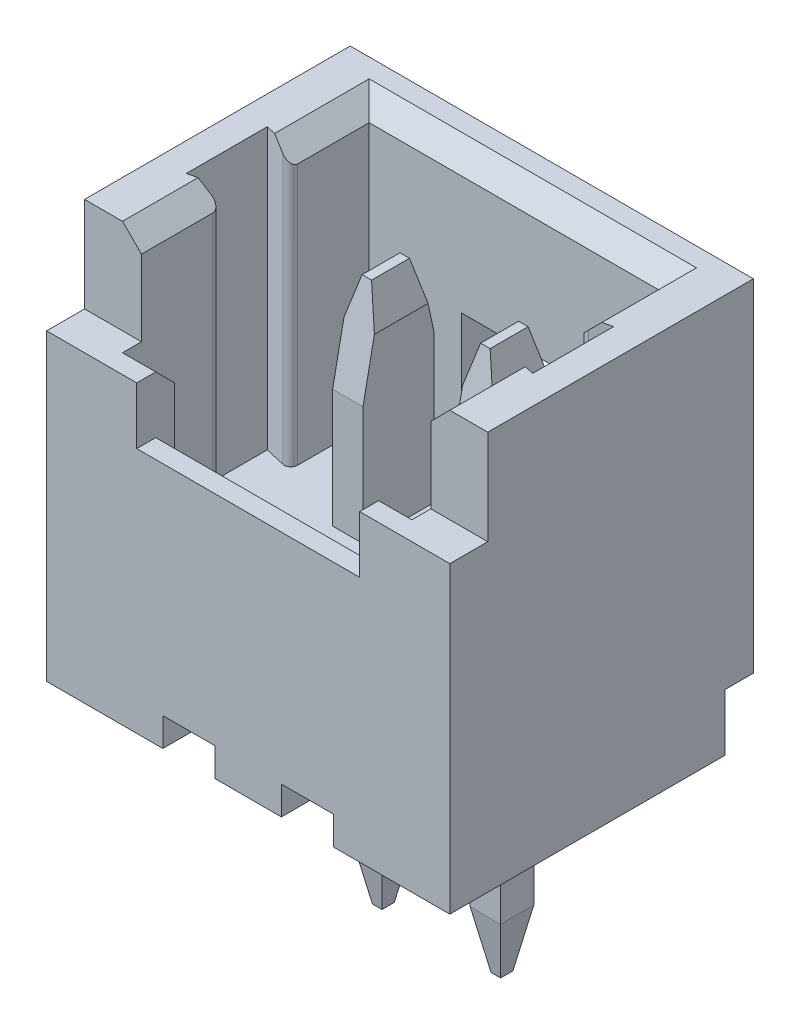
ISO-10303-21;
HEADER;
FILE_DESCRIPTION(('STEP AP214'),'2;1');
FILE_NAME('part.step','',(''),(''),'','','');
FILE_SCHEMA(('AUTOMOTIVE_DESIGN { 1 0 10303 214 1 1 1 1 }'));
ENDSEC;
DATA;
#1=APPLICATION_CONTEXT('core data for automotive mechanical design processes');
#2=APPLICATION_PROTOCOL_DEFINITION('international standard','automotive_design',2000,#1);
#3=PRODUCT_CONTEXT('',#1,'mechanical');
#4=PRODUCT('Part','Part','',(#3));
#5=PRODUCT_RELATED_PRODUCT_CATEGORY('part','',(#4));
#6=PRODUCT_DEFINITION_FORMATION('','',#4);
#7=PRODUCT_DEFINITION_CONTEXT('part definition',#1,'design');
#8=PRODUCT_DEFINITION('design','',#6,#7);
#9=PRODUCT_DEFINITION_SHAPE('','',#8);
#10=(LENGTH_UNIT() NAMED_UNIT(*) SI_UNIT(.MILLI.,.METRE.));
#11=(NAMED_UNIT(*) PLANE_ANGLE_UNIT() SI_UNIT($,.RADIAN.));
#12=(NAMED_UNIT(*) SI_UNIT($,.STERADIAN.) SOLID_ANGLE_UNIT());
#13=UNCERTAINTY_MEASURE_WITH_UNIT(LENGTH_MEASURE(1.E-05),#10,'distance_accuracy_value','');
#14=(GEOMETRIC_REPRESENTATION_CONTEXT(3) GLOBAL_UNCERTAINTY_ASSIGNED_CONTEXT((#13)) GLOBAL_UNIT_ASSIGNED_CONTEXT((#10,
#11,#12)) REPRESENTATION_CONTEXT('',''));
#15=CARTESIAN_POINT('',(0.,0.,0.));
#16=DIRECTION('',(0.,0.,1.));
#17=DIRECTION('',(1.,0.,0.));
#18=AXIS2_PLACEMENT_3D('',#15,#16,#17);
#19=CARTESIAN_POINT('',(-1.55,-2.625,-1.6));
#20=DIRECTION('',(1.,0.,0.));
#21=DIRECTION('',(0.,1.,0.));
#22=AXIS2_PLACEMENT_3D('',#19,#20,#21);
#23=PLANE('',#22);
#24=DIRECTION('',(0.,-1.,0.));
#25=VECTOR('',#24,1.);
#26=CARTESIAN_POINT('',(-1.55,-2.625,-1.3));
#27=LINE('',#26,#25);
#28=CARTESIAN_POINT('',(-1.55,-2.625,-1.3));
#29=VERTEX_POINT('',#28);
#30=CARTESIAN_POINT('',(-1.55,-3.225,-1.3));
#31=VERTEX_POINT('',#30);
#32=EDGE_CURVE('E818',#29,#31,#27,.T.);
#33=ORIENTED_EDGE('',*,*,#32,.F.);
#34=DIRECTION('',(0.,0.,1.));
#35=VECTOR('',#34,1.);
#36=CARTESIAN_POINT('',(-1.55,-2.625,-1.6));
#37=LINE('',#36,#35);
#38=CARTESIAN_POINT('',(-1.55,-2.625,-1.6));
#39=VERTEX_POINT('',#38);
#40=EDGE_CURVE('E11',#39,#29,#37,.T.);
#41=ORIENTED_EDGE('',*,*,#40,.F.);
#42=DIRECTION('',(0.,1.,0.));
#43=VECTOR('',#42,1.);
#44=CARTESIAN_POINT('',(-1.55,-3.225,-1.6));
#45=LINE('',#44,#43);
#46=CARTESIAN_POINT('',(-1.55,-3.225,-1.6));
#47=VERTEX_POINT('',#46);
#48=EDGE_CURVE('E1081',#47,#39,#45,.T.);
#49=ORIENTED_EDGE('',*,*,#48,.F.);
#50=DIRECTION('',(0.,0.,1.));
#51=VECTOR('',#50,1.);
#52=CARTESIAN_POINT('',(-1.55,-3.225,-1.6));
#53=LINE('',#52,#51);
#54=EDGE_CURVE('E939',#47,#31,#53,.T.);
#55=ORIENTED_EDGE('',*,*,#54,.T.);
#56=EDGE_LOOP('',(#33,#41,#49,#55));
#57=FACE_BOUND('',#56,.T.);
#58=ADVANCED_FACE('F17',(#57),#23,.F.);
#59=CARTESIAN_POINT('',(-2.125,-2.625,-1.6));
#60=DIRECTION('',(0.,1.,0.));
#61=DIRECTION('',(1.,0.,0.));
#62=AXIS2_PLACEMENT_3D('',#59,#60,#61);
#63=PLANE('',#62);
#64=DIRECTION('',(1.,0.,0.));
#65=VECTOR('',#64,1.);
#66=CARTESIAN_POINT('',(-2.125,-2.625,-1.6));
#67=LINE('',#66,#65);
#68=CARTESIAN_POINT('',(-2.125,-2.625,-1.6));
#69=VERTEX_POINT('',#68);
#70=EDGE_CURVE('E1002',#69,#39,#67,.T.);
#71=ORIENTED_EDGE('',*,*,#70,.T.);
#72=ORIENTED_EDGE('',*,*,#40,.T.);
#73=DIRECTION('',(1.,0.,0.));
#74=VECTOR('',#73,1.);
#75=CARTESIAN_POINT('',(-2.125,-2.625,-1.3));
#76=LINE('',#75,#74);
#77=CARTESIAN_POINT('',(-2.125,-2.625,-1.3));
#78=VERTEX_POINT('',#77);
#79=EDGE_CURVE('E838',#78,#29,#76,.T.);
#80=ORIENTED_EDGE('',*,*,#79,.F.);
#81=DIRECTION('',(0.,0.,1.));
#82=VECTOR('',#81,1.);
#83=CARTESIAN_POINT('',(-2.125,-2.625,-1.6));
#84=LINE('',#83,#82);
#85=EDGE_CURVE('E807',#69,#78,#84,.T.);
#86=ORIENTED_EDGE('',*,*,#85,.F.);
#87=EDGE_LOOP('',(#71,#72,#80,#86));
#88=FACE_BOUND('',#87,.T.);
#89=ADVANCED_FACE('F1765',(#88),#63,.F.);
#90=CARTESIAN_POINT('',(-0.625,-0.85,-0.075));
#91=DIRECTION('',(0.,0.,1.));
#92=DIRECTION('',(1.,0.,0.));
#93=AXIS2_PLACEMENT_3D('',#90,#91,#92);
#94=PLANE('',#93);
#95=DIRECTION('',(0.,1.,0.));
#96=VECTOR('',#95,1.);
#97=CARTESIAN_POINT('',(-0.785,-1.975,-0.075));
#98=LINE('',#97,#96);
#99=CARTESIAN_POINT('',(-0.785,-1.975,-0.075));
#100=VERTEX_POINT('',#99);
#101=CARTESIAN_POINT('',(-0.785,-0.725,-0.075));
#102=VERTEX_POINT('',#101);
#103=EDGE_CURVE('E1581',#100,#102,#98,.T.);
#104=ORIENTED_EDGE('',*,*,#103,.F.);
#105=DIRECTION('',(1.,0.,0.));
#106=VECTOR('',#105,1.);
#107=CARTESIAN_POINT('',(-0.785,-1.975,-0.075));
#108=LINE('',#107,#106);
#109=CARTESIAN_POINT('',(-0.465,-1.975,-0.075));
#110=VERTEX_POINT('',#109);
#111=EDGE_CURVE('E1321',#100,#110,#108,.T.);
#112=ORIENTED_EDGE('',*,*,#111,.T.);
#113=DIRECTION('',(0.,1.,0.));
#114=VECTOR('',#113,1.);
#115=CARTESIAN_POINT('',(-0.465,-1.975,-0.075));
#116=LINE('',#115,#114);
#117=CARTESIAN_POINT('',(-0.465,-0.725,-0.075));
#118=VERTEX_POINT('',#117);
#119=EDGE_CURVE('E1667',#110,#118,#116,.T.);
#120=ORIENTED_EDGE('',*,*,#119,.T.);
#121=DIRECTION('',(1.,0.,0.));
#122=VECTOR('',#121,1.);
#123=CARTESIAN_POINT('',(-0.785,-0.725,-0.075));
#124=LINE('',#123,#122);
#125=EDGE_CURVE('E1694',#102,#118,#124,.T.);
#126=ORIENTED_EDGE('',*,*,#125,.F.);
#127=EDGE_LOOP('',(#104,#112,#120,#126));
#128=FACE_BOUND('',#127,.T.);
#129=ADVANCED_FACE('F1761',(#128),#94,.T.);
#130=CARTESIAN_POINT('',(-2.125,0.275,-1.6));
#131=DIRECTION('',(0.,1.,0.));
#132=DIRECTION('',(1.,0.,0.));
#133=AXIS2_PLACEMENT_3D('',#130,#131,#132);
#134=PLANE('',#133);
#135=DIRECTION('',(-1.,0.,0.));
#136=VECTOR('',#135,1.);
#137=CARTESIAN_POINT('',(-0.575,0.275,-0.675));
#138=LINE('',#137,#136);
#139=CARTESIAN_POINT('',(-0.575,0.275,-0.675));
#140=VERTEX_POINT('',#139);
#141=CARTESIAN_POINT('',(-0.675,0.275,-0.675));
#142=VERTEX_POINT('',#141);
#143=EDGE_CURVE('E40',#140,#142,#138,.T.);
#144=ORIENTED_EDGE('',*,*,#143,.T.);
#145=DIRECTION('',(0.,0.,1.));
#146=VECTOR('',#145,1.);
#147=CARTESIAN_POINT('',(-0.675,0.275,-0.675));
#148=LINE('',#147,#146);
#149=CARTESIAN_POINT('',(-0.675,0.275,-0.275));
#150=VERTEX_POINT('',#149);
#151=EDGE_CURVE('E47',#142,#150,#148,.T.);
#152=ORIENTED_EDGE('',*,*,#151,.T.);
#153=DIRECTION('',(1.,0.,0.));
#154=VECTOR('',#153,1.);
#155=CARTESIAN_POINT('',(-0.675,0.275,-0.275));
#156=LINE('',#155,#154);
#157=CARTESIAN_POINT('',(-0.575,0.275,-0.275));
#158=VERTEX_POINT('',#157);
#159=EDGE_CURVE('E928',#150,#158,#156,.T.);
#160=ORIENTED_EDGE('',*,*,#159,.T.);
#161=DIRECTION('',(0.,0.,-1.));
#162=VECTOR('',#161,1.);
#163=CARTESIAN_POINT('',(-0.575,0.275,-0.275));
#164=LINE('',#163,#162);
#165=EDGE_CURVE('E1687',#158,#140,#164,.T.);
#166=ORIENTED_EDGE('',*,*,#165,.T.);
#167=EDGE_LOOP('',(#144,#152,#160,#166));
#168=FACE_BOUND('',#167,.T.);
#169=ADVANCED_FACE('F1764',(#168),#134,.T.);
#170=CARTESIAN_POINT('',(-0.625,-0.85,-0.825));
#171=DIRECTION('',(0.,0.,-1.));
#172=DIRECTION('',(0.,-1.,0.));
#173=AXIS2_PLACEMENT_3D('',#170,#171,#172);
#174=PLANE('',#173);
#175=DIRECTION('',(0.,1.,0.));
#176=VECTOR('',#175,1.);
#177=CARTESIAN_POINT('',(-0.465,-1.975,-0.825));
#178=LINE('',#177,#176);
#179=CARTESIAN_POINT('',(-0.465,-1.975,-0.825));
#180=VERTEX_POINT('',#179);
#181=CARTESIAN_POINT('',(-0.465,-0.425,-0.825));
#182=VERTEX_POINT('',#181);
#183=EDGE_CURVE('E1671',#180,#182,#178,.T.);
#184=ORIENTED_EDGE('',*,*,#183,.F.);
#185=DIRECTION('',(-1.,0.,0.));
#186=VECTOR('',#185,1.);
#187=CARTESIAN_POINT('',(-0.465,-1.975,-0.825));
#188=LINE('',#187,#186);
#189=CARTESIAN_POINT('',(-0.785,-1.975,-0.825));
#190=VERTEX_POINT('',#189);
#191=EDGE_CURVE('E1147',#180,#190,#188,.T.);
#192=ORIENTED_EDGE('',*,*,#191,.T.);
#193=DIRECTION('',(0.,1.,0.));
#194=VECTOR('',#193,1.);
#195=CARTESIAN_POINT('',(-0.785,-1.975,-0.825));
#196=LINE('',#195,#194);
#197=CARTESIAN_POINT('',(-0.785,-0.425,-0.825));
#198=VERTEX_POINT('',#197);
#199=EDGE_CURVE('E1577',#190,#198,#196,.T.);
#200=ORIENTED_EDGE('',*,*,#199,.T.);
#201=DIRECTION('',(-1.,0.,0.));
#202=VECTOR('',#201,1.);
#203=CARTESIAN_POINT('',(-0.465,-0.425,-0.825));
#204=LINE('',#203,#202);
#205=EDGE_CURVE('E27',#182,#198,#204,.T.);
#206=ORIENTED_EDGE('',*,*,#205,.F.);
#207=EDGE_LOOP('',(#184,#192,#200,#206));
#208=FACE_BOUND('',#207,.T.);
#209=ADVANCED_FACE('F1829',(#208),#174,.T.);
#210=CARTESIAN_POINT('',(-0.625,-0.075,-0.75));
#211=DIRECTION('',(0.,0.209529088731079,-0.977802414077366));
#212=DIRECTION('',(-1.,0.,0.));
#213=AXIS2_PLACEMENT_3D('',#210,#211,#212);
#214=PLANE('',#213);
#215=ORIENTED_EDGE('',*,*,#143,.F.);
#216=DIRECTION('',(-0.259671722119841,0.94426080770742,0.202341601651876));
#217=VECTOR('',#216,1.);
#218=CARTESIAN_POINT('',(-0.465,-0.125,-0.760714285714));
#219=LINE('',#218,#217);
#220=CARTESIAN_POINT('',(-0.465,-0.125,-0.760714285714));
#221=VERTEX_POINT('',#220);
#222=EDGE_CURVE('E1683',#221,#140,#219,.T.);
#223=ORIENTED_EDGE('',*,*,#222,.F.);
#224=DIRECTION('',(0.,0.977802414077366,0.209529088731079));
#225=VECTOR('',#224,1.);
#226=CARTESIAN_POINT('',(-0.465,-0.425,-0.825));
#227=LINE('',#226,#225);
#228=EDGE_CURVE('E1675',#182,#221,#227,.T.);
#229=ORIENTED_EDGE('',*,*,#228,.F.);
#230=ORIENTED_EDGE('',*,*,#205,.T.);
#231=DIRECTION('',(0.,-0.977802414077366,-0.209529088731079));
#232=VECTOR('',#231,1.);
#233=CARTESIAN_POINT('',(-0.785,-0.125,-0.760714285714));
#234=LINE('',#233,#232);
#235=CARTESIAN_POINT('',(-0.785,-0.125,-0.760714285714));
#236=VERTEX_POINT('',#235);
#237=EDGE_CURVE('E1186',#236,#198,#234,.T.);
#238=ORIENTED_EDGE('',*,*,#237,.F.);
#239=DIRECTION('',(0.259671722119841,0.94426080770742,0.202341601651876));
#240=VECTOR('',#239,1.);
#241=CARTESIAN_POINT('',(-0.785,-0.125,-0.760714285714));
#242=LINE('',#241,#240);
#243=EDGE_CURVE('E1701',#236,#142,#242,.T.);
#244=ORIENTED_EDGE('',*,*,#243,.T.);
#245=EDGE_LOOP('',(#215,#223,#229,#230,#238,#244));
#246=FACE_BOUND('',#245,.T.);
#247=ADVANCED_FACE('F19',(#246),#214,.T.);
#248=CARTESIAN_POINT('',(-0.73,0.075,-0.45));
#249=DIRECTION('',(-0.964205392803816,0.26515648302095,0.));
#250=DIRECTION('',(0.,0.,1.));
#251=AXIS2_PLACEMENT_3D('',#248,#249,#250);
#252=PLANE('',#251);
#253=ORIENTED_EDGE('',*,*,#151,.F.);
#254=ORIENTED_EDGE('',*,*,#243,.F.);
#255=DIRECTION('',(0.,0.,1.));
#256=VECTOR('',#255,1.);
#257=CARTESIAN_POINT('',(-0.785,-0.125,-0.760714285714));
#258=LINE('',#257,#256);
#259=CARTESIAN_POINT('',(-0.785,-0.125,-0.195));
#260=VERTEX_POINT('',#259);
#261=EDGE_CURVE('E1190',#236,#260,#258,.T.);
#262=ORIENTED_EDGE('',*,*,#261,.T.);
#263=DIRECTION('',(0.260359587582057,0.946762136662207,-0.189352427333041));
#264=VECTOR('',#263,1.);
#265=CARTESIAN_POINT('',(-0.785,-0.125,-0.195));
#266=LINE('',#265,#264);
#267=EDGE_CURVE('E925',#260,#150,#266,.T.);
#268=ORIENTED_EDGE('',*,*,#267,.T.);
#269=EDGE_LOOP('',(#253,#254,#262,#268));
#270=FACE_BOUND('',#269,.T.);
#271=ADVANCED_FACE('F2335',(#270),#252,.T.);
#272=CARTESIAN_POINT('',(-0.625,-0.225,-0.175));
#273=DIRECTION('',(0.,0.196116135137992,0.980580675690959));
#274=DIRECTION('',(1.,0.,0.));
#275=AXIS2_PLACEMENT_3D('',#272,#273,#274);
#276=PLANE('',#275);
#277=DIRECTION('',(0.,0.980580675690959,-0.196116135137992));
#278=VECTOR('',#277,1.);
#279=CARTESIAN_POINT('',(-0.785,-0.725,-0.075));
#280=LINE('',#279,#278);
#281=EDGE_CURVE('E1585',#102,#260,#280,.T.);
#282=ORIENTED_EDGE('',*,*,#281,.F.);
#283=ORIENTED_EDGE('',*,*,#125,.T.);
#284=DIRECTION('',(0.,-0.980580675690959,0.196116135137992));
#285=VECTOR('',#284,1.);
#286=CARTESIAN_POINT('',(-0.465,-0.125,-0.195));
#287=LINE('',#286,#285);
#288=CARTESIAN_POINT('',(-0.465,-0.125,-0.195));
#289=VERTEX_POINT('',#288);
#290=EDGE_CURVE('E1663',#289,#118,#287,.T.);
#291=ORIENTED_EDGE('',*,*,#290,.F.);
#292=DIRECTION('',(-0.260359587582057,0.946762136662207,-0.189352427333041));
#293=VECTOR('',#292,1.);
#294=CARTESIAN_POINT('',(-0.465,-0.125,-0.195));
#295=LINE('',#294,#293);
#296=EDGE_CURVE('E1690',#289,#158,#295,.T.);
#297=ORIENTED_EDGE('',*,*,#296,.T.);
#298=ORIENTED_EDGE('',*,*,#159,.F.);
#299=ORIENTED_EDGE('',*,*,#267,.F.);
#300=EDGE_LOOP('',(#282,#283,#291,#297,#298,#299));
#301=FACE_BOUND('',#300,.T.);
#302=ADVANCED_FACE('F1917',(#301),#276,.T.);
#303=CARTESIAN_POINT('',(-0.52,0.075,-0.45));
#304=DIRECTION('',(0.964205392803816,0.26515648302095,0.));
#305=DIRECTION('',(0.,0.,-1.));
#306=AXIS2_PLACEMENT_3D('',#303,#304,#305);
#307=PLANE('',#306);
#308=DIRECTION('',(0.,0.,-1.));
#309=VECTOR('',#308,1.);
#310=CARTESIAN_POINT('',(-0.465,-0.125,-0.195));
#311=LINE('',#310,#309);
#312=EDGE_CURVE('E1679',#289,#221,#311,.T.);
#313=ORIENTED_EDGE('',*,*,#312,.T.);
#314=ORIENTED_EDGE('',*,*,#222,.T.);
#315=ORIENTED_EDGE('',*,*,#165,.F.);
#316=ORIENTED_EDGE('',*,*,#296,.F.);
#317=EDGE_LOOP('',(#313,#314,#315,#316));
#318=FACE_BOUND('',#317,.T.);
#319=ADVANCED_FACE('F1913',(#318),#307,.T.);
#320=CARTESIAN_POINT('',(-0.465,-4.3,-0.45));
#321=DIRECTION('',(1.,0.,0.));
#322=DIRECTION('',(0.,1.,0.));
#323=AXIS2_PLACEMENT_3D('',#320,#321,#322);
#324=PLANE('',#323);
#325=ORIENTED_EDGE('',*,*,#290,.T.);
#326=ORIENTED_EDGE('',*,*,#119,.F.);
#327=DIRECTION('',(0.,0.,-1.));
#328=VECTOR('',#327,1.);
#329=CARTESIAN_POINT('',(-0.465,-1.975,-0.075));
#330=LINE('',#329,#328);
#331=EDGE_CURVE('E1317',#110,#180,#330,.T.);
#332=ORIENTED_EDGE('',*,*,#331,.T.);
#333=ORIENTED_EDGE('',*,*,#183,.T.);
#334=ORIENTED_EDGE('',*,*,#228,.T.);
#335=ORIENTED_EDGE('',*,*,#312,.F.);
#336=EDGE_LOOP('',(#325,#326,#332,#333,#334,#335));
#337=FACE_BOUND('',#336,.T.);
#338=ADVANCED_FACE('F1916',(#337),#324,.T.);
#339=CARTESIAN_POINT('',(-0.465,-4.3,-0.45));
#340=DIRECTION('',(1.,0.,0.));
#341=DIRECTION('',(0.,1.,0.));
#342=AXIS2_PLACEMENT_3D('',#339,#340,#341);
#343=PLANE('',#342);
#344=DIRECTION('',(0.,1.,0.));
#345=VECTOR('',#344,1.);
#346=CARTESIAN_POINT('',(-0.465,-4.925,-0.625));
#347=LINE('',#346,#345);
#348=CARTESIAN_POINT('',(-0.465,-4.925,-0.625));
#349=VERTEX_POINT('',#348);
#350=CARTESIAN_POINT('',(-0.465,-3.125,-0.625));
#351=VERTEX_POINT('',#350);
#352=EDGE_CURVE('E1642',#349,#351,#347,.T.);
#353=ORIENTED_EDGE('',*,*,#352,.T.);
#354=DIRECTION('',(0.,0.,-1.));
#355=VECTOR('',#354,1.);
#356=CARTESIAN_POINT('',(-0.465,-3.125,-0.275));
#357=LINE('',#356,#355);
#358=CARTESIAN_POINT('',(-0.465,-3.125,-0.275));
#359=VERTEX_POINT('',#358);
#360=EDGE_CURVE('E1622',#359,#351,#357,.T.);
#361=ORIENTED_EDGE('',*,*,#360,.F.);
#362=DIRECTION('',(0.,1.,0.));
#363=VECTOR('',#362,1.);
#364=CARTESIAN_POINT('',(-0.465,-4.925,-0.275));
#365=LINE('',#364,#363);
#366=CARTESIAN_POINT('',(-0.465,-4.925,-0.275));
#367=VERTEX_POINT('',#366);
#368=EDGE_CURVE('E1608',#367,#359,#365,.T.);
#369=ORIENTED_EDGE('',*,*,#368,.F.);
#370=DIRECTION('',(0.,0.,1.));
#371=VECTOR('',#370,1.);
#372=CARTESIAN_POINT('',(-0.465,-4.925,-0.625));
#373=LINE('',#372,#371);
#374=EDGE_CURVE('E1660',#349,#367,#373,.T.);
#375=ORIENTED_EDGE('',*,*,#374,.F.);
#376=EDGE_LOOP('',(#353,#361,#369,#375));
#377=FACE_BOUND('',#376,.T.);
#378=ADVANCED_FACE('F2407',(#377),#343,.T.);
#379=CARTESIAN_POINT('',(-0.52,-5.225,-0.45));
#380=DIRECTION('',(0.983606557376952,-0.180327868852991,0.));
#381=DIRECTION('',(0.,0.,-1.));
#382=AXIS2_PLACEMENT_3D('',#379,#380,#381);
#383=PLANE('',#382);
#384=DIRECTION('',(0.,0.,1.));
#385=VECTOR('',#384,1.);
#386=CARTESIAN_POINT('',(-0.575,-5.525,-0.515));
#387=LINE('',#386,#385);
#388=CARTESIAN_POINT('',(-0.575,-5.525,-0.515));
#389=VERTEX_POINT('',#388);
#390=CARTESIAN_POINT('',(-0.575,-5.525,-0.385));
#391=VERTEX_POINT('',#390);
#392=EDGE_CURVE('E1657',#389,#391,#387,.T.);
#393=ORIENTED_EDGE('',*,*,#392,.F.);
#394=DIRECTION('',(-0.177465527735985,-0.967993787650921,0.177465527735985));
#395=VECTOR('',#394,1.);
#396=CARTESIAN_POINT('',(-0.465,-4.925,-0.625));
#397=LINE('',#396,#395);
#398=EDGE_CURVE('E1649',#349,#389,#397,.T.);
#399=ORIENTED_EDGE('',*,*,#398,.F.);
#400=ORIENTED_EDGE('',*,*,#374,.T.);
#401=DIRECTION('',(-0.177465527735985,-0.967993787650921,-0.177465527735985));
#402=VECTOR('',#401,1.);
#403=CARTESIAN_POINT('',(-0.465,-4.925,-0.275));
#404=LINE('',#403,#402);
#405=EDGE_CURVE('E1601',#367,#391,#404,.T.);
#406=ORIENTED_EDGE('',*,*,#405,.T.);
#407=EDGE_LOOP('',(#393,#399,#400,#406));
#408=FACE_BOUND('',#407,.T.);
#409=ADVANCED_FACE('F2411',(#408),#383,.T.);
#410=CARTESIAN_POINT('',(-2.125,-5.525,-1.6));
#411=DIRECTION('',(0.,1.,0.));
#412=DIRECTION('',(1.,0.,0.));
#413=AXIS2_PLACEMENT_3D('',#410,#411,#412);
#414=PLANE('',#413);
#415=ORIENTED_EDGE('',*,*,#392,.T.);
#416=DIRECTION('',(-1.,0.,0.));
#417=VECTOR('',#416,1.);
#418=CARTESIAN_POINT('',(-0.575,-5.525,-0.385));
#419=LINE('',#418,#417);
#420=CARTESIAN_POINT('',(-0.675,-5.525,-0.385));
#421=VERTEX_POINT('',#420);
#422=EDGE_CURVE('E1598',#391,#421,#419,.T.);
#423=ORIENTED_EDGE('',*,*,#422,.T.);
#424=DIRECTION('',(0.,0.,-1.));
#425=VECTOR('',#424,1.);
#426=CARTESIAN_POINT('',(-0.675,-5.525,-0.385));
#427=LINE('',#426,#425);
#428=CARTESIAN_POINT('',(-0.675,-5.525,-0.515));
#429=VERTEX_POINT('',#428);
#430=EDGE_CURVE('E1153',#421,#429,#427,.T.);
#431=ORIENTED_EDGE('',*,*,#430,.T.);
#432=DIRECTION('',(1.,0.,0.));
#433=VECTOR('',#432,1.);
#434=CARTESIAN_POINT('',(-0.675,-5.525,-0.515));
#435=LINE('',#434,#433);
#436=EDGE_CURVE('E1653',#429,#389,#435,.T.);
#437=ORIENTED_EDGE('',*,*,#436,.T.);
#438=EDGE_LOOP('',(#415,#423,#431,#437));
#439=FACE_BOUND('',#438,.T.);
#440=ADVANCED_FACE('F2802',(#439),#414,.F.);
#441=CARTESIAN_POINT('',(-0.625,-5.225,-0.57));
#442=DIRECTION('',(0.,-0.180327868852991,-0.983606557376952));
#443=DIRECTION('',(0.,-0.983606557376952,0.180327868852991));
#444=AXIS2_PLACEMENT_3D('',#441,#442,#443);
#445=PLANE('',#444);
#446=DIRECTION('',(1.,0.,0.));
#447=VECTOR('',#446,1.);
#448=CARTESIAN_POINT('',(-0.785,-4.925,-0.625));
#449=LINE('',#448,#447);
#450=CARTESIAN_POINT('',(-0.785,-4.925,-0.625));
#451=VERTEX_POINT('',#450);
#452=EDGE_CURVE('E1645',#451,#349,#449,.T.);
#453=ORIENTED_EDGE('',*,*,#452,.T.);
#454=ORIENTED_EDGE('',*,*,#398,.T.);
#455=ORIENTED_EDGE('',*,*,#436,.F.);
#456=DIRECTION('',(0.177465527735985,-0.967993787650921,0.177465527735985));
#457=VECTOR('',#456,1.);
#458=CARTESIAN_POINT('',(-0.785,-4.925,-0.625));
#459=LINE('',#458,#457);
#460=EDGE_CURVE('E1158',#451,#429,#459,.T.);
#461=ORIENTED_EDGE('',*,*,#460,.F.);
#462=EDGE_LOOP('',(#453,#454,#455,#461));
#463=FACE_BOUND('',#462,.T.);
#464=ADVANCED_FACE('F2395',(#463),#445,.T.);
#465=CARTESIAN_POINT('',(-0.625,-4.3,-0.625));
#466=DIRECTION('',(0.,0.,-1.));
#467=DIRECTION('',(0.,-1.,0.));
#468=AXIS2_PLACEMENT_3D('',#465,#466,#467);
#469=PLANE('',#468);
#470=DIRECTION('',(0.,1.,0.));
#471=VECTOR('',#470,1.);
#472=CARTESIAN_POINT('',(-0.785,-4.925,-0.625));
#473=LINE('',#472,#471);
#474=CARTESIAN_POINT('',(-0.785,-3.125,-0.625));
#475=VERTEX_POINT('',#474);
#476=EDGE_CURVE('E843',#451,#475,#473,.T.);
#477=ORIENTED_EDGE('',*,*,#476,.T.);
#478=DIRECTION('',(-1.,0.,0.));
#479=VECTOR('',#478,1.);
#480=CARTESIAN_POINT('',(-0.465,-3.125,-0.625));
#481=LINE('',#480,#479);
#482=EDGE_CURVE('E1626',#351,#475,#481,.T.);
#483=ORIENTED_EDGE('',*,*,#482,.F.);
#484=ORIENTED_EDGE('',*,*,#352,.F.);
#485=ORIENTED_EDGE('',*,*,#452,.F.);
#486=EDGE_LOOP('',(#477,#483,#484,#485));
#487=FACE_BOUND('',#486,.T.);
#488=ADVANCED_FACE('F2315',(#487),#469,.T.);
#489=CARTESIAN_POINT('',(-0.35,-3.125,0.4));
#490=DIRECTION('',(0.,0.,-1.));
#491=DIRECTION('',(0.,-1.,0.));
#492=AXIS2_PLACEMENT_3D('',#489,#490,#491);
#493=PLANE('',#492);
#494=DIRECTION('',(-1.,0.,0.));
#495=VECTOR('',#494,1.);
#496=CARTESIAN_POINT('',(-0.35,-2.925,0.4));
#497=LINE('',#496,#495);
#498=CARTESIAN_POINT('',(-0.35,-2.925,0.4));
#499=VERTEX_POINT('',#498);
#500=CARTESIAN_POINT('',(-0.9,-2.925,0.4));
#501=VERTEX_POINT('',#500);
#502=EDGE_CURVE('E1639',#499,#501,#497,.T.);
#503=ORIENTED_EDGE('',*,*,#502,.T.);
#504=DIRECTION('',(0.,1.,0.));
#505=VECTOR('',#504,1.);
#506=CARTESIAN_POINT('',(-0.9,-3.125,0.4));
#507=LINE('',#506,#505);
#508=CARTESIAN_POINT('',(-0.9,-3.125,0.4));
#509=VERTEX_POINT('',#508);
#510=EDGE_CURVE('E1632',#509,#501,#507,.T.);
#511=ORIENTED_EDGE('',*,*,#510,.F.);
#512=DIRECTION('',(-1.,0.,0.));
#513=VECTOR('',#512,1.);
#514=CARTESIAN_POINT('',(-0.35,-3.125,0.4));
#515=LINE('',#514,#513);
#516=CARTESIAN_POINT('',(-0.35,-3.125,0.4));
#517=VERTEX_POINT('',#516);
#518=EDGE_CURVE('E1240',#517,#509,#515,.T.);
#519=ORIENTED_EDGE('',*,*,#518,.F.);
#520=DIRECTION('',(0.,1.,0.));
#521=VECTOR('',#520,1.);
#522=CARTESIAN_POINT('',(-0.35,-3.125,0.4));
#523=LINE('',#522,#521);
#524=EDGE_CURVE('E1015',#517,#499,#523,.T.);
#525=ORIENTED_EDGE('',*,*,#524,.T.);
#526=EDGE_LOOP('',(#503,#511,#519,#525));
#527=FACE_BOUND('',#526,.T.);
#528=ADVANCED_FACE('F1746',(#527),#493,.F.);
#529=CARTESIAN_POINT('',(-0.35,-2.925,0.4));
#530=DIRECTION('',(0.,1.,0.));
#531=DIRECTION('',(1.,0.,0.));
#532=AXIS2_PLACEMENT_3D('',#529,#530,#531);
#533=PLANE('',#532);
#534=DIRECTION('',(1.,0.,0.));
#535=VECTOR('',#534,1.);
#536=CARTESIAN_POINT('',(-0.9,-2.925,1.6));
#537=LINE('',#536,#535);
#538=CARTESIAN_POINT('',(-0.9,-2.925,1.6));
#539=VERTEX_POINT('',#538);
#540=CARTESIAN_POINT('',(-0.35,-2.925,1.6));
#541=VERTEX_POINT('',#540);
#542=EDGE_CURVE('E1098',#539,#541,#537,.T.);
#543=ORIENTED_EDGE('',*,*,#542,.F.);
#544=DIRECTION('',(0.,0.,1.));
#545=VECTOR('',#544,1.);
#546=CARTESIAN_POINT('',(-0.9,-2.925,0.4));
#547=LINE('',#546,#545);
#548=EDGE_CURVE('E1636',#501,#539,#547,.T.);
#549=ORIENTED_EDGE('',*,*,#548,.F.);
#550=ORIENTED_EDGE('',*,*,#502,.F.);
#551=DIRECTION('',(0.,0.,1.));
#552=VECTOR('',#551,1.);
#553=CARTESIAN_POINT('',(-0.35,-2.925,0.4));
#554=LINE('',#553,#552);
#555=EDGE_CURVE('E905',#499,#541,#554,.T.);
#556=ORIENTED_EDGE('',*,*,#555,.T.);
#557=EDGE_LOOP('',(#543,#549,#550,#556));
#558=FACE_BOUND('',#557,.T.);
#559=ADVANCED_FACE('F1742',(#558),#533,.F.);
#560=CARTESIAN_POINT('',(-0.9,0.,0.));
#561=DIRECTION('',(1.,0.,0.));
#562=DIRECTION('',(0.,1.,0.));
#563=AXIS2_PLACEMENT_3D('',#560,#561,#562);
#564=PLANE('',#563);
#565=DIRECTION('',(0.,-1.,0.));
#566=VECTOR('',#565,1.);
#567=CARTESIAN_POINT('',(-0.9,-2.625,-1.3));
#568=LINE('',#567,#566);
#569=CARTESIAN_POINT('',(-0.9,-2.625,-1.3));
#570=VERTEX_POINT('',#569);
#571=CARTESIAN_POINT('',(-0.9,-3.125,-1.3));
#572=VERTEX_POINT('',#571);
#573=EDGE_CURVE('E1629',#570,#572,#568,.T.);
#574=ORIENTED_EDGE('',*,*,#573,.T.);
#575=DIRECTION('',(0.,0.,1.));
#576=VECTOR('',#575,1.);
#577=CARTESIAN_POINT('',(-0.9,-3.125,-1.3));
#578=LINE('',#577,#576);
#579=EDGE_CURVE('E1235',#572,#509,#578,.T.);
#580=ORIENTED_EDGE('',*,*,#579,.T.);
#581=ORIENTED_EDGE('',*,*,#510,.T.);
#582=ORIENTED_EDGE('',*,*,#548,.T.);
#583=DIRECTION('',(0.,1.,0.));
#584=VECTOR('',#583,1.);
#585=CARTESIAN_POINT('',(-0.9,-3.225,1.6));
#586=LINE('',#585,#584);
#587=CARTESIAN_POINT('',(-0.9,-3.225,1.6));
#588=VERTEX_POINT('',#587);
#589=EDGE_CURVE('E767',#588,#539,#586,.T.);
#590=ORIENTED_EDGE('',*,*,#589,.F.);
#591=DIRECTION('',(0.,0.,-1.));
#592=VECTOR('',#591,1.);
#593=CARTESIAN_POINT('',(-0.9,-3.225,1.6));
#594=LINE('',#593,#592);
#595=CARTESIAN_POINT('',(-0.9,-3.225,-1.6));
#596=VERTEX_POINT('',#595);
#597=EDGE_CURVE('E946',#588,#596,#594,.T.);
#598=ORIENTED_EDGE('',*,*,#597,.T.);
#599=DIRECTION('',(0.,1.,0.));
#600=VECTOR('',#599,1.);
#601=CARTESIAN_POINT('',(-0.9,-3.225,-1.6));
#602=LINE('',#601,#600);
#603=CARTESIAN_POINT('',(-0.9,-2.625,-1.6));
#604=VERTEX_POINT('',#603);
#605=EDGE_CURVE('E1139',#596,#604,#602,.T.);
#606=ORIENTED_EDGE('',*,*,#605,.T.);
#607=DIRECTION('',(0.,0.,1.));
#608=VECTOR('',#607,1.);
#609=CARTESIAN_POINT('',(-0.9,-2.625,-1.6));
#610=LINE('',#609,#608);
#611=EDGE_CURVE('E887',#604,#570,#610,.T.);
#612=ORIENTED_EDGE('',*,*,#611,.T.);
#613=EDGE_LOOP('',(#574,#580,#581,#582,#590,#598,#606,#612));
#614=FACE_BOUND('',#613,.T.);
#615=ADVANCED_FACE('F1745',(#614),#564,.T.);
#616=CARTESIAN_POINT('',(-0.35,-2.625,-1.3));
#617=DIRECTION('',(0.,0.,1.));
#618=DIRECTION('',(1.,0.,0.));
#619=AXIS2_PLACEMENT_3D('',#616,#617,#618);
#620=PLANE('',#619);
#621=DIRECTION('',(-1.,0.,0.));
#622=VECTOR('',#621,1.);
#623=CARTESIAN_POINT('',(-0.35,-3.125,-1.3));
#624=LINE('',#623,#622);
#625=CARTESIAN_POINT('',(-0.35,-3.125,-1.3));
#626=VERTEX_POINT('',#625);
#627=EDGE_CURVE('E1239',#626,#572,#624,.T.);
#628=ORIENTED_EDGE('',*,*,#627,.T.);
#629=ORIENTED_EDGE('',*,*,#573,.F.);
#630=DIRECTION('',(-1.,0.,0.));
#631=VECTOR('',#630,1.);
#632=CARTESIAN_POINT('',(-0.35,-2.625,-1.3));
#633=LINE('',#632,#631);
#634=CARTESIAN_POINT('',(-0.35,-2.625,-1.3));
#635=VERTEX_POINT('',#634);
#636=EDGE_CURVE('E883',#635,#570,#633,.T.);
#637=ORIENTED_EDGE('',*,*,#636,.F.);
#638=DIRECTION('',(0.,-1.,0.));
#639=VECTOR('',#638,1.);
#640=CARTESIAN_POINT('',(-0.35,-2.625,-1.3));
#641=LINE('',#640,#639);
#642=EDGE_CURVE('E1014',#635,#626,#641,.T.);
#643=ORIENTED_EDGE('',*,*,#642,.T.);
#644=EDGE_LOOP('',(#628,#629,#637,#643));
#645=FACE_BOUND('',#644,.T.);
#646=ADVANCED_FACE('F2575',(#645),#620,.F.);
#647=CARTESIAN_POINT('',(-0.35,-3.125,-1.3));
#648=DIRECTION('',(0.,1.,0.));
#649=DIRECTION('',(1.,0.,0.));
#650=AXIS2_PLACEMENT_3D('',#647,#648,#649);
#651=PLANE('',#650);
#652=DIRECTION('',(1.,0.,0.));
#653=VECTOR('',#652,1.);
#654=CARTESIAN_POINT('',(-0.785,-3.125,-0.275));
#655=LINE('',#654,#653);
#656=CARTESIAN_POINT('',(-0.785,-3.125,-0.275));
#657=VERTEX_POINT('',#656);
#658=EDGE_CURVE('E1612',#657,#359,#655,.T.);
#659=ORIENTED_EDGE('',*,*,#658,.T.);
#660=ORIENTED_EDGE('',*,*,#360,.T.);
#661=ORIENTED_EDGE('',*,*,#482,.T.);
#662=DIRECTION('',(0.,0.,1.));
#663=VECTOR('',#662,1.);
#664=CARTESIAN_POINT('',(-0.785,-3.125,-0.625));
#665=LINE('',#664,#663);
#666=EDGE_CURVE('E839',#475,#657,#665,.T.);
#667=ORIENTED_EDGE('',*,*,#666,.T.);
#668=EDGE_LOOP('',(#659,#660,#661,#667));
#669=FACE_BOUND('',#668,.T.);
#670=ORIENTED_EDGE('',*,*,#518,.T.);
#671=ORIENTED_EDGE('',*,*,#579,.F.);
#672=ORIENTED_EDGE('',*,*,#627,.F.);
#673=DIRECTION('',(0.,0.,1.));
#674=VECTOR('',#673,1.);
#675=CARTESIAN_POINT('',(-0.35,-3.125,-1.3));
#676=LINE('',#675,#674);
#677=EDGE_CURVE('E1010',#626,#517,#676,.T.);
#678=ORIENTED_EDGE('',*,*,#677,.T.);
#679=EDGE_LOOP('',(#670,#671,#672,#678));
#680=FACE_BOUND('',#679,.T.);
#681=ADVANCED_FACE('F2810',(#669,#680),#651,.F.);
#682=CARTESIAN_POINT('',(-0.625,-4.3,-0.275));
#683=DIRECTION('',(0.,0.,1.));
#684=DIRECTION('',(1.,0.,0.));
#685=AXIS2_PLACEMENT_3D('',#682,#683,#684);
#686=PLANE('',#685);
#687=ORIENTED_EDGE('',*,*,#368,.T.);
#688=ORIENTED_EDGE('',*,*,#658,.F.);
#689=DIRECTION('',(0.,1.,0.));
#690=VECTOR('',#689,1.);
#691=CARTESIAN_POINT('',(-0.785,-4.925,-0.275));
#692=LINE('',#691,#690);
#693=CARTESIAN_POINT('',(-0.785,-4.925,-0.275));
#694=VERTEX_POINT('',#693);
#695=EDGE_CURVE('E844',#694,#657,#692,.T.);
#696=ORIENTED_EDGE('',*,*,#695,.F.);
#697=DIRECTION('',(-1.,0.,0.));
#698=VECTOR('',#697,1.);
#699=CARTESIAN_POINT('',(-0.465,-4.925,-0.275));
#700=LINE('',#699,#698);
#701=EDGE_CURVE('E1605',#367,#694,#700,.T.);
#702=ORIENTED_EDGE('',*,*,#701,.F.);
#703=EDGE_LOOP('',(#687,#688,#696,#702));
#704=FACE_BOUND('',#703,.T.);
#705=ADVANCED_FACE('F2610',(#704),#686,.T.);
#706=CARTESIAN_POINT('',(-0.625,-5.225,-0.33));
#707=DIRECTION('',(0.,-0.180327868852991,0.983606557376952));
#708=DIRECTION('',(-1.,0.,0.));
#709=AXIS2_PLACEMENT_3D('',#706,#707,#708);
#710=PLANE('',#709);
#711=ORIENTED_EDGE('',*,*,#422,.F.);
#712=ORIENTED_EDGE('',*,*,#405,.F.);
#713=ORIENTED_EDGE('',*,*,#701,.T.);
#714=DIRECTION('',(0.177465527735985,-0.967993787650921,-0.177465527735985));
#715=VECTOR('',#714,1.);
#716=CARTESIAN_POINT('',(-0.785,-4.925,-0.275));
#717=LINE('',#716,#715);
#718=EDGE_CURVE('E1157',#694,#421,#717,.T.);
#719=ORIENTED_EDGE('',*,*,#718,.T.);
#720=EDGE_LOOP('',(#711,#712,#713,#719));
#721=FACE_BOUND('',#720,.T.);
#722=ADVANCED_FACE('F1818',(#721),#710,.T.);
#723=CARTESIAN_POINT('',(-0.73,-5.225,-0.45));
#724=DIRECTION('',(-0.983606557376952,-0.180327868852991,0.));
#725=DIRECTION('',(-0.180327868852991,0.983606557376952,0.));
#726=AXIS2_PLACEMENT_3D('',#723,#724,#725);
#727=PLANE('',#726);
#728=DIRECTION('',(0.,0.,-1.));
#729=VECTOR('',#728,1.);
#730=CARTESIAN_POINT('',(-0.785,-4.925,-0.275));
#731=LINE('',#730,#729);
#732=EDGE_CURVE('E1573',#694,#451,#731,.T.);
#733=ORIENTED_EDGE('',*,*,#732,.T.);
#734=ORIENTED_EDGE('',*,*,#460,.T.);
#735=ORIENTED_EDGE('',*,*,#430,.F.);
#736=ORIENTED_EDGE('',*,*,#718,.F.);
#737=EDGE_LOOP('',(#733,#734,#735,#736));
#738=FACE_BOUND('',#737,.T.);
#739=ADVANCED_FACE('F1983',(#738),#727,.T.);
#740=CARTESIAN_POINT('',(-0.785,-4.3,-0.45));
#741=DIRECTION('',(-1.,0.,0.));
#742=DIRECTION('',(0.,0.,1.));
#743=AXIS2_PLACEMENT_3D('',#740,#741,#742);
#744=PLANE('',#743);
#745=ORIENTED_EDGE('',*,*,#199,.F.);
#746=DIRECTION('',(0.,0.,1.));
#747=VECTOR('',#746,1.);
#748=CARTESIAN_POINT('',(-0.785,-1.975,-0.825));
#749=LINE('',#748,#747);
#750=EDGE_CURVE('E1325',#190,#100,#749,.T.);
#751=ORIENTED_EDGE('',*,*,#750,.T.);
#752=ORIENTED_EDGE('',*,*,#103,.T.);
#753=ORIENTED_EDGE('',*,*,#281,.T.);
#754=ORIENTED_EDGE('',*,*,#261,.F.);
#755=ORIENTED_EDGE('',*,*,#237,.T.);
#756=EDGE_LOOP('',(#745,#751,#752,#753,#754,#755));
#757=FACE_BOUND('',#756,.T.);
#758=ADVANCED_FACE('F1986',(#757),#744,.T.);
#759=CARTESIAN_POINT('',(-0.785,-4.3,-0.45));
#760=DIRECTION('',(-1.,0.,0.));
#761=DIRECTION('',(0.,0.,1.));
#762=AXIS2_PLACEMENT_3D('',#759,#760,#761);
#763=PLANE('',#762);
#764=ORIENTED_EDGE('',*,*,#695,.T.);
#765=ORIENTED_EDGE('',*,*,#666,.F.);
#766=ORIENTED_EDGE('',*,*,#476,.F.);
#767=ORIENTED_EDGE('',*,*,#732,.F.);
#768=EDGE_LOOP('',(#764,#765,#766,#767));
#769=FACE_BOUND('',#768,.T.);
#770=ADVANCED_FACE('F2323',(#769),#763,.T.);
#771=CARTESIAN_POINT('',(0.625,-0.85,-0.825));
#772=DIRECTION('',(0.,0.,-1.));
#773=DIRECTION('',(0.,-1.,0.));
#774=AXIS2_PLACEMENT_3D('',#771,#772,#773);
#775=PLANE('',#774);
#776=DIRECTION('',(0.,1.,0.));
#777=VECTOR('',#776,1.);
#778=CARTESIAN_POINT('',(0.785,-1.975,-0.825));
#779=LINE('',#778,#777);
#780=CARTESIAN_POINT('',(0.785,-1.975,-0.825));
#781=VERTEX_POINT('',#780);
#782=CARTESIAN_POINT('',(0.785,-0.425,-0.825));
#783=VERTEX_POINT('',#782);
#784=EDGE_CURVE('E1266',#781,#783,#779,.T.);
#785=ORIENTED_EDGE('',*,*,#784,.F.);
#786=DIRECTION('',(-1.,0.,0.));
#787=VECTOR('',#786,1.);
#788=CARTESIAN_POINT('',(0.785,-1.975,-0.825));
#789=LINE('',#788,#787);
#790=CARTESIAN_POINT('',(0.465,-1.975,-0.825));
#791=VERTEX_POINT('',#790);
#792=EDGE_CURVE('E1303',#781,#791,#789,.T.);
#793=ORIENTED_EDGE('',*,*,#792,.T.);
#794=DIRECTION('',(0.,1.,0.));
#795=VECTOR('',#794,1.);
#796=CARTESIAN_POINT('',(0.465,-1.975,-0.825));
#797=LINE('',#796,#795);
#798=CARTESIAN_POINT('',(0.465,-0.425,-0.825));
#799=VERTEX_POINT('',#798);
#800=EDGE_CURVE('E1444',#791,#799,#797,.T.);
#801=ORIENTED_EDGE('',*,*,#800,.T.);
#802=DIRECTION('',(-1.,0.,0.));
#803=VECTOR('',#802,1.);
#804=CARTESIAN_POINT('',(0.785,-0.425,-0.825));
#805=LINE('',#804,#803);
#806=EDGE_CURVE('E1459',#783,#799,#805,.T.);
#807=ORIENTED_EDGE('',*,*,#806,.F.);
#808=EDGE_LOOP('',(#785,#793,#801,#807));
#809=FACE_BOUND('',#808,.T.);
#810=ADVANCED_FACE('F1852',(#809),#775,.T.);
#811=CARTESIAN_POINT('',(-2.125,0.275,-1.6));
#812=DIRECTION('',(0.,1.,0.));
#813=DIRECTION('',(1.,0.,0.));
#814=AXIS2_PLACEMENT_3D('',#811,#812,#813);
#815=PLANE('',#814);
#816=DIRECTION('',(-1.,0.,0.));
#817=VECTOR('',#816,1.);
#818=CARTESIAN_POINT('',(0.675,0.275,-0.675));
#819=LINE('',#818,#817);
#820=CARTESIAN_POINT('',(0.675,0.275,-0.675));
#821=VERTEX_POINT('',#820);
#822=CARTESIAN_POINT('',(0.575,0.275,-0.675));
#823=VERTEX_POINT('',#822);
#824=EDGE_CURVE('E1564',#821,#823,#819,.T.);
#825=ORIENTED_EDGE('',*,*,#824,.T.);
#826=DIRECTION('',(0.,0.,1.));
#827=VECTOR('',#826,1.);
#828=CARTESIAN_POINT('',(0.575,0.275,-0.675));
#829=LINE('',#828,#827);
#830=CARTESIAN_POINT('',(0.575,0.275,-0.275));
#831=VERTEX_POINT('',#830);
#832=EDGE_CURVE('E1460',#823,#831,#829,.T.);
#833=ORIENTED_EDGE('',*,*,#832,.T.);
#834=DIRECTION('',(1.,0.,0.));
#835=VECTOR('',#834,1.);
#836=CARTESIAN_POINT('',(0.575,0.275,-0.275));
#837=LINE('',#836,#835);
#838=CARTESIAN_POINT('',(0.675,0.275,-0.275));
#839=VERTEX_POINT('',#838);
#840=EDGE_CURVE('E1550',#831,#839,#837,.T.);
#841=ORIENTED_EDGE('',*,*,#840,.T.);
#842=DIRECTION('',(0.,0.,-1.));
#843=VECTOR('',#842,1.);
#844=CARTESIAN_POINT('',(0.675,0.275,-0.275));
#845=LINE('',#844,#843);
#846=EDGE_CURVE('E1542',#839,#821,#845,.T.);
#847=ORIENTED_EDGE('',*,*,#846,.T.);
#848=EDGE_LOOP('',(#825,#833,#841,#847));
#849=FACE_BOUND('',#848,.T.);
#850=ADVANCED_FACE('F1848',(#849),#815,.T.);
#851=CARTESIAN_POINT('',(0.625,-0.075,-0.75));
#852=DIRECTION('',(0.,0.209529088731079,-0.977802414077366));
#853=DIRECTION('',(-1.,0.,0.));
#854=AXIS2_PLACEMENT_3D('',#851,#852,#853);
#855=PLANE('',#854);
#856=ORIENTED_EDGE('',*,*,#806,.T.);
#857=DIRECTION('',(0.,-0.977802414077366,-0.209529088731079));
#858=VECTOR('',#857,1.);
#859=CARTESIAN_POINT('',(0.465,-0.125,-0.760714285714));
#860=LINE('',#859,#858);
#861=CARTESIAN_POINT('',(0.465,-0.125,-0.760714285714));
#862=VERTEX_POINT('',#861);
#863=EDGE_CURVE('E823',#862,#799,#860,.T.);
#864=ORIENTED_EDGE('',*,*,#863,.F.);
#865=DIRECTION('',(0.259671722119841,0.94426080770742,0.202341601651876));
#866=VECTOR('',#865,1.);
#867=CARTESIAN_POINT('',(0.465,-0.125,-0.760714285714));
#868=LINE('',#867,#866);
#869=EDGE_CURVE('E1455',#862,#823,#868,.T.);
#870=ORIENTED_EDGE('',*,*,#869,.T.);
#871=ORIENTED_EDGE('',*,*,#824,.F.);
#872=DIRECTION('',(-0.259671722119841,0.94426080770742,0.202341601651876));
#873=VECTOR('',#872,1.);
#874=CARTESIAN_POINT('',(0.785,-0.125,-0.760714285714));
#875=LINE('',#874,#873);
#876=CARTESIAN_POINT('',(0.785,-0.125,-0.760714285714));
#877=VERTEX_POINT('',#876);
#878=EDGE_CURVE('E1538',#877,#821,#875,.T.);
#879=ORIENTED_EDGE('',*,*,#878,.F.);
#880=DIRECTION('',(0.,0.977802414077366,0.209529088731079));
#881=VECTOR('',#880,1.);
#882=CARTESIAN_POINT('',(0.785,-0.425,-0.825));
#883=LINE('',#882,#881);
#884=EDGE_CURVE('E1261',#783,#877,#883,.T.);
#885=ORIENTED_EDGE('',*,*,#884,.F.);
#886=EDGE_LOOP('',(#856,#864,#870,#871,#879,#885));
#887=FACE_BOUND('',#886,.T.);
#888=ADVANCED_FACE('F1851',(#887),#855,.T.);
#889=CARTESIAN_POINT('',(0.52,0.075,-0.45));
#890=DIRECTION('',(-0.964205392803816,0.26515648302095,0.));
#891=DIRECTION('',(0.,0.,1.));
#892=AXIS2_PLACEMENT_3D('',#889,#890,#891);
#893=PLANE('',#892);
#894=DIRECTION('',(0.260359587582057,0.946762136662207,-0.189352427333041));
#895=VECTOR('',#894,1.);
#896=CARTESIAN_POINT('',(0.465,-0.125,-0.195));
#897=LINE('',#896,#895);
#898=CARTESIAN_POINT('',(0.465,-0.125,-0.195));
#899=VERTEX_POINT('',#898);
#900=EDGE_CURVE('E1553',#899,#831,#897,.T.);
#901=ORIENTED_EDGE('',*,*,#900,.T.);
#902=ORIENTED_EDGE('',*,*,#832,.F.);
#903=ORIENTED_EDGE('',*,*,#869,.F.);
#904=DIRECTION('',(0.,0.,1.));
#905=VECTOR('',#904,1.);
#906=CARTESIAN_POINT('',(0.465,-0.125,-0.760714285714));
#907=LINE('',#906,#905);
#908=EDGE_CURVE('E819',#862,#899,#907,.T.);
#909=ORIENTED_EDGE('',*,*,#908,.T.);
#910=EDGE_LOOP('',(#901,#902,#903,#909));
#911=FACE_BOUND('',#910,.T.);
#912=ADVANCED_FACE('F1897',(#911),#893,.T.);
#913=CARTESIAN_POINT('',(0.625,-0.85,-0.075));
#914=DIRECTION('',(0.,0.,1.));
#915=DIRECTION('',(1.,0.,0.));
#916=AXIS2_PLACEMENT_3D('',#913,#914,#915);
#917=PLANE('',#916);
#918=DIRECTION('',(0.,1.,0.));
#919=VECTOR('',#918,1.);
#920=CARTESIAN_POINT('',(0.465,-1.975,-0.075));
#921=LINE('',#920,#919);
#922=CARTESIAN_POINT('',(0.465,-1.975,-0.075));
#923=VERTEX_POINT('',#922);
#924=CARTESIAN_POINT('',(0.465,-0.725,-0.075));
#925=VERTEX_POINT('',#924);
#926=EDGE_CURVE('E1448',#923,#925,#921,.T.);
#927=ORIENTED_EDGE('',*,*,#926,.F.);
#928=DIRECTION('',(1.,0.,0.));
#929=VECTOR('',#928,1.);
#930=CARTESIAN_POINT('',(0.465,-1.975,-0.075));
#931=LINE('',#930,#929);
#932=CARTESIAN_POINT('',(0.785,-1.975,-0.075));
#933=VERTEX_POINT('',#932);
#934=EDGE_CURVE('E1148',#923,#933,#931,.T.);
#935=ORIENTED_EDGE('',*,*,#934,.T.);
#936=DIRECTION('',(0.,1.,0.));
#937=VECTOR('',#936,1.);
#938=CARTESIAN_POINT('',(0.785,-1.975,-0.075));
#939=LINE('',#938,#937);
#940=CARTESIAN_POINT('',(0.785,-0.725,-0.075));
#941=VERTEX_POINT('',#940);
#942=EDGE_CURVE('E1503',#933,#941,#939,.T.);
#943=ORIENTED_EDGE('',*,*,#942,.T.);
#944=DIRECTION('',(1.,0.,0.));
#945=VECTOR('',#944,1.);
#946=CARTESIAN_POINT('',(0.465,-0.725,-0.075));
#947=LINE('',#946,#945);
#948=EDGE_CURVE('E1557',#925,#941,#947,.T.);
#949=ORIENTED_EDGE('',*,*,#948,.F.);
#950=EDGE_LOOP('',(#927,#935,#943,#949));
#951=FACE_BOUND('',#950,.T.);
#952=ADVANCED_FACE('F1893',(#951),#917,.T.);
#953=CARTESIAN_POINT('',(0.625,-0.225,-0.175));
#954=DIRECTION('',(0.,0.196116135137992,0.980580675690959));
#955=DIRECTION('',(1.,0.,0.));
#956=AXIS2_PLACEMENT_3D('',#953,#954,#955);
#957=PLANE('',#956);
#958=DIRECTION('',(-0.260359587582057,0.946762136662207,-0.189352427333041));
#959=VECTOR('',#958,1.);
#960=CARTESIAN_POINT('',(0.785,-0.125,-0.195));
#961=LINE('',#960,#959);
#962=CARTESIAN_POINT('',(0.785,-0.125,-0.195));
#963=VERTEX_POINT('',#962);
#964=EDGE_CURVE('E1546',#963,#839,#961,.T.);
#965=ORIENTED_EDGE('',*,*,#964,.T.);
#966=ORIENTED_EDGE('',*,*,#840,.F.);
#967=ORIENTED_EDGE('',*,*,#900,.F.);
#968=DIRECTION('',(0.,0.980580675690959,-0.196116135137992));
#969=VECTOR('',#968,1.);
#970=CARTESIAN_POINT('',(0.465,-0.725,-0.075));
#971=LINE('',#970,#969);
#972=EDGE_CURVE('E824',#925,#899,#971,.T.);
#973=ORIENTED_EDGE('',*,*,#972,.F.);
#974=ORIENTED_EDGE('',*,*,#948,.T.);
#975=DIRECTION('',(0.,-0.980580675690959,0.196116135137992));
#976=VECTOR('',#975,1.);
#977=CARTESIAN_POINT('',(0.785,-0.125,-0.195));
#978=LINE('',#977,#976);
#979=EDGE_CURVE('E1499',#963,#941,#978,.T.);
#980=ORIENTED_EDGE('',*,*,#979,.F.);
#981=EDGE_LOOP('',(#965,#966,#967,#973,#974,#980));
#982=FACE_BOUND('',#981,.T.);
#983=ADVANCED_FACE('F1896',(#982),#957,.T.);
#984=CARTESIAN_POINT('',(0.73,0.075,-0.45));
#985=DIRECTION('',(0.964205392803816,0.26515648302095,0.));
#986=DIRECTION('',(0.,0.,-1.));
#987=AXIS2_PLACEMENT_3D('',#984,#985,#986);
#988=PLANE('',#987);
#989=ORIENTED_EDGE('',*,*,#878,.T.);
#990=ORIENTED_EDGE('',*,*,#846,.F.);
#991=ORIENTED_EDGE('',*,*,#964,.F.);
#992=DIRECTION('',(0.,0.,-1.));
#993=VECTOR('',#992,1.);
#994=CARTESIAN_POINT('',(0.785,-0.125,-0.195));
#995=LINE('',#994,#993);
#996=EDGE_CURVE('E1265',#963,#877,#995,.T.);
#997=ORIENTED_EDGE('',*,*,#996,.T.);
#998=EDGE_LOOP('',(#989,#990,#991,#997));
#999=FACE_BOUND('',#998,.T.);
#1000=ADVANCED_FACE('F2516',(#999),#988,.T.);
#1001=CARTESIAN_POINT('',(0.9,-3.125,0.4));
#1002=DIRECTION('',(0.,0.,-1.));
#1003=DIRECTION('',(0.,-1.,0.));
#1004=AXIS2_PLACEMENT_3D('',#1001,#1002,#1003);
#1005=PLANE('',#1004);
#1006=DIRECTION('',(-1.,0.,0.));
#1007=VECTOR('',#1006,1.);
#1008=CARTESIAN_POINT('',(0.9,-2.925,0.4));
#1009=LINE('',#1008,#1007);
#1010=CARTESIAN_POINT('',(0.9,-2.925,0.4));
#1011=VERTEX_POINT('',#1010);
#1012=CARTESIAN_POINT('',(0.35,-2.925,0.4));
#1013=VERTEX_POINT('',#1012);
#1014=EDGE_CURVE('E1535',#1011,#1013,#1009,.T.);
#1015=ORIENTED_EDGE('',*,*,#1014,.T.);
#1016=DIRECTION('',(0.,1.,0.));
#1017=VECTOR('',#1016,1.);
#1018=CARTESIAN_POINT('',(0.35,-3.125,0.4));
#1019=LINE('',#1018,#1017);
#1020=CARTESIAN_POINT('',(0.35,-3.125,0.4));
#1021=VERTEX_POINT('',#1020);
#1022=EDGE_CURVE('E1045',#1021,#1013,#1019,.T.);
#1023=ORIENTED_EDGE('',*,*,#1022,.F.);
#1024=DIRECTION('',(-1.,0.,0.));
#1025=VECTOR('',#1024,1.);
#1026=CARTESIAN_POINT('',(0.9,-3.125,0.4));
#1027=LINE('',#1026,#1025);
#1028=CARTESIAN_POINT('',(0.9,-3.125,0.4));
#1029=VERTEX_POINT('',#1028);
#1030=EDGE_CURVE('E1512',#1029,#1021,#1027,.T.);
#1031=ORIENTED_EDGE('',*,*,#1030,.F.);
#1032=DIRECTION('',(0.,1.,0.));
#1033=VECTOR('',#1032,1.);
#1034=CARTESIAN_POINT('',(0.9,-3.125,0.4));
#1035=LINE('',#1034,#1033);
#1036=EDGE_CURVE('E974',#1029,#1011,#1035,.T.);
#1037=ORIENTED_EDGE('',*,*,#1036,.T.);
#1038=EDGE_LOOP('',(#1015,#1023,#1031,#1037));
#1039=FACE_BOUND('',#1038,.T.);
#1040=ADVANCED_FACE('F2512',(#1039),#1005,.F.);
#1041=CARTESIAN_POINT('',(0.9,-2.925,0.4));
#1042=DIRECTION('',(0.,1.,0.));
#1043=DIRECTION('',(1.,0.,0.));
#1044=AXIS2_PLACEMENT_3D('',#1041,#1042,#1043);
#1045=PLANE('',#1044);
#1046=DIRECTION('',(0.,0.,1.));
#1047=VECTOR('',#1046,1.);
#1048=CARTESIAN_POINT('',(0.35,-2.925,0.4));
#1049=LINE('',#1048,#1047);
#1050=CARTESIAN_POINT('',(0.35,-2.925,1.6));
#1051=VERTEX_POINT('',#1050);
#1052=EDGE_CURVE('E1049',#1013,#1051,#1049,.T.);
#1053=ORIENTED_EDGE('',*,*,#1052,.F.);
#1054=ORIENTED_EDGE('',*,*,#1014,.F.);
#1055=DIRECTION('',(0.,0.,1.));
#1056=VECTOR('',#1055,1.);
#1057=CARTESIAN_POINT('',(0.9,-2.925,0.4));
#1058=LINE('',#1057,#1056);
#1059=CARTESIAN_POINT('',(0.9,-2.925,1.6));
#1060=VERTEX_POINT('',#1059);
#1061=EDGE_CURVE('E956',#1011,#1060,#1058,.T.);
#1062=ORIENTED_EDGE('',*,*,#1061,.T.);
#1063=DIRECTION('',(1.,0.,0.));
#1064=VECTOR('',#1063,1.);
#1065=CARTESIAN_POINT('',(0.35,-2.925,1.6));
#1066=LINE('',#1065,#1064);
#1067=EDGE_CURVE('E1036',#1051,#1060,#1066,.T.);
#1068=ORIENTED_EDGE('',*,*,#1067,.F.);
#1069=EDGE_LOOP('',(#1053,#1054,#1062,#1068));
#1070=FACE_BOUND('',#1069,.T.);
#1071=ADVANCED_FACE('F1888',(#1070),#1045,.F.);
#1072=CARTESIAN_POINT('',(0.35,0.,0.));
#1073=DIRECTION('',(1.,0.,0.));
#1074=DIRECTION('',(0.,1.,0.));
#1075=AXIS2_PLACEMENT_3D('',#1072,#1073,#1074);
#1076=PLANE('',#1075);
#1077=DIRECTION('',(0.,0.,-1.));
#1078=VECTOR('',#1077,1.);
#1079=CARTESIAN_POINT('',(0.35,-3.225,1.6));
#1080=LINE('',#1079,#1078);
#1081=CARTESIAN_POINT('',(0.35,-3.225,1.6));
#1082=VERTEX_POINT('',#1081);
#1083=CARTESIAN_POINT('',(0.35,-3.225,-1.6));
#1084=VERTEX_POINT('',#1083);
#1085=EDGE_CURVE('E914',#1082,#1084,#1080,.T.);
#1086=ORIENTED_EDGE('',*,*,#1085,.T.);
#1087=DIRECTION('',(0.,1.,0.));
#1088=VECTOR('',#1087,1.);
#1089=CARTESIAN_POINT('',(0.35,-3.225,-1.6));
#1090=LINE('',#1089,#1088);
#1091=CARTESIAN_POINT('',(0.35,-2.625,-1.6));
#1092=VERTEX_POINT('',#1091);
#1093=EDGE_CURVE('E1109',#1084,#1092,#1090,.T.);
#1094=ORIENTED_EDGE('',*,*,#1093,.T.);
#1095=DIRECTION('',(0.,0.,1.));
#1096=VECTOR('',#1095,1.);
#1097=CARTESIAN_POINT('',(0.35,-2.625,-1.6));
#1098=LINE('',#1097,#1096);
#1099=CARTESIAN_POINT('',(0.35,-2.625,-1.3));
#1100=VERTEX_POINT('',#1099);
#1101=EDGE_CURVE('E1050',#1092,#1100,#1098,.T.);
#1102=ORIENTED_EDGE('',*,*,#1101,.T.);
#1103=DIRECTION('',(0.,-1.,0.));
#1104=VECTOR('',#1103,1.);
#1105=CARTESIAN_POINT('',(0.35,-2.625,-1.3));
#1106=LINE('',#1105,#1104);
#1107=CARTESIAN_POINT('',(0.35,-3.125,-1.3));
#1108=VERTEX_POINT('',#1107);
#1109=EDGE_CURVE('E1524',#1100,#1108,#1106,.T.);
#1110=ORIENTED_EDGE('',*,*,#1109,.T.);
#1111=DIRECTION('',(0.,0.,1.));
#1112=VECTOR('',#1111,1.);
#1113=CARTESIAN_POINT('',(0.35,-3.125,-1.3));
#1114=LINE('',#1113,#1112);
#1115=EDGE_CURVE('E1516',#1108,#1021,#1114,.T.);
#1116=ORIENTED_EDGE('',*,*,#1115,.T.);
#1117=ORIENTED_EDGE('',*,*,#1022,.T.);
#1118=ORIENTED_EDGE('',*,*,#1052,.T.);
#1119=DIRECTION('',(0.,1.,0.));
#1120=VECTOR('',#1119,1.);
#1121=CARTESIAN_POINT('',(0.35,-3.225,1.6));
#1122=LINE('',#1121,#1120);
#1123=EDGE_CURVE('E1032',#1082,#1051,#1122,.T.);
#1124=ORIENTED_EDGE('',*,*,#1123,.F.);
#1125=EDGE_LOOP('',(#1086,#1094,#1102,#1110,#1116,#1117,#1118,#1124));
#1126=FACE_BOUND('',#1125,.T.);
#1127=ADVANCED_FACE('F1885',(#1126),#1076,.T.);
#1128=CARTESIAN_POINT('',(0.9,-2.625,-1.6));
#1129=DIRECTION('',(0.,1.,0.));
#1130=DIRECTION('',(1.,0.,0.));
#1131=AXIS2_PLACEMENT_3D('',#1128,#1129,#1130);
#1132=PLANE('',#1131);
#1133=DIRECTION('',(0.,0.,1.));
#1134=VECTOR('',#1133,1.);
#1135=CARTESIAN_POINT('',(0.9,-2.625,-1.6));
#1136=LINE('',#1135,#1134);
#1137=CARTESIAN_POINT('',(0.9,-2.625,-1.6));
#1138=VERTEX_POINT('',#1137);
#1139=CARTESIAN_POINT('',(0.9,-2.625,-1.3));
#1140=VERTEX_POINT('',#1139);
#1141=EDGE_CURVE('E1009',#1138,#1140,#1136,.T.);
#1142=ORIENTED_EDGE('',*,*,#1141,.T.);
#1143=DIRECTION('',(-1.,0.,0.));
#1144=VECTOR('',#1143,1.);
#1145=CARTESIAN_POINT('',(0.9,-2.625,-1.3));
#1146=LINE('',#1145,#1144);
#1147=EDGE_CURVE('E1527',#1140,#1100,#1146,.T.);
#1148=ORIENTED_EDGE('',*,*,#1147,.T.);
#1149=ORIENTED_EDGE('',*,*,#1101,.F.);
#1150=DIRECTION('',(1.,0.,0.));
#1151=VECTOR('',#1150,1.);
#1152=CARTESIAN_POINT('',(0.35,-2.625,-1.6));
#1153=LINE('',#1152,#1151);
#1154=EDGE_CURVE('E1165',#1092,#1138,#1153,.T.);
#1155=ORIENTED_EDGE('',*,*,#1154,.T.);
#1156=EDGE_LOOP('',(#1142,#1148,#1149,#1155));
#1157=FACE_BOUND('',#1156,.T.);
#1158=ADVANCED_FACE('F1858',(#1157),#1132,.F.);
#1159=CARTESIAN_POINT('',(0.9,-2.625,-1.3));
#1160=DIRECTION('',(0.,0.,1.));
#1161=DIRECTION('',(1.,0.,0.));
#1162=AXIS2_PLACEMENT_3D('',#1159,#1160,#1161);
#1163=PLANE('',#1162);
#1164=DIRECTION('',(-1.,0.,0.));
#1165=VECTOR('',#1164,1.);
#1166=CARTESIAN_POINT('',(0.9,-3.125,-1.3));
#1167=LINE('',#1166,#1165);
#1168=CARTESIAN_POINT('',(0.9,-3.125,-1.3));
#1169=VERTEX_POINT('',#1168);
#1170=EDGE_CURVE('E1520',#1169,#1108,#1167,.T.);
#1171=ORIENTED_EDGE('',*,*,#1170,.T.);
#1172=ORIENTED_EDGE('',*,*,#1109,.F.);
#1173=ORIENTED_EDGE('',*,*,#1147,.F.);
#1174=DIRECTION('',(0.,-1.,0.));
#1175=VECTOR('',#1174,1.);
#1176=CARTESIAN_POINT('',(0.9,-2.625,-1.3));
#1177=LINE('',#1176,#1175);
#1178=EDGE_CURVE('E992',#1140,#1169,#1177,.T.);
#1179=ORIENTED_EDGE('',*,*,#1178,.T.);
#1180=EDGE_LOOP('',(#1171,#1172,#1173,#1179));
#1181=FACE_BOUND('',#1180,.T.);
#1182=ADVANCED_FACE('F1854',(#1181),#1163,.F.);
#1183=CARTESIAN_POINT('',(0.9,-3.125,-1.3));
#1184=DIRECTION('',(0.,1.,0.));
#1185=DIRECTION('',(1.,0.,0.));
#1186=AXIS2_PLACEMENT_3D('',#1183,#1184,#1185);
#1187=PLANE('',#1186);
#1188=DIRECTION('',(1.,0.,0.));
#1189=VECTOR('',#1188,1.);
#1190=CARTESIAN_POINT('',(0.465,-3.125,-0.275));
#1191=LINE('',#1190,#1189);
#1192=CARTESIAN_POINT('',(0.465,-3.125,-0.275));
#1193=VERTEX_POINT('',#1192);
#1194=CARTESIAN_POINT('',(0.785,-3.125,-0.275));
#1195=VERTEX_POINT('',#1194);
#1196=EDGE_CURVE('E1362',#1193,#1195,#1191,.T.);
#1197=ORIENTED_EDGE('',*,*,#1196,.T.);
#1198=DIRECTION('',(0.,0.,-1.));
#1199=VECTOR('',#1198,1.);
#1200=CARTESIAN_POINT('',(0.785,-3.125,-0.275));
#1201=LINE('',#1200,#1199);
#1202=CARTESIAN_POINT('',(0.785,-3.125,-0.625));
#1203=VERTEX_POINT('',#1202);
#1204=EDGE_CURVE('E1295',#1195,#1203,#1201,.T.);
#1205=ORIENTED_EDGE('',*,*,#1204,.T.);
#1206=DIRECTION('',(-1.,0.,0.));
#1207=VECTOR('',#1206,1.);
#1208=CARTESIAN_POINT('',(0.785,-3.125,-0.625));
#1209=LINE('',#1208,#1207);
#1210=CARTESIAN_POINT('',(0.465,-3.125,-0.625));
#1211=VERTEX_POINT('',#1210);
#1212=EDGE_CURVE('E1061',#1203,#1211,#1209,.T.);
#1213=ORIENTED_EDGE('',*,*,#1212,.T.);
#1214=DIRECTION('',(0.,0.,1.));
#1215=VECTOR('',#1214,1.);
#1216=CARTESIAN_POINT('',(0.465,-3.125,-0.625));
#1217=LINE('',#1216,#1215);
#1218=EDGE_CURVE('E1348',#1211,#1193,#1217,.T.);
#1219=ORIENTED_EDGE('',*,*,#1218,.T.);
#1220=EDGE_LOOP('',(#1197,#1205,#1213,#1219));
#1221=FACE_BOUND('',#1220,.T.);
#1222=ORIENTED_EDGE('',*,*,#1030,.T.);
#1223=ORIENTED_EDGE('',*,*,#1115,.F.);
#1224=ORIENTED_EDGE('',*,*,#1170,.F.);
#1225=DIRECTION('',(0.,0.,1.));
#1226=VECTOR('',#1225,1.);
#1227=CARTESIAN_POINT('',(0.9,-3.125,-1.3));
#1228=LINE('',#1227,#1226);
#1229=EDGE_CURVE('E984',#1169,#1029,#1228,.T.);
#1230=ORIENTED_EDGE('',*,*,#1229,.T.);
#1231=EDGE_LOOP('',(#1222,#1223,#1224,#1230));
#1232=FACE_BOUND('',#1231,.T.);
#1233=ADVANCED_FACE('F1857',(#1221,#1232),#1187,.F.);
#1234=CARTESIAN_POINT('',(0.625,-4.3,-0.275));
#1235=DIRECTION('',(0.,0.,1.));
#1236=DIRECTION('',(1.,0.,0.));
#1237=AXIS2_PLACEMENT_3D('',#1234,#1235,#1236);
#1238=PLANE('',#1237);
#1239=DIRECTION('',(0.,1.,0.));
#1240=VECTOR('',#1239,1.);
#1241=CARTESIAN_POINT('',(0.785,-4.925,-0.275));
#1242=LINE('',#1241,#1240);
#1243=CARTESIAN_POINT('',(0.785,-4.925,-0.275));
#1244=VERTEX_POINT('',#1243);
#1245=EDGE_CURVE('E1290',#1244,#1195,#1242,.T.);
#1246=ORIENTED_EDGE('',*,*,#1245,.T.);
#1247=ORIENTED_EDGE('',*,*,#1196,.F.);
#1248=DIRECTION('',(0.,1.,0.));
#1249=VECTOR('',#1248,1.);
#1250=CARTESIAN_POINT('',(0.465,-4.925,-0.275));
#1251=LINE('',#1250,#1249);
#1252=CARTESIAN_POINT('',(0.465,-4.925,-0.275));
#1253=VERTEX_POINT('',#1252);
#1254=EDGE_CURVE('E1353',#1253,#1193,#1251,.T.);
#1255=ORIENTED_EDGE('',*,*,#1254,.F.);
#1256=DIRECTION('',(-1.,0.,0.));
#1257=VECTOR('',#1256,1.);
#1258=CARTESIAN_POINT('',(0.785,-4.925,-0.275));
#1259=LINE('',#1258,#1257);
#1260=EDGE_CURVE('E1474',#1244,#1253,#1259,.T.);
#1261=ORIENTED_EDGE('',*,*,#1260,.F.);
#1262=EDGE_LOOP('',(#1246,#1247,#1255,#1261));
#1263=FACE_BOUND('',#1262,.T.);
#1264=ADVANCED_FACE('F2755',(#1263),#1238,.T.);
#1265=CARTESIAN_POINT('',(0.73,-5.225,-0.45));
#1266=DIRECTION('',(0.983606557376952,-0.180327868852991,0.));
#1267=DIRECTION('',(0.,0.,-1.));
#1268=AXIS2_PLACEMENT_3D('',#1265,#1266,#1267);
#1269=PLANE('',#1268);
#1270=DIRECTION('',(-0.177465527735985,-0.967993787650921,0.177465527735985));
#1271=VECTOR('',#1270,1.);
#1272=CARTESIAN_POINT('',(0.785,-4.925,-0.625));
#1273=LINE('',#1272,#1271);
#1274=CARTESIAN_POINT('',(0.785,-4.925,-0.625));
#1275=VERTEX_POINT('',#1274);
#1276=CARTESIAN_POINT('',(0.675,-5.525,-0.515));
#1277=VERTEX_POINT('',#1276);
#1278=EDGE_CURVE('E1062',#1275,#1277,#1273,.T.);
#1279=ORIENTED_EDGE('',*,*,#1278,.F.);
#1280=DIRECTION('',(0.,0.,1.));
#1281=VECTOR('',#1280,1.);
#1282=CARTESIAN_POINT('',(0.785,-4.925,-0.625));
#1283=LINE('',#1282,#1281);
#1284=EDGE_CURVE('E1294',#1275,#1244,#1283,.T.);
#1285=ORIENTED_EDGE('',*,*,#1284,.T.);
#1286=DIRECTION('',(-0.177465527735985,-0.967993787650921,-0.177465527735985));
#1287=VECTOR('',#1286,1.);
#1288=CARTESIAN_POINT('',(0.785,-4.925,-0.275));
#1289=LINE('',#1288,#1287);
#1290=CARTESIAN_POINT('',(0.675,-5.525,-0.385));
#1291=VERTEX_POINT('',#1290);
#1292=EDGE_CURVE('E1470',#1244,#1291,#1289,.T.);
#1293=ORIENTED_EDGE('',*,*,#1292,.T.);
#1294=DIRECTION('',(0.,0.,1.));
#1295=VECTOR('',#1294,1.);
#1296=CARTESIAN_POINT('',(0.675,-5.525,-0.515));
#1297=LINE('',#1296,#1295);
#1298=EDGE_CURVE('E1480',#1277,#1291,#1297,.T.);
#1299=ORIENTED_EDGE('',*,*,#1298,.F.);
#1300=EDGE_LOOP('',(#1279,#1285,#1293,#1299));
#1301=FACE_BOUND('',#1300,.T.);
#1302=ADVANCED_FACE('F2747',(#1301),#1269,.T.);
#1303=CARTESIAN_POINT('',(0.785,-4.3,-0.45));
#1304=DIRECTION('',(1.,0.,0.));
#1305=DIRECTION('',(0.,1.,0.));
#1306=AXIS2_PLACEMENT_3D('',#1303,#1304,#1305);
#1307=PLANE('',#1306);
#1308=ORIENTED_EDGE('',*,*,#979,.T.);
#1309=ORIENTED_EDGE('',*,*,#942,.F.);
#1310=DIRECTION('',(0.,0.,-1.));
#1311=VECTOR('',#1310,1.);
#1312=CARTESIAN_POINT('',(0.785,-1.975,-0.075));
#1313=LINE('',#1312,#1311);
#1314=EDGE_CURVE('E1307',#933,#781,#1313,.T.);
#1315=ORIENTED_EDGE('',*,*,#1314,.T.);
#1316=ORIENTED_EDGE('',*,*,#784,.T.);
#1317=ORIENTED_EDGE('',*,*,#884,.T.);
#1318=ORIENTED_EDGE('',*,*,#996,.F.);
#1319=EDGE_LOOP('',(#1308,#1309,#1315,#1316,#1317,#1318));
#1320=FACE_BOUND('',#1319,.T.);
#1321=ADVANCED_FACE('F2739',(#1320),#1307,.T.);
#1322=CARTESIAN_POINT('',(0.785,-4.3,-0.45));
#1323=DIRECTION('',(1.,0.,0.));
#1324=DIRECTION('',(0.,1.,0.));
#1325=AXIS2_PLACEMENT_3D('',#1322,#1323,#1324);
#1326=PLANE('',#1325);
#1327=DIRECTION('',(0.,1.,0.));
#1328=VECTOR('',#1327,1.);
#1329=CARTESIAN_POINT('',(0.785,-4.925,-0.625));
#1330=LINE('',#1329,#1328);
#1331=EDGE_CURVE('E1491',#1275,#1203,#1330,.T.);
#1332=ORIENTED_EDGE('',*,*,#1331,.T.);
#1333=ORIENTED_EDGE('',*,*,#1204,.F.);
#1334=ORIENTED_EDGE('',*,*,#1245,.F.);
#1335=ORIENTED_EDGE('',*,*,#1284,.F.);
#1336=EDGE_LOOP('',(#1332,#1333,#1334,#1335));
#1337=FACE_BOUND('',#1336,.T.);
#1338=ADVANCED_FACE('F2725',(#1337),#1326,.T.);
#1339=CARTESIAN_POINT('',(0.625,-4.3,-0.625));
#1340=DIRECTION('',(0.,0.,-1.));
#1341=DIRECTION('',(0.,-1.,0.));
#1342=AXIS2_PLACEMENT_3D('',#1339,#1340,#1341);
#1343=PLANE('',#1342);
#1344=DIRECTION('',(0.,1.,0.));
#1345=VECTOR('',#1344,1.);
#1346=CARTESIAN_POINT('',(0.465,-4.925,-0.625));
#1347=LINE('',#1346,#1345);
#1348=CARTESIAN_POINT('',(0.465,-4.925,-0.625));
#1349=VERTEX_POINT('',#1348);
#1350=EDGE_CURVE('E1352',#1349,#1211,#1347,.T.);
#1351=ORIENTED_EDGE('',*,*,#1350,.T.);
#1352=ORIENTED_EDGE('',*,*,#1212,.F.);
#1353=ORIENTED_EDGE('',*,*,#1331,.F.);
#1354=DIRECTION('',(1.,0.,0.));
#1355=VECTOR('',#1354,1.);
#1356=CARTESIAN_POINT('',(0.465,-4.925,-0.625));
#1357=LINE('',#1356,#1355);
#1358=EDGE_CURVE('E1057',#1349,#1275,#1357,.T.);
#1359=ORIENTED_EDGE('',*,*,#1358,.F.);
#1360=EDGE_LOOP('',(#1351,#1352,#1353,#1359));
#1361=FACE_BOUND('',#1360,.T.);
#1362=ADVANCED_FACE('F1863',(#1361),#1343,.T.);
#1363=CARTESIAN_POINT('',(0.625,-5.225,-0.57));
#1364=DIRECTION('',(0.,-0.180327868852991,-0.983606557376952));
#1365=DIRECTION('',(0.,-0.983606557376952,0.180327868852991));
#1366=AXIS2_PLACEMENT_3D('',#1363,#1364,#1365);
#1367=PLANE('',#1366);
#1368=ORIENTED_EDGE('',*,*,#1278,.T.);
#1369=DIRECTION('',(1.,0.,0.));
#1370=VECTOR('',#1369,1.);
#1371=CARTESIAN_POINT('',(0.575,-5.525,-0.515));
#1372=LINE('',#1371,#1370);
#1373=CARTESIAN_POINT('',(0.575,-5.525,-0.515));
#1374=VERTEX_POINT('',#1373);
#1375=EDGE_CURVE('E1483',#1374,#1277,#1372,.T.);
#1376=ORIENTED_EDGE('',*,*,#1375,.F.);
#1377=DIRECTION('',(0.177465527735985,-0.967993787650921,0.177465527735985));
#1378=VECTOR('',#1377,1.);
#1379=CARTESIAN_POINT('',(0.465,-4.925,-0.625));
#1380=LINE('',#1379,#1378);
#1381=EDGE_CURVE('E1173',#1349,#1374,#1380,.T.);
#1382=ORIENTED_EDGE('',*,*,#1381,.F.);
#1383=ORIENTED_EDGE('',*,*,#1358,.T.);
#1384=EDGE_LOOP('',(#1368,#1376,#1382,#1383));
#1385=FACE_BOUND('',#1384,.T.);
#1386=ADVANCED_FACE('F1860',(#1385),#1367,.T.);
#1387=CARTESIAN_POINT('',(-2.125,-5.525,-1.6));
#1388=DIRECTION('',(0.,1.,0.));
#1389=DIRECTION('',(1.,0.,0.));
#1390=AXIS2_PLACEMENT_3D('',#1387,#1388,#1389);
#1391=PLANE('',#1390);
#1392=ORIENTED_EDGE('',*,*,#1298,.T.);
#1393=DIRECTION('',(-1.,0.,0.));
#1394=VECTOR('',#1393,1.);
#1395=CARTESIAN_POINT('',(0.675,-5.525,-0.385));
#1396=LINE('',#1395,#1394);
#1397=CARTESIAN_POINT('',(0.575,-5.525,-0.385));
#1398=VERTEX_POINT('',#1397);
#1399=EDGE_CURVE('E1477',#1291,#1398,#1396,.T.);
#1400=ORIENTED_EDGE('',*,*,#1399,.T.);
#1401=DIRECTION('',(0.,0.,-1.));
#1402=VECTOR('',#1401,1.);
#1403=CARTESIAN_POINT('',(0.575,-5.525,-0.385));
#1404=LINE('',#1403,#1402);
#1405=EDGE_CURVE('E1168',#1398,#1374,#1404,.T.);
#1406=ORIENTED_EDGE('',*,*,#1405,.T.);
#1407=ORIENTED_EDGE('',*,*,#1375,.T.);
#1408=EDGE_LOOP('',(#1392,#1400,#1406,#1407));
#1409=FACE_BOUND('',#1408,.T.);
#1410=ADVANCED_FACE('F1782',(#1409),#1391,.F.);
#1411=CARTESIAN_POINT('',(0.625,-5.225,-0.33));
#1412=DIRECTION('',(0.,-0.180327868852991,0.983606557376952));
#1413=DIRECTION('',(-1.,0.,0.));
#1414=AXIS2_PLACEMENT_3D('',#1411,#1412,#1413);
#1415=PLANE('',#1414);
#1416=ORIENTED_EDGE('',*,*,#1292,.F.);
#1417=ORIENTED_EDGE('',*,*,#1260,.T.);
#1418=DIRECTION('',(0.177465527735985,-0.967993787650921,-0.177465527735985));
#1419=VECTOR('',#1418,1.);
#1420=CARTESIAN_POINT('',(0.465,-4.925,-0.275));
#1421=LINE('',#1420,#1419);
#1422=EDGE_CURVE('E1172',#1253,#1398,#1421,.T.);
#1423=ORIENTED_EDGE('',*,*,#1422,.T.);
#1424=ORIENTED_EDGE('',*,*,#1399,.F.);
#1425=EDGE_LOOP('',(#1416,#1417,#1423,#1424));
#1426=FACE_BOUND('',#1425,.T.);
#1427=ADVANCED_FACE('F1752',(#1426),#1415,.T.);
#1428=CARTESIAN_POINT('',(0.52,-5.225,-0.45));
#1429=DIRECTION('',(-0.983606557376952,-0.180327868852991,0.));
#1430=DIRECTION('',(-0.180327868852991,0.983606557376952,0.));
#1431=AXIS2_PLACEMENT_3D('',#1428,#1429,#1430);
#1432=PLANE('',#1431);
#1433=ORIENTED_EDGE('',*,*,#1381,.T.);
#1434=ORIENTED_EDGE('',*,*,#1405,.F.);
#1435=ORIENTED_EDGE('',*,*,#1422,.F.);
#1436=DIRECTION('',(0.,0.,-1.));
#1437=VECTOR('',#1436,1.);
#1438=CARTESIAN_POINT('',(0.465,-4.925,-0.275));
#1439=LINE('',#1438,#1437);
#1440=EDGE_CURVE('E1440',#1253,#1349,#1439,.T.);
#1441=ORIENTED_EDGE('',*,*,#1440,.T.);
#1442=EDGE_LOOP('',(#1433,#1434,#1435,#1441));
#1443=FACE_BOUND('',#1442,.T.);
#1444=ADVANCED_FACE('F1748',(#1443),#1432,.T.);
#1445=CARTESIAN_POINT('',(0.465,-4.3,-0.45));
#1446=DIRECTION('',(-1.,0.,0.));
#1447=DIRECTION('',(0.,0.,1.));
#1448=AXIS2_PLACEMENT_3D('',#1445,#1446,#1447);
#1449=PLANE('',#1448);
#1450=ORIENTED_EDGE('',*,*,#800,.F.);
#1451=DIRECTION('',(0.,0.,1.));
#1452=VECTOR('',#1451,1.);
#1453=CARTESIAN_POINT('',(0.465,-1.975,-0.825));
#1454=LINE('',#1453,#1452);
#1455=EDGE_CURVE('E1143',#791,#923,#1454,.T.);
#1456=ORIENTED_EDGE('',*,*,#1455,.T.);
#1457=ORIENTED_EDGE('',*,*,#926,.T.);
#1458=ORIENTED_EDGE('',*,*,#972,.T.);
#1459=ORIENTED_EDGE('',*,*,#908,.F.);
#1460=ORIENTED_EDGE('',*,*,#863,.T.);
#1461=EDGE_LOOP('',(#1450,#1456,#1457,#1458,#1459,#1460));
#1462=FACE_BOUND('',#1461,.T.);
#1463=ADVANCED_FACE('F1751',(#1462),#1449,.T.);
#1464=CARTESIAN_POINT('',(0.465,-4.3,-0.45));
#1465=DIRECTION('',(-1.,0.,0.));
#1466=DIRECTION('',(0.,0.,1.));
#1467=AXIS2_PLACEMENT_3D('',#1464,#1465,#1466);
#1468=PLANE('',#1467);
#1469=ORIENTED_EDGE('',*,*,#1254,.T.);
#1470=ORIENTED_EDGE('',*,*,#1218,.F.);
#1471=ORIENTED_EDGE('',*,*,#1350,.F.);
#1472=ORIENTED_EDGE('',*,*,#1440,.F.);
#1473=EDGE_LOOP('',(#1469,#1470,#1471,#1472));
#1474=FACE_BOUND('',#1473,.T.);
#1475=ADVANCED_FACE('F1926',(#1474),#1468,.T.);
#1476=CARTESIAN_POINT('',(1.595,0.975,-0.445));
#1477=DIRECTION('',(0.,1.,0.));
#1478=DIRECTION('',(-1.,0.,0.));
#1479=AXIS2_PLACEMENT_3D('',#1476,#1477,#1478);
#1480=CYLINDRICAL_SURFACE('',#1479,0.07);
#1481=CARTESIAN_POINT('',(1.595,-1.975,-0.445));
#1482=DIRECTION('',(0.,-1.,0.));
#1483=DIRECTION('',(0.227437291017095,0.,0.973792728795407));
#1484=AXIS2_PLACEMENT_3D('',#1481,#1482,#1483);
#1485=CIRCLE('',#1484,0.07);
#1486=CARTESIAN_POINT('',(1.610920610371,-1.975,-0.376834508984));
#1487=VERTEX_POINT('',#1486);
#1488=CARTESIAN_POINT('',(1.525,-1.975,-0.445));
#1489=VERTEX_POINT('',#1488);
#1490=EDGE_CURVE('E829',#1487,#1489,#1485,.T.);
#1491=ORIENTED_EDGE('',*,*,#1490,.F.);
#1492=DIRECTION('',(0.,-1.,0.));
#1493=VECTOR('',#1492,1.);
#1494=CARTESIAN_POINT('',(1.610920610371,0.860920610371,-0.376834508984));
#1495=LINE('',#1494,#1493);
#1496=CARTESIAN_POINT('',(1.610920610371,0.860920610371,-0.376834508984));
#1497=VERTEX_POINT('',#1496);
#1498=EDGE_CURVE('E962',#1497,#1487,#1495,.T.);
#1499=ORIENTED_EDGE('',*,*,#1498,.F.);
#1500=CARTESIAN_POINT('',(1.525,0.775,-0.445));
#1501=CARTESIAN_POINT('',(1.52513761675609,0.775137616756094,-0.425825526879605));
#1502=CARTESIAN_POINT('',(1.53503678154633,0.785036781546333,-0.408883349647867));
#1503=CARTESIAN_POINT('',(1.54204616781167,0.792046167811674,-0.396886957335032));
#1504=CARTESIAN_POINT('',(1.5542587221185,0.8042587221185,-0.388077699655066));
#1505=CARTESIAN_POINT('',(1.5798921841,0.829892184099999,-0.369587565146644));
#1506=CARTESIAN_POINT('',(1.610920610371,0.860920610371,-0.376834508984));
#1507=B_SPLINE_CURVE_WITH_KNOTS('',2,(#1500,#1501,#1502,#1503,#1504,#1505,#1506),.UNSPECIFIED.,
.F.,.F.,(3,2,2,3),(0.,0.25,0.5,1.),.UNSPECIFIED.);
#1508=CARTESIAN_POINT('',(1.525,0.775,-0.445));
#1509=VERTEX_POINT('',#1508);
#1510=EDGE_CURVE('E1949',#1509,#1497,#1507,.T.);
#1511=ORIENTED_EDGE('',*,*,#1510,.F.);
#1512=DIRECTION('',(0.,1.,0.));
#1513=VECTOR('',#1512,1.);
#1514=CARTESIAN_POINT('',(1.525,-1.975,-0.445));
#1515=LINE('',#1514,#1513);
#1516=EDGE_CURVE('E1073',#1489,#1509,#1515,.T.);
#1517=ORIENTED_EDGE('',*,*,#1516,.F.);
#1518=EDGE_LOOP('',(#1491,#1499,#1511,#1517));
#1519=FACE_BOUND('',#1518,.T.);
#1520=ADVANCED_FACE('F1921',(#1519),#1480,.T.);
#1521=CARTESIAN_POINT('',(1.55,-3.225,-1.6));
#1522=DIRECTION('',(-1.,0.,0.));
#1523=DIRECTION('',(0.,0.,1.));
#1524=AXIS2_PLACEMENT_3D('',#1521,#1522,#1523);
#1525=PLANE('',#1524);
#1526=DIRECTION('',(0.,1.,0.));
#1527=VECTOR('',#1526,1.);
#1528=CARTESIAN_POINT('',(1.55,-3.225,-1.6));
#1529=LINE('',#1528,#1527);
#1530=CARTESIAN_POINT('',(1.55,-3.225,-1.6));
#1531=VERTEX_POINT('',#1530);
#1532=CARTESIAN_POINT('',(1.55,-2.625,-1.6));
#1533=VERTEX_POINT('',#1532);
#1534=EDGE_CURVE('E791',#1531,#1533,#1529,.T.);
#1535=ORIENTED_EDGE('',*,*,#1534,.T.);
#1536=DIRECTION('',(0.,0.,1.));
#1537=VECTOR('',#1536,1.);
#1538=CARTESIAN_POINT('',(1.55,-2.625,-1.6));
#1539=LINE('',#1538,#1537);
#1540=CARTESIAN_POINT('',(1.55,-2.625,-1.3));
#1541=VERTEX_POINT('',#1540);
#1542=EDGE_CURVE('E1431',#1533,#1541,#1539,.T.);
#1543=ORIENTED_EDGE('',*,*,#1542,.T.);
#1544=DIRECTION('',(0.,1.,0.));
#1545=VECTOR('',#1544,1.);
#1546=CARTESIAN_POINT('',(1.55,-3.225,-1.3));
#1547=LINE('',#1546,#1545);
#1548=CARTESIAN_POINT('',(1.55,-3.225,-1.3));
#1549=VERTEX_POINT('',#1548);
#1550=EDGE_CURVE('E870',#1549,#1541,#1547,.T.);
#1551=ORIENTED_EDGE('',*,*,#1550,.F.);
#1552=DIRECTION('',(0.,0.,1.));
#1553=VECTOR('',#1552,1.);
#1554=CARTESIAN_POINT('',(1.55,-3.225,-1.6));
#1555=LINE('',#1554,#1553);
#1556=EDGE_CURVE('E849',#1531,#1549,#1555,.T.);
#1557=ORIENTED_EDGE('',*,*,#1556,.F.);
#1558=EDGE_LOOP('',(#1535,#1543,#1551,#1557));
#1559=FACE_BOUND('',#1558,.T.);
#1560=ADVANCED_FACE('F1908',(#1559),#1525,.F.);
#1561=CARTESIAN_POINT('',(1.55,-2.625,-1.6));
#1562=DIRECTION('',(0.,1.,0.));
#1563=DIRECTION('',(1.,0.,0.));
#1564=AXIS2_PLACEMENT_3D('',#1561,#1562,#1563);
#1565=PLANE('',#1564);
#1566=DIRECTION('',(1.,0.,0.));
#1567=VECTOR('',#1566,1.);
#1568=CARTESIAN_POINT('',(1.55,-2.625,-1.3));
#1569=LINE('',#1568,#1567);
#1570=CARTESIAN_POINT('',(2.125,-2.625,-1.3));
#1571=VERTEX_POINT('',#1570);
#1572=EDGE_CURVE('E871',#1541,#1571,#1569,.T.);
#1573=ORIENTED_EDGE('',*,*,#1572,.F.);
#1574=ORIENTED_EDGE('',*,*,#1542,.F.);
#1575=DIRECTION('',(-1.,0.,0.));
#1576=VECTOR('',#1575,1.);
#1577=CARTESIAN_POINT('',(2.125,-2.625,-1.6));
#1578=LINE('',#1577,#1576);
#1579=CARTESIAN_POINT('',(2.125,-2.625,-1.6));
#1580=VERTEX_POINT('',#1579);
#1581=EDGE_CURVE('E859',#1580,#1533,#1578,.T.);
#1582=ORIENTED_EDGE('',*,*,#1581,.F.);
#1583=DIRECTION('',(0.,0.,1.));
#1584=VECTOR('',#1583,1.);
#1585=CARTESIAN_POINT('',(2.125,-2.625,-1.6));
#1586=LINE('',#1585,#1584);
#1587=EDGE_CURVE('E1428',#1580,#1571,#1586,.T.);
#1588=ORIENTED_EDGE('',*,*,#1587,.T.);
#1589=EDGE_LOOP('',(#1573,#1574,#1582,#1588));
#1590=FACE_BOUND('',#1589,.T.);
#1591=ADVANCED_FACE('F1904',(#1590),#1565,.F.);
#1592=CARTESIAN_POINT('',(2.125,0.,0.));
#1593=DIRECTION('',(1.,0.,0.));
#1594=DIRECTION('',(0.,1.,0.));
#1595=AXIS2_PLACEMENT_3D('',#1592,#1593,#1594);
#1596=PLANE('',#1595);
#1597=DIRECTION('',(0.,0.,1.));
#1598=VECTOR('',#1597,1.);
#1599=CARTESIAN_POINT('',(2.125,0.975,-1.6));
#1600=LINE('',#1599,#1598);
#1601=CARTESIAN_POINT('',(2.125,0.975,-1.6));
#1602=VERTEX_POINT('',#1601);
#1603=CARTESIAN_POINT('',(2.125,0.975,1.2));
#1604=VERTEX_POINT('',#1603);
#1605=EDGE_CURVE('E812',#1602,#1604,#1600,.T.);
#1606=ORIENTED_EDGE('',*,*,#1605,.T.);
#1607=DIRECTION('',(0.,-1.,0.));
#1608=VECTOR('',#1607,1.);
#1609=CARTESIAN_POINT('',(2.125,0.975,1.2));
#1610=LINE('',#1609,#1608);
#1611=CARTESIAN_POINT('',(2.125,-0.025,1.2));
#1612=VERTEX_POINT('',#1611);
#1613=EDGE_CURVE('E1072',#1604,#1612,#1610,.T.);
#1614=ORIENTED_EDGE('',*,*,#1613,.T.);
#1615=DIRECTION('',(0.,0.,-1.));
#1616=VECTOR('',#1615,1.);
#1617=CARTESIAN_POINT('',(2.125,-0.025,1.6));
#1618=LINE('',#1617,#1616);
#1619=CARTESIAN_POINT('',(2.125,-0.025,1.6));
#1620=VERTEX_POINT('',#1619);
#1621=EDGE_CURVE('E1285',#1620,#1612,#1618,.T.);
#1622=ORIENTED_EDGE('',*,*,#1621,.F.);
#1623=DIRECTION('',(0.,-1.,0.));
#1624=VECTOR('',#1623,1.);
#1625=CARTESIAN_POINT('',(2.125,-0.025,1.6));
#1626=LINE('',#1625,#1624);
#1627=CARTESIAN_POINT('',(2.125,-3.225,1.6));
#1628=VERTEX_POINT('',#1627);
#1629=EDGE_CURVE('E1053',#1620,#1628,#1626,.T.);
#1630=ORIENTED_EDGE('',*,*,#1629,.T.);
#1631=DIRECTION('',(0.,0.,-1.));
#1632=VECTOR('',#1631,1.);
#1633=CARTESIAN_POINT('',(2.125,-3.225,1.6));
#1634=LINE('',#1633,#1632);
#1635=CARTESIAN_POINT('',(2.125,-3.225,-1.3));
#1636=VERTEX_POINT('',#1635);
#1637=EDGE_CURVE('E845',#1628,#1636,#1634,.T.);
#1638=ORIENTED_EDGE('',*,*,#1637,.T.);
#1639=DIRECTION('',(0.,1.,0.));
#1640=VECTOR('',#1639,1.);
#1641=CARTESIAN_POINT('',(2.125,-3.225,-1.3));
#1642=LINE('',#1641,#1640);
#1643=EDGE_CURVE('E875',#1636,#1571,#1642,.T.);
#1644=ORIENTED_EDGE('',*,*,#1643,.T.);
#1645=ORIENTED_EDGE('',*,*,#1587,.F.);
#1646=DIRECTION('',(0.,1.,0.));
#1647=VECTOR('',#1646,1.);
#1648=CARTESIAN_POINT('',(2.125,-2.625,-1.6));
#1649=LINE('',#1648,#1647);
#1650=EDGE_CURVE('E862',#1580,#1602,#1649,.T.);
#1651=ORIENTED_EDGE('',*,*,#1650,.T.);
#1652=EDGE_LOOP('',(#1606,#1614,#1622,#1630,#1638,#1644,#1645,#1651));
#1653=FACE_BOUND('',#1652,.T.);
#1654=ADVANCED_FACE('F1901',(#1653),#1596,.T.);
#1655=CARTESIAN_POINT('',(-2.125,-0.025,1.6));
#1656=DIRECTION('',(0.,-1.,0.));
#1657=DIRECTION('',(0.,0.,-1.));
#1658=AXIS2_PLACEMENT_3D('',#1655,#1656,#1657);
#1659=PLANE('',#1658);
#1660=DIRECTION('',(0.,0.,-1.));
#1661=VECTOR('',#1660,1.);
#1662=CARTESIAN_POINT('',(-1.525,-0.025,1.4));
#1663=LINE('',#1662,#1661);
#1664=CARTESIAN_POINT('',(-1.525,-0.025,1.4));
#1665=VERTEX_POINT('',#1664);
#1666=CARTESIAN_POINT('',(-1.525,-0.025,1.2));
#1667=VERTEX_POINT('',#1666);
#1668=EDGE_CURVE('E1334',#1665,#1667,#1663,.T.);
#1669=ORIENTED_EDGE('',*,*,#1668,.T.);
#1670=DIRECTION('',(1.,0.,0.));
#1671=VECTOR('',#1670,1.);
#1672=CARTESIAN_POINT('',(-2.125,-0.025,1.2));
#1673=LINE('',#1672,#1671);
#1674=CARTESIAN_POINT('',(-2.125,-0.025,1.2));
#1675=VERTEX_POINT('',#1674);
#1676=EDGE_CURVE('E773',#1675,#1667,#1673,.T.);
#1677=ORIENTED_EDGE('',*,*,#1676,.F.);
#1678=DIRECTION('',(0.,0.,-1.));
#1679=VECTOR('',#1678,1.);
#1680=CARTESIAN_POINT('',(-2.125,-0.025,1.6));
#1681=LINE('',#1680,#1679);
#1682=CARTESIAN_POINT('',(-2.125,-0.025,1.6));
#1683=VERTEX_POINT('',#1682);
#1684=EDGE_CURVE('E770',#1683,#1675,#1681,.T.);
#1685=ORIENTED_EDGE('',*,*,#1684,.F.);
#1686=DIRECTION('',(1.,0.,0.));
#1687=VECTOR('',#1686,1.);
#1688=CARTESIAN_POINT('',(-2.125,-0.025,1.6));
#1689=LINE('',#1688,#1687);
#1690=CARTESIAN_POINT('',(-1.175,-0.025,1.6));
#1691=VERTEX_POINT('',#1690);
#1692=EDGE_CURVE('E754',#1683,#1691,#1689,.T.);
#1693=ORIENTED_EDGE('',*,*,#1692,.T.);
#1694=DIRECTION('',(0.,0.,-1.));
#1695=VECTOR('',#1694,1.);
#1696=CARTESIAN_POINT('',(-1.175,-0.025,1.6));
#1697=LINE('',#1696,#1695);
#1698=CARTESIAN_POINT('',(-1.175,-0.025,1.4));
#1699=VERTEX_POINT('',#1698);
#1700=EDGE_CURVE('E1117',#1691,#1699,#1697,.T.);
#1701=ORIENTED_EDGE('',*,*,#1700,.T.);
#1702=DIRECTION('',(1.,0.,0.));
#1703=VECTOR('',#1702,1.);
#1704=CARTESIAN_POINT('',(-1.525,-0.025,1.4));
#1705=LINE('',#1704,#1703);
#1706=EDGE_CURVE('E1381',#1665,#1699,#1705,.T.);
#1707=ORIENTED_EDGE('',*,*,#1706,.F.);
#1708=EDGE_LOOP('',(#1669,#1677,#1685,#1693,#1701,#1707));
#1709=FACE_BOUND('',#1708,.T.);
#1710=ADVANCED_FACE('F772',(#1709),#1659,.F.);
#1711=CARTESIAN_POINT('',(-1.525,0.975,1.2));
#1712=DIRECTION('',(0.,0.,1.));
#1713=DIRECTION('',(1.,0.,0.));
#1714=AXIS2_PLACEMENT_3D('',#1711,#1712,#1713);
#1715=PLANE('',#1714);
#1716=DIRECTION('',(0.,-1.,0.));
#1717=VECTOR('',#1716,1.);
#1718=CARTESIAN_POINT('',(1.525,0.775,1.2));
#1719=LINE('',#1718,#1717);
#1720=CARTESIAN_POINT('',(1.525,0.775,1.2));
#1721=VERTEX_POINT('',#1720);
#1722=CARTESIAN_POINT('',(1.525,-0.025,1.2));
#1723=VERTEX_POINT('',#1722);
#1724=EDGE_CURVE('E1422',#1721,#1723,#1719,.T.);
#1725=ORIENTED_EDGE('',*,*,#1724,.T.);
#1726=DIRECTION('',(1.,0.,0.));
#1727=VECTOR('',#1726,1.);
#1728=CARTESIAN_POINT('',(1.525,-0.025,1.2));
#1729=LINE('',#1728,#1727);
#1730=EDGE_CURVE('E1412',#1723,#1612,#1729,.T.);
#1731=ORIENTED_EDGE('',*,*,#1730,.T.);
#1732=ORIENTED_EDGE('',*,*,#1613,.F.);
#1733=DIRECTION('',(1.,0.,0.));
#1734=VECTOR('',#1733,1.);
#1735=CARTESIAN_POINT('',(1.725,0.975,1.2));
#1736=LINE('',#1735,#1734);
#1737=CARTESIAN_POINT('',(1.725,0.975,1.2));
#1738=VERTEX_POINT('',#1737);
#1739=EDGE_CURVE('E932',#1738,#1604,#1736,.T.);
#1740=ORIENTED_EDGE('',*,*,#1739,.F.);
#1741=DIRECTION('',(-0.707106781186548,-0.707106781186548,0.));
#1742=VECTOR('',#1741,1.);
#1743=CARTESIAN_POINT('',(1.725,0.975,1.2));
#1744=LINE('',#1743,#1742);
#1745=EDGE_CURVE('E1037',#1738,#1721,#1744,.T.);
#1746=ORIENTED_EDGE('',*,*,#1745,.T.);
#1747=EDGE_LOOP('',(#1725,#1731,#1732,#1740,#1746));
#1748=FACE_BOUND('',#1747,.T.);
#1749=ADVANCED_FACE('F1883',(#1748),#1715,.T.);
#1750=CARTESIAN_POINT('',(-1.525,0.975,1.2));
#1751=DIRECTION('',(0.,0.,1.));
#1752=DIRECTION('',(1.,0.,0.));
#1753=AXIS2_PLACEMENT_3D('',#1750,#1751,#1752);
#1754=PLANE('',#1753);
#1755=DIRECTION('',(1.,0.,0.));
#1756=VECTOR('',#1755,1.);
#1757=CARTESIAN_POINT('',(-2.125,0.975,1.2));
#1758=LINE('',#1757,#1756);
#1759=CARTESIAN_POINT('',(-2.125,0.975,1.2));
#1760=VERTEX_POINT('',#1759);
#1761=CARTESIAN_POINT('',(-1.725,0.975,1.2));
#1762=VERTEX_POINT('',#1761);
#1763=EDGE_CURVE('E808',#1760,#1762,#1758,.T.);
#1764=ORIENTED_EDGE('',*,*,#1763,.F.);
#1765=DIRECTION('',(0.,-1.,0.));
#1766=VECTOR('',#1765,1.);
#1767=CARTESIAN_POINT('',(-2.125,0.975,1.2));
#1768=LINE('',#1767,#1766);
#1769=EDGE_CURVE('E778',#1760,#1675,#1768,.T.);
#1770=ORIENTED_EDGE('',*,*,#1769,.T.);
#1771=ORIENTED_EDGE('',*,*,#1676,.T.);
#1772=DIRECTION('',(0.,-1.,0.));
#1773=VECTOR('',#1772,1.);
#1774=CARTESIAN_POINT('',(-1.525,0.775,1.2));
#1775=LINE('',#1774,#1773);
#1776=CARTESIAN_POINT('',(-1.525,0.775,1.2));
#1777=VERTEX_POINT('',#1776);
#1778=EDGE_CURVE('E1330',#1777,#1667,#1775,.T.);
#1779=ORIENTED_EDGE('',*,*,#1778,.F.);
#1780=DIRECTION('',(-0.707106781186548,0.707106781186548,0.));
#1781=VECTOR('',#1780,1.);
#1782=CARTESIAN_POINT('',(-1.525,0.775,1.2));
#1783=LINE('',#1782,#1781);
#1784=EDGE_CURVE('E1208',#1777,#1762,#1783,.T.);
#1785=ORIENTED_EDGE('',*,*,#1784,.T.);
#1786=EDGE_LOOP('',(#1764,#1770,#1771,#1779,#1785));
#1787=FACE_BOUND('',#1786,.T.);
#1788=ADVANCED_FACE('F1880',(#1787),#1754,.T.);
#1789=CARTESIAN_POINT('',(1.595,0.975,0.445));
#1790=DIRECTION('',(0.,1.,0.));
#1791=DIRECTION('',(-1.,0.,0.));
#1792=AXIS2_PLACEMENT_3D('',#1789,#1790,#1791);
#1793=CYLINDRICAL_SURFACE('',#1792,0.07);
#1794=CARTESIAN_POINT('',(1.610920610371,0.860920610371,0.376834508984));
#1795=CARTESIAN_POINT('',(1.58055562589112,0.830555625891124,0.369742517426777));
#1796=CARTESIAN_POINT('',(1.5542587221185,0.8042587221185,0.388077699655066));
#1797=CARTESIAN_POINT('',(1.54287145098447,0.792871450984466,0.396017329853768));
#1798=CARTESIAN_POINT('',(1.53503678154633,0.785036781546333,0.408883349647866));
#1799=CARTESIAN_POINT('',(1.52514259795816,0.775142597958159,0.425131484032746));
#1800=CARTESIAN_POINT('',(1.525,0.775,0.445));
#1801=B_SPLINE_CURVE_WITH_KNOTS('',2,(#1794,#1795,#1796,#1797,#1798,#1799,#1800),.UNSPECIFIED.,
.F.,.F.,(3,2,2,3),(0.,0.5,0.75,1.),.UNSPECIFIED.);
#1802=CARTESIAN_POINT('',(1.610920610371,0.860920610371,0.376834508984));
#1803=VERTEX_POINT('',#1802);
#1804=CARTESIAN_POINT('',(1.525,0.775,0.445));
#1805=VERTEX_POINT('',#1804);
#1806=EDGE_CURVE('E1711',#1803,#1805,#1801,.T.);
#1807=ORIENTED_EDGE('',*,*,#1806,.F.);
#1808=DIRECTION('',(0.,-1.,0.));
#1809=VECTOR('',#1808,1.);
#1810=CARTESIAN_POINT('',(1.610920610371,0.860920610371,0.376834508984));
#1811=LINE('',#1810,#1809);
#1812=CARTESIAN_POINT('',(1.610920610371,-1.975,0.376834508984));
#1813=VERTEX_POINT('',#1812);
#1814=EDGE_CURVE('E1219',#1803,#1813,#1811,.T.);
#1815=ORIENTED_EDGE('',*,*,#1814,.T.);
#1816=CARTESIAN_POINT('',(1.595,-1.975,0.445));
#1817=DIRECTION('',(0.,-1.,0.));
#1818=DIRECTION('',(-1.,0.,0.));
#1819=AXIS2_PLACEMENT_3D('',#1816,#1817,#1818);
#1820=CIRCLE('',#1819,0.07);
#1821=CARTESIAN_POINT('',(1.525,-1.975,0.445));
#1822=VERTEX_POINT('',#1821);
#1823=EDGE_CURVE('E834',#1822,#1813,#1820,.T.);
#1824=ORIENTED_EDGE('',*,*,#1823,.F.);
#1825=DIRECTION('',(0.,1.,0.));
#1826=VECTOR('',#1825,1.);
#1827=CARTESIAN_POINT('',(1.525,-1.975,0.445));
#1828=LINE('',#1827,#1826);
#1829=EDGE_CURVE('E1425',#1822,#1805,#1828,.T.);
#1830=ORIENTED_EDGE('',*,*,#1829,.T.);
#1831=EDGE_LOOP('',(#1807,#1815,#1824,#1830));
#1832=FACE_BOUND('',#1831,.T.);
#1833=ADVANCED_FACE('F1878',(#1832),#1793,.T.);
#1834=CARTESIAN_POINT('',(1.525,0.975,1.2));
#1835=DIRECTION('',(1.,0.,0.));
#1836=DIRECTION('',(0.,1.,0.));
#1837=AXIS2_PLACEMENT_3D('',#1834,#1835,#1836);
#1838=PLANE('',#1837);
#1839=ORIENTED_EDGE('',*,*,#1516,.T.);
#1840=DIRECTION('',(0.,0.,1.));
#1841=VECTOR('',#1840,1.);
#1842=CARTESIAN_POINT('',(1.525,0.775,-1.2));
#1843=LINE('',#1842,#1841);
#1844=CARTESIAN_POINT('',(1.525,0.775,-1.2));
#1845=VERTEX_POINT('',#1844);
#1846=EDGE_CURVE('E1945',#1845,#1509,#1843,.T.);
#1847=ORIENTED_EDGE('',*,*,#1846,.F.);
#1848=DIRECTION('',(0.,-1.,0.));
#1849=VECTOR('',#1848,1.);
#1850=CARTESIAN_POINT('',(1.525,0.775,-1.2));
#1851=LINE('',#1850,#1849);
#1852=CARTESIAN_POINT('',(1.525,-1.975,-1.2));
#1853=VERTEX_POINT('',#1852);
#1854=EDGE_CURVE('E1020',#1845,#1853,#1851,.T.);
#1855=ORIENTED_EDGE('',*,*,#1854,.T.);
#1856=DIRECTION('',(0.,0.,-1.));
#1857=VECTOR('',#1856,1.);
#1858=CARTESIAN_POINT('',(1.525,-1.975,-0.445));
#1859=LINE('',#1858,#1857);
#1860=EDGE_CURVE('E833',#1489,#1853,#1859,.T.);
#1861=ORIENTED_EDGE('',*,*,#1860,.F.);
#1862=EDGE_LOOP('',(#1839,#1847,#1855,#1861));
#1863=FACE_BOUND('',#1862,.T.);
#1864=ADVANCED_FACE('F1874',(#1863),#1838,.F.);
#1865=CARTESIAN_POINT('',(1.525,0.975,1.2));
#1866=DIRECTION('',(1.,0.,0.));
#1867=DIRECTION('',(0.,1.,0.));
#1868=AXIS2_PLACEMENT_3D('',#1865,#1866,#1867);
#1869=PLANE('',#1868);
#1870=DIRECTION('',(0.,-1.,0.));
#1871=VECTOR('',#1870,1.);
#1872=CARTESIAN_POINT('',(1.525,-0.225,1.2));
#1873=LINE('',#1872,#1871);
#1874=CARTESIAN_POINT('',(1.525,-0.225,1.2));
#1875=VERTEX_POINT('',#1874);
#1876=CARTESIAN_POINT('',(1.525,-1.975,1.2));
#1877=VERTEX_POINT('',#1876);
#1878=EDGE_CURVE('E1374',#1875,#1877,#1873,.T.);
#1879=ORIENTED_EDGE('',*,*,#1878,.F.);
#1880=DIRECTION('',(0.,0.707106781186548,0.707106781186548));
#1881=VECTOR('',#1880,1.);
#1882=CARTESIAN_POINT('',(1.525,-0.225,1.2));
#1883=LINE('',#1882,#1881);
#1884=CARTESIAN_POINT('',(1.525,-0.025,1.4));
#1885=VERTEX_POINT('',#1884);
#1886=EDGE_CURVE('E1286',#1875,#1885,#1883,.T.);
#1887=ORIENTED_EDGE('',*,*,#1886,.T.);
#1888=DIRECTION('',(0.,0.,-1.));
#1889=VECTOR('',#1888,1.);
#1890=CARTESIAN_POINT('',(1.525,-0.025,1.4));
#1891=LINE('',#1890,#1889);
#1892=EDGE_CURVE('E1416',#1885,#1723,#1891,.T.);
#1893=ORIENTED_EDGE('',*,*,#1892,.T.);
#1894=ORIENTED_EDGE('',*,*,#1724,.F.);
#1895=DIRECTION('',(0.,0.,1.));
#1896=VECTOR('',#1895,1.);
#1897=CARTESIAN_POINT('',(1.525,0.775,0.445));
#1898=LINE('',#1897,#1896);
#1899=EDGE_CURVE('E1041',#1805,#1721,#1898,.T.);
#1900=ORIENTED_EDGE('',*,*,#1899,.F.);
#1901=ORIENTED_EDGE('',*,*,#1829,.F.);
#1902=DIRECTION('',(0.,0.,-1.));
#1903=VECTOR('',#1902,1.);
#1904=CARTESIAN_POINT('',(1.525,-1.975,1.2));
#1905=LINE('',#1904,#1903);
#1906=EDGE_CURVE('E1074',#1877,#1822,#1905,.T.);
#1907=ORIENTED_EDGE('',*,*,#1906,.F.);
#1908=EDGE_LOOP('',(#1879,#1887,#1893,#1894,#1900,#1901,#1907));
#1909=FACE_BOUND('',#1908,.T.);
#1910=ADVANCED_FACE('F1870',(#1909),#1869,.F.);
#1911=CARTESIAN_POINT('',(1.175,-0.025,1.6));
#1912=DIRECTION('',(0.,-1.,0.));
#1913=DIRECTION('',(0.,0.,-1.));
#1914=AXIS2_PLACEMENT_3D('',#1911,#1912,#1913);
#1915=PLANE('',#1914);
#1916=DIRECTION('',(0.,0.,-1.));
#1917=VECTOR('',#1916,1.);
#1918=CARTESIAN_POINT('',(1.175,-0.025,1.6));
#1919=LINE('',#1918,#1917);
#1920=CARTESIAN_POINT('',(1.175,-0.025,1.6));
#1921=VERTEX_POINT('',#1920);
#1922=CARTESIAN_POINT('',(1.175,-0.025,1.4));
#1923=VERTEX_POINT('',#1922);
#1924=EDGE_CURVE('E1399',#1921,#1923,#1919,.T.);
#1925=ORIENTED_EDGE('',*,*,#1924,.F.);
#1926=DIRECTION('',(-1.,0.,0.));
#1927=VECTOR('',#1926,1.);
#1928=CARTESIAN_POINT('',(2.125,-0.025,1.6));
#1929=LINE('',#1928,#1927);
#1930=EDGE_CURVE('E1065',#1620,#1921,#1929,.T.);
#1931=ORIENTED_EDGE('',*,*,#1930,.F.);
#1932=ORIENTED_EDGE('',*,*,#1621,.T.);
#1933=ORIENTED_EDGE('',*,*,#1730,.F.);
#1934=ORIENTED_EDGE('',*,*,#1892,.F.);
#1935=DIRECTION('',(1.,0.,0.));
#1936=VECTOR('',#1935,1.);
#1937=CARTESIAN_POINT('',(1.175,-0.025,1.4));
#1938=LINE('',#1937,#1936);
#1939=EDGE_CURVE('E1281',#1923,#1885,#1938,.T.);
#1940=ORIENTED_EDGE('',*,*,#1939,.F.);
#1941=EDGE_LOOP('',(#1925,#1931,#1932,#1933,#1934,#1940));
#1942=FACE_BOUND('',#1941,.T.);
#1943=ADVANCED_FACE('F1834',(#1942),#1915,.F.);
#1944=CARTESIAN_POINT('',(1.35,-0.125,1.3));
#1945=DIRECTION('',(0.,0.707106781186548,-0.707106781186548));
#1946=DIRECTION('',(-1.,0.,0.));
#1947=AXIS2_PLACEMENT_3D('',#1944,#1945,#1946);
#1948=PLANE('',#1947);
#1949=ORIENTED_EDGE('',*,*,#1886,.F.);
#1950=DIRECTION('',(1.,0.,0.));
#1951=VECTOR('',#1950,1.);
#1952=CARTESIAN_POINT('',(1.175,-0.225,1.2));
#1953=LINE('',#1952,#1951);
#1954=CARTESIAN_POINT('',(1.175,-0.225,1.2));
#1955=VERTEX_POINT('',#1954);
#1956=EDGE_CURVE('E1370',#1955,#1875,#1953,.T.);
#1957=ORIENTED_EDGE('',*,*,#1956,.F.);
#1958=DIRECTION('',(0.,-0.707106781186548,-0.707106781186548));
#1959=VECTOR('',#1958,1.);
#1960=CARTESIAN_POINT('',(1.175,-0.025,1.4));
#1961=LINE('',#1960,#1959);
#1962=EDGE_CURVE('E1403',#1923,#1955,#1961,.T.);
#1963=ORIENTED_EDGE('',*,*,#1962,.F.);
#1964=ORIENTED_EDGE('',*,*,#1939,.T.);
#1965=EDGE_LOOP('',(#1949,#1957,#1963,#1964));
#1966=FACE_BOUND('',#1965,.T.);
#1967=ADVANCED_FACE('F1830',(#1966),#1948,.T.);
#1968=CARTESIAN_POINT('',(1.175,-0.625,1.6));
#1969=DIRECTION('',(1.,0.,0.));
#1970=DIRECTION('',(0.,1.,0.));
#1971=AXIS2_PLACEMENT_3D('',#1968,#1969,#1970);
#1972=PLANE('',#1971);
#1973=DIRECTION('',(0.,1.,0.));
#1974=VECTOR('',#1973,1.);
#1975=CARTESIAN_POINT('',(1.175,-0.625,1.6));
#1976=LINE('',#1975,#1974);
#1977=CARTESIAN_POINT('',(1.175,-0.625,1.6));
#1978=VERTEX_POINT('',#1977);
#1979=EDGE_CURVE('E1069',#1978,#1921,#1976,.T.);
#1980=ORIENTED_EDGE('',*,*,#1979,.T.);
#1981=ORIENTED_EDGE('',*,*,#1924,.T.);
#1982=ORIENTED_EDGE('',*,*,#1962,.T.);
#1983=DIRECTION('',(0.,1.,0.));
#1984=VECTOR('',#1983,1.);
#1985=CARTESIAN_POINT('',(1.175,-0.825,1.2));
#1986=LINE('',#1985,#1984);
#1987=CARTESIAN_POINT('',(1.175,-0.825,1.2));
#1988=VERTEX_POINT('',#1987);
#1989=EDGE_CURVE('E1366',#1988,#1955,#1986,.T.);
#1990=ORIENTED_EDGE('',*,*,#1989,.F.);
#1991=DIRECTION('',(0.,0.707106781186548,0.707106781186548));
#1992=VECTOR('',#1991,1.);
#1993=CARTESIAN_POINT('',(1.175,-0.825,1.2));
#1994=LINE('',#1993,#1992);
#1995=CARTESIAN_POINT('',(1.175,-0.625,1.4));
#1996=VERTEX_POINT('',#1995);
#1997=EDGE_CURVE('E1271',#1988,#1996,#1994,.T.);
#1998=ORIENTED_EDGE('',*,*,#1997,.T.);
#1999=DIRECTION('',(0.,0.,-1.));
#2000=VECTOR('',#1999,1.);
#2001=CARTESIAN_POINT('',(1.175,-0.625,1.6));
#2002=LINE('',#2001,#2000);
#2003=EDGE_CURVE('E1396',#1978,#1996,#2002,.T.);
#2004=ORIENTED_EDGE('',*,*,#2003,.F.);
#2005=EDGE_LOOP('',(#1980,#1981,#1982,#1990,#1998,#2004));
#2006=FACE_BOUND('',#2005,.T.);
#2007=ADVANCED_FACE('F1833',(#2006),#1972,.F.);
#2008=CARTESIAN_POINT('',(-1.175,-0.625,1.6));
#2009=DIRECTION('',(0.,-1.,0.));
#2010=DIRECTION('',(0.,0.,-1.));
#2011=AXIS2_PLACEMENT_3D('',#2008,#2009,#2010);
#2012=PLANE('',#2011);
#2013=DIRECTION('',(0.,0.,-1.));
#2014=VECTOR('',#2013,1.);
#2015=CARTESIAN_POINT('',(-1.175,-0.625,1.6));
#2016=LINE('',#2015,#2014);
#2017=CARTESIAN_POINT('',(-1.175,-0.625,1.6));
#2018=VERTEX_POINT('',#2017);
#2019=CARTESIAN_POINT('',(-1.175,-0.625,1.4));
#2020=VERTEX_POINT('',#2019);
#2021=EDGE_CURVE('E1120',#2018,#2020,#2016,.T.);
#2022=ORIENTED_EDGE('',*,*,#2021,.F.);
#2023=DIRECTION('',(1.,0.,0.));
#2024=VECTOR('',#2023,1.);
#2025=CARTESIAN_POINT('',(-1.175,-0.625,1.6));
#2026=LINE('',#2025,#2024);
#2027=EDGE_CURVE('E1085',#2018,#1978,#2026,.T.);
#2028=ORIENTED_EDGE('',*,*,#2027,.T.);
#2029=ORIENTED_EDGE('',*,*,#2003,.T.);
#2030=DIRECTION('',(1.,0.,0.));
#2031=VECTOR('',#2030,1.);
#2032=CARTESIAN_POINT('',(-1.175,-0.625,1.4));
#2033=LINE('',#2032,#2031);
#2034=EDGE_CURVE('E1275',#2020,#1996,#2033,.T.);
#2035=ORIENTED_EDGE('',*,*,#2034,.F.);
#2036=EDGE_LOOP('',(#2022,#2028,#2029,#2035));
#2037=FACE_BOUND('',#2036,.T.);
#2038=ADVANCED_FACE('F1844',(#2037),#2012,.F.);
#2039=CARTESIAN_POINT('',(0.,-0.725,1.3));
#2040=DIRECTION('',(0.,0.707106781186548,-0.707106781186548));
#2041=DIRECTION('',(-1.,0.,0.));
#2042=AXIS2_PLACEMENT_3D('',#2039,#2040,#2041);
#2043=PLANE('',#2042);
#2044=ORIENTED_EDGE('',*,*,#1997,.F.);
#2045=DIRECTION('',(1.,0.,0.));
#2046=VECTOR('',#2045,1.);
#2047=CARTESIAN_POINT('',(-1.175,-0.825,1.2));
#2048=LINE('',#2047,#2046);
#2049=CARTESIAN_POINT('',(-1.175,-0.825,1.2));
#2050=VERTEX_POINT('',#2049);
#2051=EDGE_CURVE('E1358',#2050,#1988,#2048,.T.);
#2052=ORIENTED_EDGE('',*,*,#2051,.F.);
#2053=DIRECTION('',(0.,-0.707106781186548,-0.707106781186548));
#2054=VECTOR('',#2053,1.);
#2055=CARTESIAN_POINT('',(-1.175,-0.625,1.4));
#2056=LINE('',#2055,#2054);
#2057=EDGE_CURVE('E1276',#2020,#2050,#2056,.T.);
#2058=ORIENTED_EDGE('',*,*,#2057,.F.);
#2059=ORIENTED_EDGE('',*,*,#2034,.T.);
#2060=EDGE_LOOP('',(#2044,#2052,#2058,#2059));
#2061=FACE_BOUND('',#2060,.T.);
#2062=ADVANCED_FACE('F1842',(#2061),#2043,.T.);
#2063=CARTESIAN_POINT('',(-1.175,-0.025,1.6));
#2064=DIRECTION('',(-1.,0.,0.));
#2065=DIRECTION('',(0.,0.,1.));
#2066=AXIS2_PLACEMENT_3D('',#2063,#2064,#2065);
#2067=PLANE('',#2066);
#2068=DIRECTION('',(0.,0.707106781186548,0.707106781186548));
#2069=VECTOR('',#2068,1.);
#2070=CARTESIAN_POINT('',(-1.175,-0.225,1.2));
#2071=LINE('',#2070,#2069);
#2072=CARTESIAN_POINT('',(-1.175,-0.225,1.2));
#2073=VERTEX_POINT('',#2072);
#2074=EDGE_CURVE('E1121',#2073,#1699,#2071,.T.);
#2075=ORIENTED_EDGE('',*,*,#2074,.T.);
#2076=ORIENTED_EDGE('',*,*,#1700,.F.);
#2077=DIRECTION('',(0.,-1.,0.));
#2078=VECTOR('',#2077,1.);
#2079=CARTESIAN_POINT('',(-1.175,-0.025,1.6));
#2080=LINE('',#2079,#2078);
#2081=EDGE_CURVE('E764',#1691,#2018,#2080,.T.);
#2082=ORIENTED_EDGE('',*,*,#2081,.T.);
#2083=ORIENTED_EDGE('',*,*,#2021,.T.);
#2084=ORIENTED_EDGE('',*,*,#2057,.T.);
#2085=DIRECTION('',(0.,-1.,0.));
#2086=VECTOR('',#2085,1.);
#2087=CARTESIAN_POINT('',(-1.175,-0.225,1.2));
#2088=LINE('',#2087,#2086);
#2089=EDGE_CURVE('E1354',#2073,#2050,#2088,.T.);
#2090=ORIENTED_EDGE('',*,*,#2089,.F.);
#2091=EDGE_LOOP('',(#2075,#2076,#2082,#2083,#2084,#2090));
#2092=FACE_BOUND('',#2091,.T.);
#2093=ADVANCED_FACE('F1838',(#2092),#2067,.F.);
#2094=CARTESIAN_POINT('',(-1.35,-0.125,1.3));
#2095=DIRECTION('',(0.,0.707106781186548,-0.707106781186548));
#2096=DIRECTION('',(-1.,0.,0.));
#2097=AXIS2_PLACEMENT_3D('',#2094,#2095,#2096);
#2098=PLANE('',#2097);
#2099=DIRECTION('',(1.,0.,0.));
#2100=VECTOR('',#2099,1.);
#2101=CARTESIAN_POINT('',(-1.525,-0.225,1.2));
#2102=LINE('',#2101,#2100);
#2103=CARTESIAN_POINT('',(-1.525,-0.225,1.2));
#2104=VERTEX_POINT('',#2103);
#2105=EDGE_CURVE('E1377',#2104,#2073,#2102,.T.);
#2106=ORIENTED_EDGE('',*,*,#2105,.F.);
#2107=DIRECTION('',(0.,-0.707106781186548,-0.707106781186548));
#2108=VECTOR('',#2107,1.);
#2109=CARTESIAN_POINT('',(-1.525,-0.025,1.4));
#2110=LINE('',#2109,#2108);
#2111=EDGE_CURVE('E1338',#1665,#2104,#2110,.T.);
#2112=ORIENTED_EDGE('',*,*,#2111,.F.);
#2113=ORIENTED_EDGE('',*,*,#1706,.T.);
#2114=ORIENTED_EDGE('',*,*,#2074,.F.);
#2115=EDGE_LOOP('',(#2106,#2112,#2113,#2114));
#2116=FACE_BOUND('',#2115,.T.);
#2117=ADVANCED_FACE('F1822',(#2116),#2098,.T.);
#2118=CARTESIAN_POINT('',(-1.525,0.975,1.2));
#2119=DIRECTION('',(0.,0.,1.));
#2120=DIRECTION('',(1.,0.,0.));
#2121=AXIS2_PLACEMENT_3D('',#2118,#2119,#2120);
#2122=PLANE('',#2121);
#2123=ORIENTED_EDGE('',*,*,#2089,.T.);
#2124=ORIENTED_EDGE('',*,*,#2051,.T.);
#2125=ORIENTED_EDGE('',*,*,#1989,.T.);
#2126=ORIENTED_EDGE('',*,*,#1956,.T.);
#2127=ORIENTED_EDGE('',*,*,#1878,.T.);
#2128=DIRECTION('',(1.,0.,0.));
#2129=VECTOR('',#2128,1.);
#2130=CARTESIAN_POINT('',(-1.525,-1.975,1.2));
#2131=LINE('',#2130,#2129);
#2132=CARTESIAN_POINT('',(-1.525,-1.975,1.2));
#2133=VERTEX_POINT('',#2132);
#2134=EDGE_CURVE('E961',#2133,#1877,#2131,.T.);
#2135=ORIENTED_EDGE('',*,*,#2134,.F.);
#2136=DIRECTION('',(0.,-1.,0.));
#2137=VECTOR('',#2136,1.);
#2138=CARTESIAN_POINT('',(-1.525,-0.225,1.2));
#2139=LINE('',#2138,#2137);
#2140=EDGE_CURVE('E1342',#2104,#2133,#2139,.T.);
#2141=ORIENTED_EDGE('',*,*,#2140,.F.);
#2142=ORIENTED_EDGE('',*,*,#2105,.T.);
#2143=EDGE_LOOP('',(#2123,#2124,#2125,#2126,#2127,#2135,#2141,#2142));
#2144=FACE_BOUND('',#2143,.T.);
#2145=ADVANCED_FACE('F1817',(#2144),#2122,.F.);
#2146=CARTESIAN_POINT('',(-1.595,0.975,0.445));
#2147=DIRECTION('',(0.,1.,0.));
#2148=DIRECTION('',(-1.,0.,0.));
#2149=AXIS2_PLACEMENT_3D('',#2146,#2147,#2148);
#2150=CYLINDRICAL_SURFACE('',#2149,0.07);
#2151=CARTESIAN_POINT('',(-1.595,-1.975,0.445));
#2152=DIRECTION('',(0.,-1.,0.));
#2153=DIRECTION('',(-0.227437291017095,0.,-0.973792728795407));
#2154=AXIS2_PLACEMENT_3D('',#2151,#2152,#2153);
#2155=CIRCLE('',#2154,0.07);
#2156=CARTESIAN_POINT('',(-1.610920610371,-1.975,0.376834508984));
#2157=VERTEX_POINT('',#2156);
#2158=CARTESIAN_POINT('',(-1.525,-1.975,0.445));
#2159=VERTEX_POINT('',#2158);
#2160=EDGE_CURVE('E1270',#2157,#2159,#2155,.T.);
#2161=ORIENTED_EDGE('',*,*,#2160,.F.);
#2162=DIRECTION('',(0.,-1.,0.));
#2163=VECTOR('',#2162,1.);
#2164=CARTESIAN_POINT('',(-1.610920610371,0.860920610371,0.376834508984));
#2165=LINE('',#2164,#2163);
#2166=CARTESIAN_POINT('',(-1.610920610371,0.860920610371,0.376834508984));
#2167=VERTEX_POINT('',#2166);
#2168=EDGE_CURVE('E966',#2167,#2157,#2165,.T.);
#2169=ORIENTED_EDGE('',*,*,#2168,.F.);
#2170=CARTESIAN_POINT('',(-1.525,0.775,0.445));
#2171=CARTESIAN_POINT('',(-1.52513761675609,0.775137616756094,0.425825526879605));
#2172=CARTESIAN_POINT('',(-1.53503678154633,0.785036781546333,0.408883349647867));
#2173=CARTESIAN_POINT('',(-1.54204616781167,0.792046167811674,0.396886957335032));
#2174=CARTESIAN_POINT('',(-1.5542587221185,0.8042587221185,0.388077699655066));
#2175=CARTESIAN_POINT('',(-1.5798921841,0.829892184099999,0.369587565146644));
#2176=CARTESIAN_POINT('',(-1.610920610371,0.860920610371,0.376834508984));
#2177=B_SPLINE_CURVE_WITH_KNOTS('',2,(#2170,#2171,#2172,#2173,#2174,#2175,#2176),.UNSPECIFIED.,
.F.,.F.,(3,2,2,3),(0.,0.25,0.5,1.),.UNSPECIFIED.);
#2178=CARTESIAN_POINT('',(-1.525,0.775,0.445));
#2179=VERTEX_POINT('',#2178);
#2180=EDGE_CURVE('E1799',#2179,#2167,#2177,.T.);
#2181=ORIENTED_EDGE('',*,*,#2180,.F.);
#2182=DIRECTION('',(0.,1.,0.));
#2183=VECTOR('',#2182,1.);
#2184=CARTESIAN_POINT('',(-1.525,-1.975,0.445));
#2185=LINE('',#2184,#2183);
#2186=EDGE_CURVE('E1335',#2159,#2179,#2185,.T.);
#2187=ORIENTED_EDGE('',*,*,#2186,.F.);
#2188=EDGE_LOOP('',(#2161,#2169,#2181,#2187));
#2189=FACE_BOUND('',#2188,.T.);
#2190=ADVANCED_FACE('F1806',(#2189),#2150,.T.);
#2191=CARTESIAN_POINT('',(-1.825,0.975,0.426834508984));
#2192=DIRECTION('',(0.227437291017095,0.,0.973792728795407));
#2193=DIRECTION('',(0.,-1.,0.));
#2194=AXIS2_PLACEMENT_3D('',#2191,#2192,#2193);
#2195=PLANE('',#2194);
#2196=DIRECTION('',(0.69765659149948,-0.69765659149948,-0.162943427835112));
#2197=VECTOR('',#2196,1.);
#2198=CARTESIAN_POINT('',(-1.725,0.975,0.403478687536));
#2199=LINE('',#2198,#2197);
#2200=CARTESIAN_POINT('',(-1.725,0.975,0.403478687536));
#2201=VERTEX_POINT('',#2200);
#2202=EDGE_CURVE('E1228',#2201,#2167,#2199,.T.);
#2203=ORIENTED_EDGE('',*,*,#2202,.T.);
#2204=ORIENTED_EDGE('',*,*,#2168,.T.);
#2205=DIRECTION('',(0.973792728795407,0.,-0.227437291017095));
#2206=VECTOR('',#2205,1.);
#2207=CARTESIAN_POINT('',(-1.825,-1.975,0.426834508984));
#2208=LINE('',#2207,#2206);
#2209=CARTESIAN_POINT('',(-1.825,-1.975,0.426834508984));
#2210=VERTEX_POINT('',#2209);
#2211=EDGE_CURVE('E1260',#2210,#2157,#2208,.T.);
#2212=ORIENTED_EDGE('',*,*,#2211,.F.);
#2213=DIRECTION('',(0.,-1.,0.));
#2214=VECTOR('',#2213,1.);
#2215=CARTESIAN_POINT('',(-1.825,0.975,0.426834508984));
#2216=LINE('',#2215,#2214);
#2217=CARTESIAN_POINT('',(-1.825,0.975,0.426834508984));
#2218=VERTEX_POINT('',#2217);
#2219=EDGE_CURVE('E963',#2218,#2210,#2216,.T.);
#2220=ORIENTED_EDGE('',*,*,#2219,.F.);
#2221=DIRECTION('',(0.973792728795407,0.,-0.227437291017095));
#2222=VECTOR('',#2221,1.);
#2223=CARTESIAN_POINT('',(-1.825,0.975,0.426834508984));
#2224=LINE('',#2223,#2222);
#2225=EDGE_CURVE('E811',#2218,#2201,#2224,.T.);
#2226=ORIENTED_EDGE('',*,*,#2225,.T.);
#2227=EDGE_LOOP('',(#2203,#2204,#2212,#2220,#2226));
#2228=FACE_BOUND('',#2227,.T.);
#2229=ADVANCED_FACE('F1816',(#2228),#2195,.F.);
#2230=CARTESIAN_POINT('',(-1.825,0.975,-0.426834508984));
#2231=DIRECTION('',(-1.,0.,0.));
#2232=DIRECTION('',(0.,0.,1.));
#2233=AXIS2_PLACEMENT_3D('',#2230,#2231,#2232);
#2234=PLANE('',#2233);
#2235=ORIENTED_EDGE('',*,*,#2219,.T.);
#2236=DIRECTION('',(0.,0.,1.));
#2237=VECTOR('',#2236,1.);
#2238=CARTESIAN_POINT('',(-1.825,-1.975,-0.426834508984));
#2239=LINE('',#2238,#2237);
#2240=CARTESIAN_POINT('',(-1.825,-1.975,-0.426834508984));
#2241=VERTEX_POINT('',#2240);
#2242=EDGE_CURVE('E1250',#2241,#2210,#2239,.T.);
#2243=ORIENTED_EDGE('',*,*,#2242,.F.);
#2244=DIRECTION('',(0.,-1.,0.));
#2245=VECTOR('',#2244,1.);
#2246=CARTESIAN_POINT('',(-1.825,0.975,-0.426834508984));
#2247=LINE('',#2246,#2245);
#2248=CARTESIAN_POINT('',(-1.825,0.975,-0.426834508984));
#2249=VERTEX_POINT('',#2248);
#2250=EDGE_CURVE('E967',#2249,#2241,#2247,.T.);
#2251=ORIENTED_EDGE('',*,*,#2250,.F.);
#2252=DIRECTION('',(0.,0.,1.));
#2253=VECTOR('',#2252,1.);
#2254=CARTESIAN_POINT('',(-1.825,0.975,-0.426834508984));
#2255=LINE('',#2254,#2253);
#2256=EDGE_CURVE('E921',#2249,#2218,#2255,.T.);
#2257=ORIENTED_EDGE('',*,*,#2256,.T.);
#2258=EDGE_LOOP('',(#2235,#2243,#2251,#2257));
#2259=FACE_BOUND('',#2258,.T.);
#2260=ADVANCED_FACE('F2567',(#2259),#2234,.F.);
#2261=CARTESIAN_POINT('',(-1.610920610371,0.975,-0.376834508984));
#2262=DIRECTION('',(0.227437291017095,0.,-0.973792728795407));
#2263=DIRECTION('',(0.,-1.,0.));
#2264=AXIS2_PLACEMENT_3D('',#2261,#2262,#2263);
#2265=PLANE('',#2264);
#2266=ORIENTED_EDGE('',*,*,#2250,.T.);
#2267=DIRECTION('',(-0.973792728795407,0.,-0.227437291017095));
#2268=VECTOR('',#2267,1.);
#2269=CARTESIAN_POINT('',(-1.610920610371,-1.975,-0.376834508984));
#2270=LINE('',#2269,#2268);
#2271=CARTESIAN_POINT('',(-1.610920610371,-1.975,-0.376834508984));
#2272=VERTEX_POINT('',#2271);
#2273=EDGE_CURVE('E1233',#2272,#2241,#2270,.T.);
#2274=ORIENTED_EDGE('',*,*,#2273,.F.);
#2275=DIRECTION('',(0.,-1.,0.));
#2276=VECTOR('',#2275,1.);
#2277=CARTESIAN_POINT('',(-1.610920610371,0.860920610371,-0.376834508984));
#2278=LINE('',#2277,#2276);
#2279=CARTESIAN_POINT('',(-1.610920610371,0.860920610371,-0.376834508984));
#2280=VERTEX_POINT('',#2279);
#2281=EDGE_CURVE('E1345',#2280,#2272,#2278,.T.);
#2282=ORIENTED_EDGE('',*,*,#2281,.F.);
#2283=DIRECTION('',(0.69765659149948,-0.69765659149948,0.162943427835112));
#2284=VECTOR('',#2283,1.);
#2285=CARTESIAN_POINT('',(-1.725,0.975,-0.403478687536));
#2286=LINE('',#2285,#2284);
#2287=CARTESIAN_POINT('',(-1.725,0.975,-0.403478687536));
#2288=VERTEX_POINT('',#2287);
#2289=EDGE_CURVE('E1227',#2288,#2280,#2286,.T.);
#2290=ORIENTED_EDGE('',*,*,#2289,.F.);
#2291=DIRECTION('',(-0.973792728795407,0.,-0.227437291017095));
#2292=VECTOR('',#2291,1.);
#2293=CARTESIAN_POINT('',(-1.725,0.975,-0.403478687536));
#2294=LINE('',#2293,#2292);
#2295=EDGE_CURVE('E802',#2288,#2249,#2294,.T.);
#2296=ORIENTED_EDGE('',*,*,#2295,.T.);
#2297=EDGE_LOOP('',(#2266,#2274,#2282,#2290,#2296));
#2298=FACE_BOUND('',#2297,.T.);
#2299=ADVANCED_FACE('F1993',(#2298),#2265,.F.);
#2300=CARTESIAN_POINT('',(-1.595,0.975,-0.445));
#2301=DIRECTION('',(0.,1.,0.));
#2302=DIRECTION('',(-1.,0.,0.));
#2303=AXIS2_PLACEMENT_3D('',#2300,#2301,#2302);
#2304=CYLINDRICAL_SURFACE('',#2303,0.07);
#2305=CARTESIAN_POINT('',(-1.610920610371,0.860920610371,-0.376834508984));
#2306=CARTESIAN_POINT('',(-1.58055562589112,0.830555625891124,-0.369742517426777));
#2307=CARTESIAN_POINT('',(-1.5542587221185,0.8042587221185,-0.388077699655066));
#2308=CARTESIAN_POINT('',(-1.54287145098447,0.792871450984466,-0.396017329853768));
#2309=CARTESIAN_POINT('',(-1.53503678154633,0.785036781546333,-0.408883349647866));
#2310=CARTESIAN_POINT('',(-1.52514259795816,0.775142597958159,-0.425131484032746));
#2311=CARTESIAN_POINT('',(-1.525,0.775,-0.445));
#2312=B_SPLINE_CURVE_WITH_KNOTS('',2,(#2305,#2306,#2307,#2308,#2309,#2310,#2311),.UNSPECIFIED.,
.F.,.F.,(3,2,2,3),(0.,0.5,0.75,1.),.UNSPECIFIED.);
#2313=CARTESIAN_POINT('',(-1.525,0.775,-0.445));
#2314=VERTEX_POINT('',#2313);
#2315=EDGE_CURVE('E1969',#2280,#2314,#2312,.T.);
#2316=ORIENTED_EDGE('',*,*,#2315,.F.);
#2317=ORIENTED_EDGE('',*,*,#2281,.T.);
#2318=CARTESIAN_POINT('',(-1.595,-1.975,-0.445));
#2319=DIRECTION('',(0.,-1.,0.));
#2320=DIRECTION('',(1.,0.,0.));
#2321=AXIS2_PLACEMENT_3D('',#2318,#2319,#2320);
#2322=CIRCLE('',#2321,0.07);
#2323=CARTESIAN_POINT('',(-1.525,-1.975,-0.445));
#2324=VERTEX_POINT('',#2323);
#2325=EDGE_CURVE('E1229',#2324,#2272,#2322,.T.);
#2326=ORIENTED_EDGE('',*,*,#2325,.F.);
#2327=DIRECTION('',(0.,1.,0.));
#2328=VECTOR('',#2327,1.);
#2329=CARTESIAN_POINT('',(-1.525,-1.975,-0.445));
#2330=LINE('',#2329,#2328);
#2331=EDGE_CURVE('E1329',#2324,#2314,#2330,.T.);
#2332=ORIENTED_EDGE('',*,*,#2331,.T.);
#2333=EDGE_LOOP('',(#2316,#2317,#2326,#2332));
#2334=FACE_BOUND('',#2333,.T.);
#2335=ADVANCED_FACE('F1988',(#2334),#2304,.T.);
#2336=CARTESIAN_POINT('',(-1.525,0.975,-1.2));
#2337=DIRECTION('',(-1.,0.,0.));
#2338=DIRECTION('',(0.,0.,1.));
#2339=AXIS2_PLACEMENT_3D('',#2336,#2337,#2338);
#2340=PLANE('',#2339);
#2341=ORIENTED_EDGE('',*,*,#2186,.T.);
#2342=DIRECTION('',(0.,0.,-1.));
#2343=VECTOR('',#2342,1.);
#2344=CARTESIAN_POINT('',(-1.525,0.775,1.2));
#2345=LINE('',#2344,#2343);
#2346=EDGE_CURVE('E1215',#1777,#2179,#2345,.T.);
#2347=ORIENTED_EDGE('',*,*,#2346,.F.);
#2348=ORIENTED_EDGE('',*,*,#1778,.T.);
#2349=ORIENTED_EDGE('',*,*,#1668,.F.);
#2350=ORIENTED_EDGE('',*,*,#2111,.T.);
#2351=ORIENTED_EDGE('',*,*,#2140,.T.);
#2352=DIRECTION('',(0.,0.,1.));
#2353=VECTOR('',#2352,1.);
#2354=CARTESIAN_POINT('',(-1.525,-1.975,0.445));
#2355=LINE('',#2354,#2353);
#2356=EDGE_CURVE('E1299',#2159,#2133,#2355,.T.);
#2357=ORIENTED_EDGE('',*,*,#2356,.F.);
#2358=EDGE_LOOP('',(#2341,#2347,#2348,#2349,#2350,#2351,#2357));
#2359=FACE_BOUND('',#2358,.T.);
#2360=ADVANCED_FACE('F1992',(#2359),#2340,.F.);
#2361=CARTESIAN_POINT('',(-1.525,0.975,-1.2));
#2362=DIRECTION('',(-1.,0.,0.));
#2363=DIRECTION('',(0.,0.,1.));
#2364=AXIS2_PLACEMENT_3D('',#2361,#2362,#2363);
#2365=PLANE('',#2364);
#2366=DIRECTION('',(0.,-1.,0.));
#2367=VECTOR('',#2366,1.);
#2368=CARTESIAN_POINT('',(-1.525,0.775,-1.2));
#2369=LINE('',#2368,#2367);
#2370=CARTESIAN_POINT('',(-1.525,0.775,-1.2));
#2371=VERTEX_POINT('',#2370);
#2372=CARTESIAN_POINT('',(-1.525,-1.975,-1.2));
#2373=VERTEX_POINT('',#2372);
#2374=EDGE_CURVE('E889',#2371,#2373,#2369,.T.);
#2375=ORIENTED_EDGE('',*,*,#2374,.F.);
#2376=DIRECTION('',(0.,0.,-1.));
#2377=VECTOR('',#2376,1.);
#2378=CARTESIAN_POINT('',(-1.525,0.775,-0.445));
#2379=LINE('',#2378,#2377);
#2380=EDGE_CURVE('E1243',#2314,#2371,#2379,.T.);
#2381=ORIENTED_EDGE('',*,*,#2380,.F.);
#2382=ORIENTED_EDGE('',*,*,#2331,.F.);
#2383=DIRECTION('',(0.,0.,1.));
#2384=VECTOR('',#2383,1.);
#2385=CARTESIAN_POINT('',(-1.525,-1.975,-1.2));
#2386=LINE('',#2385,#2384);
#2387=EDGE_CURVE('E1234',#2373,#2324,#2386,.T.);
#2388=ORIENTED_EDGE('',*,*,#2387,.F.);
#2389=EDGE_LOOP('',(#2375,#2381,#2382,#2388));
#2390=FACE_BOUND('',#2389,.T.);
#2391=ADVANCED_FACE('F2539',(#2390),#2365,.F.);
#2392=CARTESIAN_POINT('',(-2.125,-1.975,-1.6));
#2393=DIRECTION('',(0.,1.,0.));
#2394=DIRECTION('',(1.,0.,0.));
#2395=AXIS2_PLACEMENT_3D('',#2392,#2393,#2394);
#2396=PLANE('',#2395);
#2397=ORIENTED_EDGE('',*,*,#191,.F.);
#2398=ORIENTED_EDGE('',*,*,#331,.F.);
#2399=ORIENTED_EDGE('',*,*,#111,.F.);
#2400=ORIENTED_EDGE('',*,*,#750,.F.);
#2401=EDGE_LOOP('',(#2397,#2398,#2399,#2400));
#2402=FACE_BOUND('',#2401,.T.);
#2403=ORIENTED_EDGE('',*,*,#792,.F.);
#2404=ORIENTED_EDGE('',*,*,#1314,.F.);
#2405=ORIENTED_EDGE('',*,*,#934,.F.);
#2406=ORIENTED_EDGE('',*,*,#1455,.F.);
#2407=EDGE_LOOP('',(#2403,#2404,#2405,#2406));
#2408=FACE_BOUND('',#2407,.T.);
#2409=ORIENTED_EDGE('',*,*,#2134,.T.);
#2410=ORIENTED_EDGE('',*,*,#1906,.T.);
#2411=ORIENTED_EDGE('',*,*,#1823,.T.);
#2412=DIRECTION('',(0.973792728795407,0.,0.227437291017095));
#2413=VECTOR('',#2412,1.);
#2414=CARTESIAN_POINT('',(1.610920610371,-1.975,0.376834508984));
#2415=LINE('',#2414,#2413);
#2416=CARTESIAN_POINT('',(1.825,-1.975,0.426834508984));
#2417=VERTEX_POINT('',#2416);
#2418=EDGE_CURVE('E1216',#1813,#2417,#2415,.T.);
#2419=ORIENTED_EDGE('',*,*,#2418,.T.);
#2420=DIRECTION('',(0.,0.,-1.));
#2421=VECTOR('',#2420,1.);
#2422=CARTESIAN_POINT('',(1.825,-1.975,0.426834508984));
#2423=LINE('',#2422,#2421);
#2424=CARTESIAN_POINT('',(1.825,-1.975,-0.426834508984));
#2425=VERTEX_POINT('',#2424);
#2426=EDGE_CURVE('E857',#2417,#2425,#2423,.T.);
#2427=ORIENTED_EDGE('',*,*,#2426,.T.);
#2428=DIRECTION('',(-0.973792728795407,0.,0.227437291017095));
#2429=VECTOR('',#2428,1.);
#2430=CARTESIAN_POINT('',(1.825,-1.975,-0.426834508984));
#2431=LINE('',#2430,#2429);
#2432=EDGE_CURVE('E957',#2425,#1487,#2431,.T.);
#2433=ORIENTED_EDGE('',*,*,#2432,.T.);
#2434=ORIENTED_EDGE('',*,*,#1490,.T.);
#2435=ORIENTED_EDGE('',*,*,#1860,.T.);
#2436=DIRECTION('',(-1.,0.,0.));
#2437=VECTOR('',#2436,1.);
#2438=CARTESIAN_POINT('',(1.525,-1.975,-1.2));
#2439=LINE('',#2438,#2437);
#2440=EDGE_CURVE('E893',#1853,#2373,#2439,.T.);
#2441=ORIENTED_EDGE('',*,*,#2440,.T.);
#2442=ORIENTED_EDGE('',*,*,#2387,.T.);
#2443=ORIENTED_EDGE('',*,*,#2325,.T.);
#2444=ORIENTED_EDGE('',*,*,#2273,.T.);
#2445=ORIENTED_EDGE('',*,*,#2242,.T.);
#2446=ORIENTED_EDGE('',*,*,#2211,.T.);
#2447=ORIENTED_EDGE('',*,*,#2160,.T.);
#2448=ORIENTED_EDGE('',*,*,#2356,.T.);
#2449=EDGE_LOOP('',(#2409,#2410,#2411,#2419,#2427,#2433,#2434,#2435,#2441,#2442,#2443,#2444,
#2445,#2446,#2447,#2448));
#2450=FACE_BOUND('',#2449,.T.);
#2451=ADVANCED_FACE('F2531',(#2402,#2408,#2450),#2396,.T.);
#2452=CARTESIAN_POINT('',(1.825,0.975,-0.426834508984));
#2453=DIRECTION('',(-0.227437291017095,0.,-0.973792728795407));
#2454=DIRECTION('',(-0.973792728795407,0.,0.227437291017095));
#2455=AXIS2_PLACEMENT_3D('',#2452,#2453,#2454);
#2456=PLANE('',#2455);
#2457=DIRECTION('',(-0.973792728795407,0.,0.227437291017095));
#2458=VECTOR('',#2457,1.);
#2459=CARTESIAN_POINT('',(1.825,0.975,-0.426834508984));
#2460=LINE('',#2459,#2458);
#2461=CARTESIAN_POINT('',(1.825,0.975,-0.426834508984));
#2462=VERTEX_POINT('',#2461);
#2463=CARTESIAN_POINT('',(1.725,0.975,-0.403478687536));
#2464=VERTEX_POINT('',#2463);
#2465=EDGE_CURVE('E801',#2462,#2464,#2460,.T.);
#2466=ORIENTED_EDGE('',*,*,#2465,.T.);
#2467=DIRECTION('',(-0.69765659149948,-0.69765659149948,0.162943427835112));
#2468=VECTOR('',#2467,1.);
#2469=CARTESIAN_POINT('',(1.725,0.975,-0.403478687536));
#2470=LINE('',#2469,#2468);
#2471=EDGE_CURVE('E1958',#2464,#1497,#2470,.T.);
#2472=ORIENTED_EDGE('',*,*,#2471,.T.);
#2473=ORIENTED_EDGE('',*,*,#1498,.T.);
#2474=ORIENTED_EDGE('',*,*,#2432,.F.);
#2475=DIRECTION('',(0.,-1.,0.));
#2476=VECTOR('',#2475,1.);
#2477=CARTESIAN_POINT('',(1.825,0.975,-0.426834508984));
#2478=LINE('',#2477,#2476);
#2479=EDGE_CURVE('E853',#2462,#2425,#2478,.T.);
#2480=ORIENTED_EDGE('',*,*,#2479,.F.);
#2481=EDGE_LOOP('',(#2466,#2472,#2473,#2474,#2480));
#2482=FACE_BOUND('',#2481,.T.);
#2483=ADVANCED_FACE('F1728',(#2482),#2456,.F.);
#2484=CARTESIAN_POINT('',(1.625,0.875,0.));
#2485=DIRECTION('',(-0.707106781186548,0.707106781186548,0.));
#2486=DIRECTION('',(0.,0.,1.));
#2487=AXIS2_PLACEMENT_3D('',#2484,#2485,#2486);
#2488=PLANE('',#2487);
#2489=ORIENTED_EDGE('',*,*,#1806,.T.);
#2490=ORIENTED_EDGE('',*,*,#1899,.T.);
#2491=ORIENTED_EDGE('',*,*,#1745,.F.);
#2492=DIRECTION('',(0.,0.,1.));
#2493=VECTOR('',#2492,1.);
#2494=CARTESIAN_POINT('',(1.725,0.975,0.403478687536));
#2495=LINE('',#2494,#2493);
#2496=CARTESIAN_POINT('',(1.725,0.975,0.403478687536));
#2497=VERTEX_POINT('',#2496);
#2498=EDGE_CURVE('E988',#2497,#1738,#2495,.T.);
#2499=ORIENTED_EDGE('',*,*,#2498,.F.);
#2500=DIRECTION('',(-0.69765659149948,-0.69765659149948,-0.162943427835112));
#2501=VECTOR('',#2500,1.);
#2502=CARTESIAN_POINT('',(1.725,0.975,0.403478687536));
#2503=LINE('',#2502,#2501);
#2504=EDGE_CURVE('E1950',#2497,#1803,#2503,.T.);
#2505=ORIENTED_EDGE('',*,*,#2504,.T.);
#2506=EDGE_LOOP('',(#2489,#2490,#2491,#2499,#2505));
#2507=FACE_BOUND('',#2506,.T.);
#2508=ADVANCED_FACE('F1717',(#2507),#2488,.T.);
#2509=CARTESIAN_POINT('',(1.625,0.875,0.));
#2510=DIRECTION('',(-0.707106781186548,0.707106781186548,0.));
#2511=DIRECTION('',(0.,0.,1.));
#2512=AXIS2_PLACEMENT_3D('',#2509,#2510,#2511);
#2513=PLANE('',#2512);
#2514=DIRECTION('',(0.,0.,1.));
#2515=VECTOR('',#2514,1.);
#2516=CARTESIAN_POINT('',(1.725,0.975,-1.4));
#2517=LINE('',#2516,#2515);
#2518=CARTESIAN_POINT('',(1.725,0.975,-1.4));
#2519=VERTEX_POINT('',#2518);
#2520=EDGE_CURVE('E797',#2519,#2464,#2517,.T.);
#2521=ORIENTED_EDGE('',*,*,#2520,.F.);
#2522=DIRECTION('',(0.577350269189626,0.577350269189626,-0.577350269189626));
#2523=VECTOR('',#2522,1.);
#2524=CARTESIAN_POINT('',(1.525,0.775,-1.2));
#2525=LINE('',#2524,#2523);
#2526=EDGE_CURVE('E1093',#1845,#2519,#2525,.T.);
#2527=ORIENTED_EDGE('',*,*,#2526,.F.);
#2528=ORIENTED_EDGE('',*,*,#1846,.T.);
#2529=ORIENTED_EDGE('',*,*,#1510,.T.);
#2530=ORIENTED_EDGE('',*,*,#2471,.F.);
#2531=EDGE_LOOP('',(#2521,#2527,#2528,#2529,#2530));
#2532=FACE_BOUND('',#2531,.T.);
#2533=ADVANCED_FACE('F1727',(#2532),#2513,.T.);
#2534=CARTESIAN_POINT('',(1.610920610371,0.975,0.376834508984));
#2535=DIRECTION('',(-0.227437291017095,0.,0.973792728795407));
#2536=DIRECTION('',(0.,1.,0.));
#2537=AXIS2_PLACEMENT_3D('',#2534,#2535,#2536);
#2538=PLANE('',#2537);
#2539=ORIENTED_EDGE('',*,*,#2418,.F.);
#2540=ORIENTED_EDGE('',*,*,#1814,.F.);
#2541=ORIENTED_EDGE('',*,*,#2504,.F.);
#2542=DIRECTION('',(0.973792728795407,0.,0.227437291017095));
#2543=VECTOR('',#2542,1.);
#2544=CARTESIAN_POINT('',(1.725,0.975,0.403478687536));
#2545=LINE('',#2544,#2543);
#2546=CARTESIAN_POINT('',(1.825,0.975,0.426834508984));
#2547=VERTEX_POINT('',#2546);
#2548=EDGE_CURVE('E993',#2497,#2547,#2545,.T.);
#2549=ORIENTED_EDGE('',*,*,#2548,.T.);
#2550=DIRECTION('',(0.,-1.,0.));
#2551=VECTOR('',#2550,1.);
#2552=CARTESIAN_POINT('',(1.825,0.975,0.426834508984));
#2553=LINE('',#2552,#2551);
#2554=EDGE_CURVE('E1116',#2547,#2417,#2553,.T.);
#2555=ORIENTED_EDGE('',*,*,#2554,.T.);
#2556=EDGE_LOOP('',(#2539,#2540,#2541,#2549,#2555));
#2557=FACE_BOUND('',#2556,.T.);
#2558=ADVANCED_FACE('F2494',(#2557),#2538,.F.);
#2559=CARTESIAN_POINT('',(1.825,0.975,0.426834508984));
#2560=DIRECTION('',(1.,0.,0.));
#2561=DIRECTION('',(0.,1.,0.));
#2562=AXIS2_PLACEMENT_3D('',#2559,#2560,#2561);
#2563=PLANE('',#2562);
#2564=DIRECTION('',(0.,0.,-1.));
#2565=VECTOR('',#2564,1.);
#2566=CARTESIAN_POINT('',(1.825,0.975,0.426834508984));
#2567=LINE('',#2566,#2565);
#2568=EDGE_CURVE('E858',#2547,#2462,#2567,.T.);
#2569=ORIENTED_EDGE('',*,*,#2568,.T.);
#2570=ORIENTED_EDGE('',*,*,#2479,.T.);
#2571=ORIENTED_EDGE('',*,*,#2426,.F.);
#2572=ORIENTED_EDGE('',*,*,#2554,.F.);
#2573=EDGE_LOOP('',(#2569,#2570,#2571,#2572));
#2574=FACE_BOUND('',#2573,.T.);
#2575=ADVANCED_FACE('F2487',(#2574),#2563,.F.);
#2576=CARTESIAN_POINT('',(-2.125,0.975,-1.6));
#2577=DIRECTION('',(0.,1.,0.));
#2578=DIRECTION('',(1.,0.,0.));
#2579=AXIS2_PLACEMENT_3D('',#2576,#2577,#2578);
#2580=PLANE('',#2579);
#2581=ORIENTED_EDGE('',*,*,#2548,.F.);
#2582=ORIENTED_EDGE('',*,*,#2498,.T.);
#2583=ORIENTED_EDGE('',*,*,#1739,.T.);
#2584=ORIENTED_EDGE('',*,*,#1605,.F.);
#2585=DIRECTION('',(1.,0.,0.));
#2586=VECTOR('',#2585,1.);
#2587=CARTESIAN_POINT('',(-2.125,0.975,-1.6));
#2588=LINE('',#2587,#2586);
#2589=CARTESIAN_POINT('',(-2.125,0.975,-1.6));
#2590=VERTEX_POINT('',#2589);
#2591=EDGE_CURVE('E998',#2590,#1602,#2588,.T.);
#2592=ORIENTED_EDGE('',*,*,#2591,.F.);
#2593=DIRECTION('',(0.,0.,1.));
#2594=VECTOR('',#2593,1.);
#2595=CARTESIAN_POINT('',(-2.125,0.975,-1.6));
#2596=LINE('',#2595,#2594);
#2597=EDGE_CURVE('E796',#2590,#1760,#2596,.T.);
#2598=ORIENTED_EDGE('',*,*,#2597,.T.);
#2599=ORIENTED_EDGE('',*,*,#1763,.T.);
#2600=DIRECTION('',(0.,0.,-1.));
#2601=VECTOR('',#2600,1.);
#2602=CARTESIAN_POINT('',(-1.725,0.975,1.2));
#2603=LINE('',#2602,#2601);
#2604=EDGE_CURVE('E1223',#1762,#2201,#2603,.T.);
#2605=ORIENTED_EDGE('',*,*,#2604,.T.);
#2606=ORIENTED_EDGE('',*,*,#2225,.F.);
#2607=ORIENTED_EDGE('',*,*,#2256,.F.);
#2608=ORIENTED_EDGE('',*,*,#2295,.F.);
#2609=DIRECTION('',(0.,0.,-1.));
#2610=VECTOR('',#2609,1.);
#2611=CARTESIAN_POINT('',(-1.725,0.975,-0.403478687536));
#2612=LINE('',#2611,#2610);
#2613=CARTESIAN_POINT('',(-1.725,0.975,-1.4));
#2614=VERTEX_POINT('',#2613);
#2615=EDGE_CURVE('E997',#2288,#2614,#2612,.T.);
#2616=ORIENTED_EDGE('',*,*,#2615,.T.);
#2617=DIRECTION('',(1.,0.,0.));
#2618=VECTOR('',#2617,1.);
#2619=CARTESIAN_POINT('',(-1.725,0.975,-1.4));
#2620=LINE('',#2619,#2618);
#2621=EDGE_CURVE('E1200',#2614,#2519,#2620,.T.);
#2622=ORIENTED_EDGE('',*,*,#2621,.T.);
#2623=ORIENTED_EDGE('',*,*,#2520,.T.);
#2624=ORIENTED_EDGE('',*,*,#2465,.F.);
#2625=ORIENTED_EDGE('',*,*,#2568,.F.);
#2626=EDGE_LOOP('',(#2581,#2582,#2583,#2584,#2592,#2598,#2599,#2605,#2606,#2607,#2608,#2616,
#2622,#2623,#2624,#2625));
#2627=FACE_BOUND('',#2626,.T.);
#2628=ADVANCED_FACE('F1982',(#2627),#2580,.T.);
#2629=CARTESIAN_POINT('',(-1.625,0.875,0.));
#2630=DIRECTION('',(0.707106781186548,0.707106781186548,0.));
#2631=DIRECTION('',(0.,0.,-1.));
#2632=AXIS2_PLACEMENT_3D('',#2629,#2630,#2631);
#2633=PLANE('',#2632);
#2634=ORIENTED_EDGE('',*,*,#2289,.T.);
#2635=ORIENTED_EDGE('',*,*,#2315,.T.);
#2636=ORIENTED_EDGE('',*,*,#2380,.T.);
#2637=DIRECTION('',(-0.577350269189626,0.577350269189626,-0.577350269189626));
#2638=VECTOR('',#2637,1.);
#2639=CARTESIAN_POINT('',(-1.525,0.775,-1.2));
#2640=LINE('',#2639,#2638);
#2641=EDGE_CURVE('E1204',#2371,#2614,#2640,.T.);
#2642=ORIENTED_EDGE('',*,*,#2641,.T.);
#2643=ORIENTED_EDGE('',*,*,#2615,.F.);
#2644=EDGE_LOOP('',(#2634,#2635,#2636,#2642,#2643));
#2645=FACE_BOUND('',#2644,.T.);
#2646=ADVANCED_FACE('F1780',(#2645),#2633,.T.);
#2647=CARTESIAN_POINT('',(-1.625,0.875,0.));
#2648=DIRECTION('',(0.707106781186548,0.707106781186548,0.));
#2649=DIRECTION('',(0.,0.,-1.));
#2650=AXIS2_PLACEMENT_3D('',#2647,#2648,#2649);
#2651=PLANE('',#2650);
#2652=ORIENTED_EDGE('',*,*,#1784,.F.);
#2653=ORIENTED_EDGE('',*,*,#2346,.T.);
#2654=ORIENTED_EDGE('',*,*,#2180,.T.);
#2655=ORIENTED_EDGE('',*,*,#2202,.F.);
#2656=ORIENTED_EDGE('',*,*,#2604,.F.);
#2657=EDGE_LOOP('',(#2652,#2653,#2654,#2655,#2656));
#2658=FACE_BOUND('',#2657,.T.);
#2659=ADVANCED_FACE('F1775',(#2658),#2651,.T.);
#2660=CARTESIAN_POINT('',(0.,0.875,-1.3));
#2661=DIRECTION('',(0.,0.707106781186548,0.707106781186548));
#2662=DIRECTION('',(1.,0.,0.));
#2663=AXIS2_PLACEMENT_3D('',#2660,#2661,#2662);
#2664=PLANE('',#2663);
#2665=ORIENTED_EDGE('',*,*,#2526,.T.);
#2666=ORIENTED_EDGE('',*,*,#2621,.F.);
#2667=ORIENTED_EDGE('',*,*,#2641,.F.);
#2668=DIRECTION('',(1.,0.,0.));
#2669=VECTOR('',#2668,1.);
#2670=CARTESIAN_POINT('',(-1.525,0.775,-1.2));
#2671=LINE('',#2670,#2669);
#2672=EDGE_CURVE('E1024',#2371,#1845,#2671,.T.);
#2673=ORIENTED_EDGE('',*,*,#2672,.T.);
#2674=EDGE_LOOP('',(#2665,#2666,#2667,#2673));
#2675=FACE_BOUND('',#2674,.T.);
#2676=ADVANCED_FACE('F1771',(#2675),#2664,.T.);
#2677=CARTESIAN_POINT('',(1.525,0.975,-1.2));
#2678=DIRECTION('',(0.,0.,-1.));
#2679=DIRECTION('',(0.,-1.,0.));
#2680=AXIS2_PLACEMENT_3D('',#2677,#2678,#2679);
#2681=PLANE('',#2680);
#2682=DIRECTION('',(-1.,0.,0.));
#2683=VECTOR('',#2682,1.);
#2684=CARTESIAN_POINT('',(0.55,-1.625,-1.2));
#2685=LINE('',#2684,#2683);
#2686=CARTESIAN_POINT('',(0.55,-1.625,-1.2));
#2687=VERTEX_POINT('',#2686);
#2688=CARTESIAN_POINT('',(-0.55,-1.625,-1.2));
#2689=VERTEX_POINT('',#2688);
#2690=EDGE_CURVE('E894',#2687,#2689,#2685,.T.);
#2691=ORIENTED_EDGE('',*,*,#2690,.T.);
#2692=DIRECTION('',(0.,-1.,0.));
#2693=VECTOR('',#2692,1.);
#2694=CARTESIAN_POINT('',(-0.55,-0.475,-1.2));
#2695=LINE('',#2694,#2693);
#2696=CARTESIAN_POINT('',(-0.55,-0.475,-1.2));
#2697=VERTEX_POINT('',#2696);
#2698=EDGE_CURVE('E1128',#2697,#2689,#2695,.T.);
#2699=ORIENTED_EDGE('',*,*,#2698,.F.);
#2700=DIRECTION('',(1.,0.,0.));
#2701=VECTOR('',#2700,1.);
#2702=CARTESIAN_POINT('',(-0.55,-0.475,-1.2));
#2703=LINE('',#2702,#2701);
#2704=CARTESIAN_POINT('',(0.55,-0.475,-1.2));
#2705=VERTEX_POINT('',#2704);
#2706=EDGE_CURVE('E1129',#2697,#2705,#2703,.T.);
#2707=ORIENTED_EDGE('',*,*,#2706,.T.);
#2708=DIRECTION('',(0.,-1.,0.));
#2709=VECTOR('',#2708,1.);
#2710=CARTESIAN_POINT('',(0.55,-0.475,-1.2));
#2711=LINE('',#2710,#2709);
#2712=EDGE_CURVE('E979',#2705,#2687,#2711,.T.);
#2713=ORIENTED_EDGE('',*,*,#2712,.T.);
#2714=EDGE_LOOP('',(#2691,#2699,#2707,#2713));
#2715=FACE_BOUND('',#2714,.T.);
#2716=ORIENTED_EDGE('',*,*,#2374,.T.);
#2717=ORIENTED_EDGE('',*,*,#2440,.F.);
#2718=ORIENTED_EDGE('',*,*,#1854,.F.);
#2719=ORIENTED_EDGE('',*,*,#2672,.F.);
#2720=EDGE_LOOP('',(#2716,#2717,#2718,#2719));
#2721=FACE_BOUND('',#2720,.T.);
#2722=ADVANCED_FACE('F1774',(#2715,#2721),#2681,.F.);
#2723=CARTESIAN_POINT('',(0.55,-1.625,-1.6));
#2724=DIRECTION('',(0.,-1.,0.));
#2725=DIRECTION('',(0.,0.,-1.));
#2726=AXIS2_PLACEMENT_3D('',#2723,#2724,#2725);
#2727=PLANE('',#2726);
#2728=DIRECTION('',(-1.,0.,0.));
#2729=VECTOR('',#2728,1.);
#2730=CARTESIAN_POINT('',(0.55,-1.625,-1.6));
#2731=LINE('',#2730,#2729);
#2732=CARTESIAN_POINT('',(0.55,-1.625,-1.6));
#2733=VERTEX_POINT('',#2732);
#2734=CARTESIAN_POINT('',(-0.55,-1.625,-1.6));
#2735=VERTEX_POINT('',#2734);
#2736=EDGE_CURVE('E951',#2733,#2735,#2731,.T.);
#2737=ORIENTED_EDGE('',*,*,#2736,.T.);
#2738=DIRECTION('',(0.,0.,1.));
#2739=VECTOR('',#2738,1.);
#2740=CARTESIAN_POINT('',(-0.55,-1.625,-1.6));
#2741=LINE('',#2740,#2739);
#2742=EDGE_CURVE('E970',#2735,#2689,#2741,.T.);
#2743=ORIENTED_EDGE('',*,*,#2742,.T.);
#2744=ORIENTED_EDGE('',*,*,#2690,.F.);
#2745=DIRECTION('',(0.,0.,1.));
#2746=VECTOR('',#2745,1.);
#2747=CARTESIAN_POINT('',(0.55,-1.625,-1.6));
#2748=LINE('',#2747,#2746);
#2749=EDGE_CURVE('E975',#2733,#2687,#2748,.T.);
#2750=ORIENTED_EDGE('',*,*,#2749,.F.);
#2751=EDGE_LOOP('',(#2737,#2743,#2744,#2750));
#2752=FACE_BOUND('',#2751,.T.);
#2753=ADVANCED_FACE('F1729',(#2752),#2727,.F.);
#2754=CARTESIAN_POINT('',(-0.55,-1.625,-1.6));
#2755=DIRECTION('',(-1.,0.,0.));
#2756=DIRECTION('',(0.,0.,1.));
#2757=AXIS2_PLACEMENT_3D('',#2754,#2755,#2756);
#2758=PLANE('',#2757);
#2759=DIRECTION('',(0.,0.,1.));
#2760=VECTOR('',#2759,1.);
#2761=CARTESIAN_POINT('',(-0.55,-0.475,-1.6));
#2762=LINE('',#2761,#2760);
#2763=CARTESIAN_POINT('',(-0.55,-0.475,-1.6));
#2764=VERTEX_POINT('',#2763);
#2765=EDGE_CURVE('E1124',#2764,#2697,#2762,.T.);
#2766=ORIENTED_EDGE('',*,*,#2765,.T.);
#2767=ORIENTED_EDGE('',*,*,#2698,.T.);
#2768=ORIENTED_EDGE('',*,*,#2742,.F.);
#2769=DIRECTION('',(0.,-1.,0.));
#2770=VECTOR('',#2769,1.);
#2771=CARTESIAN_POINT('',(-0.55,-0.475,-1.6));
#2772=LINE('',#2771,#2770);
#2773=EDGE_CURVE('E947',#2764,#2735,#2772,.T.);
#2774=ORIENTED_EDGE('',*,*,#2773,.F.);
#2775=EDGE_LOOP('',(#2766,#2767,#2768,#2774));
#2776=FACE_BOUND('',#2775,.T.);
#2777=ADVANCED_FACE('F2357',(#2776),#2758,.F.);
#2778=CARTESIAN_POINT('',(-0.55,-0.475,-1.6));
#2779=DIRECTION('',(0.,1.,0.));
#2780=DIRECTION('',(1.,0.,0.));
#2781=AXIS2_PLACEMENT_3D('',#2778,#2779,#2780);
#2782=PLANE('',#2781);
#2783=DIRECTION('',(0.,0.,1.));
#2784=VECTOR('',#2783,1.);
#2785=CARTESIAN_POINT('',(0.55,-0.475,-1.6));
#2786=LINE('',#2785,#2784);
#2787=CARTESIAN_POINT('',(0.55,-0.475,-1.6));
#2788=VERTEX_POINT('',#2787);
#2789=EDGE_CURVE('E1161',#2788,#2705,#2786,.T.);
#2790=ORIENTED_EDGE('',*,*,#2789,.T.);
#2791=ORIENTED_EDGE('',*,*,#2706,.F.);
#2792=ORIENTED_EDGE('',*,*,#2765,.F.);
#2793=DIRECTION('',(1.,0.,0.));
#2794=VECTOR('',#2793,1.);
#2795=CARTESIAN_POINT('',(-0.55,-0.475,-1.6));
#2796=LINE('',#2795,#2794);
#2797=EDGE_CURVE('E952',#2764,#2788,#2796,.T.);
#2798=ORIENTED_EDGE('',*,*,#2797,.T.);
#2799=EDGE_LOOP('',(#2790,#2791,#2792,#2798));
#2800=FACE_BOUND('',#2799,.T.);
#2801=ADVANCED_FACE('F1769',(#2800),#2782,.F.);
#2802=CARTESIAN_POINT('',(0.55,-0.475,-1.6));
#2803=DIRECTION('',(1.,0.,0.));
#2804=DIRECTION('',(0.,1.,0.));
#2805=AXIS2_PLACEMENT_3D('',#2802,#2803,#2804);
#2806=PLANE('',#2805);
#2807=ORIENTED_EDGE('',*,*,#2749,.T.);
#2808=ORIENTED_EDGE('',*,*,#2712,.F.);
#2809=ORIENTED_EDGE('',*,*,#2789,.F.);
#2810=DIRECTION('',(0.,-1.,0.));
#2811=VECTOR('',#2810,1.);
#2812=CARTESIAN_POINT('',(0.55,-0.475,-1.6));
#2813=LINE('',#2812,#2811);
#2814=EDGE_CURVE('E980',#2788,#2733,#2813,.T.);
#2815=ORIENTED_EDGE('',*,*,#2814,.T.);
#2816=EDGE_LOOP('',(#2807,#2808,#2809,#2815));
#2817=FACE_BOUND('',#2816,.T.);
#2818=ADVANCED_FACE('F1735',(#2817),#2806,.F.);
#2819=CARTESIAN_POINT('',(-2.125,-3.225,-1.6));
#2820=DIRECTION('',(0.,0.,-1.));
#2821=DIRECTION('',(0.,-1.,0.));
#2822=AXIS2_PLACEMENT_3D('',#2819,#2820,#2821);
#2823=PLANE('',#2822);
#2824=ORIENTED_EDGE('',*,*,#2797,.F.);
#2825=ORIENTED_EDGE('',*,*,#2773,.T.);
#2826=ORIENTED_EDGE('',*,*,#2736,.F.);
#2827=ORIENTED_EDGE('',*,*,#2814,.F.);
#2828=EDGE_LOOP('',(#2824,#2825,#2826,#2827));
#2829=FACE_BOUND('',#2828,.T.);
#2830=DIRECTION('',(1.,0.,0.));
#2831=VECTOR('',#2830,1.);
#2832=CARTESIAN_POINT('',(-0.9,-2.625,-1.6));
#2833=LINE('',#2832,#2831);
#2834=CARTESIAN_POINT('',(-0.35,-2.625,-1.6));
#2835=VERTEX_POINT('',#2834);
#2836=EDGE_CURVE('E1102',#604,#2835,#2833,.T.);
#2837=ORIENTED_EDGE('',*,*,#2836,.F.);
#2838=ORIENTED_EDGE('',*,*,#605,.F.);
#2839=DIRECTION('',(1.,0.,0.));
#2840=VECTOR('',#2839,1.);
#2841=CARTESIAN_POINT('',(-1.55,-3.225,-1.6));
#2842=LINE('',#2841,#2840);
#2843=EDGE_CURVE('E942',#47,#596,#2842,.T.);
#2844=ORIENTED_EDGE('',*,*,#2843,.F.);
#2845=ORIENTED_EDGE('',*,*,#48,.T.);
#2846=ORIENTED_EDGE('',*,*,#70,.F.);
#2847=DIRECTION('',(0.,1.,0.));
#2848=VECTOR('',#2847,1.);
#2849=CARTESIAN_POINT('',(-2.125,-2.625,-1.6));
#2850=LINE('',#2849,#2848);
#2851=EDGE_CURVE('E803',#69,#2590,#2850,.T.);
#2852=ORIENTED_EDGE('',*,*,#2851,.T.);
#2853=ORIENTED_EDGE('',*,*,#2591,.T.);
#2854=ORIENTED_EDGE('',*,*,#1650,.F.);
#2855=ORIENTED_EDGE('',*,*,#1581,.T.);
#2856=ORIENTED_EDGE('',*,*,#1534,.F.);
#2857=DIRECTION('',(1.,0.,0.));
#2858=VECTOR('',#2857,1.);
#2859=CARTESIAN_POINT('',(0.9,-3.225,-1.6));
#2860=LINE('',#2859,#2858);
#2861=CARTESIAN_POINT('',(0.9,-3.225,-1.6));
#2862=VERTEX_POINT('',#2861);
#2863=EDGE_CURVE('E876',#2862,#1531,#2860,.T.);
#2864=ORIENTED_EDGE('',*,*,#2863,.F.);
#2865=DIRECTION('',(0.,1.,0.));
#2866=VECTOR('',#2865,1.);
#2867=CARTESIAN_POINT('',(0.9,-3.225,-1.6));
#2868=LINE('',#2867,#2866);
#2869=EDGE_CURVE('E1019',#2862,#1138,#2868,.T.);
#2870=ORIENTED_EDGE('',*,*,#2869,.T.);
#2871=ORIENTED_EDGE('',*,*,#1154,.F.);
#2872=ORIENTED_EDGE('',*,*,#1093,.F.);
#2873=DIRECTION('',(1.,0.,0.));
#2874=VECTOR('',#2873,1.);
#2875=CARTESIAN_POINT('',(-0.35,-3.225,-1.6));
#2876=LINE('',#2875,#2874);
#2877=CARTESIAN_POINT('',(-0.35,-3.225,-1.6));
#2878=VERTEX_POINT('',#2877);
#2879=EDGE_CURVE('E910',#2878,#1084,#2876,.T.);
#2880=ORIENTED_EDGE('',*,*,#2879,.F.);
#2881=DIRECTION('',(0.,1.,0.));
#2882=VECTOR('',#2881,1.);
#2883=CARTESIAN_POINT('',(-0.35,-3.225,-1.6));
#2884=LINE('',#2883,#2882);
#2885=EDGE_CURVE('E901',#2878,#2835,#2884,.T.);
#2886=ORIENTED_EDGE('',*,*,#2885,.T.);
#2887=EDGE_LOOP('',(#2837,#2838,#2844,#2845,#2846,#2852,#2853,#2854,#2855,#2856,#2864,#2870,
#2871,#2872,#2880,#2886));
#2888=FACE_BOUND('',#2887,.T.);
#2889=ADVANCED_FACE('F1731',(#2829,#2888),#2823,.T.);
#2890=CARTESIAN_POINT('',(-0.35,-2.625,-1.6));
#2891=DIRECTION('',(0.,1.,0.));
#2892=DIRECTION('',(1.,0.,0.));
#2893=AXIS2_PLACEMENT_3D('',#2890,#2891,#2892);
#2894=PLANE('',#2893);
#2895=ORIENTED_EDGE('',*,*,#636,.T.);
#2896=ORIENTED_EDGE('',*,*,#611,.F.);
#2897=ORIENTED_EDGE('',*,*,#2836,.T.);
#2898=DIRECTION('',(0.,0.,1.));
#2899=VECTOR('',#2898,1.);
#2900=CARTESIAN_POINT('',(-0.35,-2.625,-1.6));
#2901=LINE('',#2900,#2899);
#2902=EDGE_CURVE('E888',#2835,#635,#2901,.T.);
#2903=ORIENTED_EDGE('',*,*,#2902,.T.);
#2904=EDGE_LOOP('',(#2895,#2896,#2897,#2903));
#2905=FACE_BOUND('',#2904,.T.);
#2906=ADVANCED_FACE('F1734',(#2905),#2894,.F.);
#2907=CARTESIAN_POINT('',(-0.35,0.,0.));
#2908=DIRECTION('',(1.,0.,0.));
#2909=DIRECTION('',(0.,1.,0.));
#2910=AXIS2_PLACEMENT_3D('',#2907,#2908,#2909);
#2911=PLANE('',#2910);
#2912=ORIENTED_EDGE('',*,*,#2885,.F.);
#2913=DIRECTION('',(0.,0.,-1.));
#2914=VECTOR('',#2913,1.);
#2915=CARTESIAN_POINT('',(-0.35,-3.225,1.6));
#2916=LINE('',#2915,#2914);
#2917=CARTESIAN_POINT('',(-0.35,-3.225,1.6));
#2918=VERTEX_POINT('',#2917);
#2919=EDGE_CURVE('E924',#2918,#2878,#2916,.T.);
#2920=ORIENTED_EDGE('',*,*,#2919,.F.);
#2921=DIRECTION('',(0.,1.,0.));
#2922=VECTOR('',#2921,1.);
#2923=CARTESIAN_POINT('',(-0.35,-3.225,1.6));
#2924=LINE('',#2923,#2922);
#2925=EDGE_CURVE('E906',#2918,#541,#2924,.T.);
#2926=ORIENTED_EDGE('',*,*,#2925,.T.);
#2927=ORIENTED_EDGE('',*,*,#555,.F.);
#2928=ORIENTED_EDGE('',*,*,#524,.F.);
#2929=ORIENTED_EDGE('',*,*,#677,.F.);
#2930=ORIENTED_EDGE('',*,*,#642,.F.);
#2931=ORIENTED_EDGE('',*,*,#2902,.F.);
#2932=EDGE_LOOP('',(#2912,#2920,#2926,#2927,#2928,#2929,#2930,#2931));
#2933=FACE_BOUND('',#2932,.T.);
#2934=ADVANCED_FACE('F1754',(#2933),#2911,.F.);
#2935=CARTESIAN_POINT('',(-2.125,0.975,1.6));
#2936=DIRECTION('',(0.,0.,1.));
#2937=DIRECTION('',(1.,0.,0.));
#2938=AXIS2_PLACEMENT_3D('',#2935,#2936,#2937);
#2939=PLANE('',#2938);
#2940=DIRECTION('',(1.,0.,0.));
#2941=VECTOR('',#2940,1.);
#2942=CARTESIAN_POINT('',(-0.35,-3.225,1.6));
#2943=LINE('',#2942,#2941);
#2944=EDGE_CURVE('E918',#2918,#1082,#2943,.T.);
#2945=ORIENTED_EDGE('',*,*,#2944,.T.);
#2946=ORIENTED_EDGE('',*,*,#1123,.T.);
#2947=ORIENTED_EDGE('',*,*,#1067,.T.);
#2948=DIRECTION('',(0.,1.,0.));
#2949=VECTOR('',#2948,1.);
#2950=CARTESIAN_POINT('',(0.9,-3.225,1.6));
#2951=LINE('',#2950,#2949);
#2952=CARTESIAN_POINT('',(0.9,-3.225,1.6));
#2953=VERTEX_POINT('',#2952);
#2954=EDGE_CURVE('E1028',#2953,#1060,#2951,.T.);
#2955=ORIENTED_EDGE('',*,*,#2954,.F.);
#2956=DIRECTION('',(1.,0.,0.));
#2957=VECTOR('',#2956,1.);
#2958=CARTESIAN_POINT('',(0.9,-3.225,1.6));
#2959=LINE('',#2958,#2957);
#2960=EDGE_CURVE('E848',#2953,#1628,#2959,.T.);
#2961=ORIENTED_EDGE('',*,*,#2960,.T.);
#2962=ORIENTED_EDGE('',*,*,#1629,.F.);
#2963=ORIENTED_EDGE('',*,*,#1930,.T.);
#2964=ORIENTED_EDGE('',*,*,#1979,.F.);
#2965=ORIENTED_EDGE('',*,*,#2027,.F.);
#2966=ORIENTED_EDGE('',*,*,#2081,.F.);
#2967=ORIENTED_EDGE('',*,*,#1692,.F.);
#2968=DIRECTION('',(0.,-1.,0.));
#2969=VECTOR('',#2968,1.);
#2970=CARTESIAN_POINT('',(-2.125,-0.025,1.6));
#2971=LINE('',#2970,#2969);
#2972=CARTESIAN_POINT('',(-2.125,-3.225,1.6));
#2973=VERTEX_POINT('',#2972);
#2974=EDGE_CURVE('E760',#1683,#2973,#2971,.T.);
#2975=ORIENTED_EDGE('',*,*,#2974,.T.);
#2976=DIRECTION('',(1.,0.,0.));
#2977=VECTOR('',#2976,1.);
#2978=CARTESIAN_POINT('',(-2.125,-3.225,1.6));
#2979=LINE('',#2978,#2977);
#2980=EDGE_CURVE('E936',#2973,#588,#2979,.T.);
#2981=ORIENTED_EDGE('',*,*,#2980,.T.);
#2982=ORIENTED_EDGE('',*,*,#589,.T.);
#2983=ORIENTED_EDGE('',*,*,#542,.T.);
#2984=ORIENTED_EDGE('',*,*,#2925,.F.);
#2985=EDGE_LOOP('',(#2945,#2946,#2947,#2955,#2961,#2962,#2963,#2964,#2965,#2966,#2967,#2975,
#2981,#2982,#2983,#2984));
#2986=FACE_BOUND('',#2985,.T.);
#2987=ADVANCED_FACE('F757',(#2986),#2939,.T.);
#2988=CARTESIAN_POINT('',(0.9,0.,0.));
#2989=DIRECTION('',(1.,0.,0.));
#2990=DIRECTION('',(0.,1.,0.));
#2991=AXIS2_PLACEMENT_3D('',#2988,#2989,#2990);
#2992=PLANE('',#2991);
#2993=ORIENTED_EDGE('',*,*,#1061,.F.);
#2994=ORIENTED_EDGE('',*,*,#1036,.F.);
#2995=ORIENTED_EDGE('',*,*,#1229,.F.);
#2996=ORIENTED_EDGE('',*,*,#1178,.F.);
#2997=ORIENTED_EDGE('',*,*,#1141,.F.);
#2998=ORIENTED_EDGE('',*,*,#2869,.F.);
#2999=DIRECTION('',(0.,0.,-1.));
#3000=VECTOR('',#2999,1.);
#3001=CARTESIAN_POINT('',(0.9,-3.225,1.6));
#3002=LINE('',#3001,#3000);
#3003=EDGE_CURVE('E900',#2953,#2862,#3002,.T.);
#3004=ORIENTED_EDGE('',*,*,#3003,.F.);
#3005=ORIENTED_EDGE('',*,*,#2954,.T.);
#3006=EDGE_LOOP('',(#2993,#2994,#2995,#2996,#2997,#2998,#3004,#3005));
#3007=FACE_BOUND('',#3006,.T.);
#3008=ADVANCED_FACE('F1737',(#3007),#2992,.F.);
#3009=CARTESIAN_POINT('',(-2.125,-3.225,1.6));
#3010=DIRECTION('',(0.,-1.,0.));
#3011=DIRECTION('',(0.,0.,-1.));
#3012=AXIS2_PLACEMENT_3D('',#3009,#3010,#3011);
#3013=PLANE('',#3012);
#3014=ORIENTED_EDGE('',*,*,#2980,.F.);
#3015=DIRECTION('',(0.,0.,-1.));
#3016=VECTOR('',#3015,1.);
#3017=CARTESIAN_POINT('',(-2.125,-3.225,1.6));
#3018=LINE('',#3017,#3016);
#3019=CARTESIAN_POINT('',(-2.125,-3.225,-1.3));
#3020=VERTEX_POINT('',#3019);
#3021=EDGE_CURVE('E783',#2973,#3020,#3018,.T.);
#3022=ORIENTED_EDGE('',*,*,#3021,.T.);
#3023=DIRECTION('',(1.,0.,0.));
#3024=VECTOR('',#3023,1.);
#3025=CARTESIAN_POINT('',(-2.125,-3.225,-1.3));
#3026=LINE('',#3025,#3024);
#3027=EDGE_CURVE('E813',#3020,#31,#3026,.T.);
#3028=ORIENTED_EDGE('',*,*,#3027,.T.);
#3029=ORIENTED_EDGE('',*,*,#54,.F.);
#3030=ORIENTED_EDGE('',*,*,#2843,.T.);
#3031=ORIENTED_EDGE('',*,*,#597,.F.);
#3032=EDGE_LOOP('',(#3014,#3022,#3028,#3029,#3030,#3031));
#3033=FACE_BOUND('',#3032,.T.);
#3034=ADVANCED_FACE('F1740',(#3033),#3013,.T.);
#3035=CARTESIAN_POINT('',(-2.125,-3.225,1.6));
#3036=DIRECTION('',(0.,-1.,0.));
#3037=DIRECTION('',(0.,0.,-1.));
#3038=AXIS2_PLACEMENT_3D('',#3035,#3036,#3037);
#3039=PLANE('',#3038);
#3040=ORIENTED_EDGE('',*,*,#2879,.T.);
#3041=ORIENTED_EDGE('',*,*,#1085,.F.);
#3042=ORIENTED_EDGE('',*,*,#2944,.F.);
#3043=ORIENTED_EDGE('',*,*,#2919,.T.);
#3044=EDGE_LOOP('',(#3040,#3041,#3042,#3043));
#3045=FACE_BOUND('',#3044,.T.);
#3046=ADVANCED_FACE('F2291',(#3045),#3039,.T.);
#3047=CARTESIAN_POINT('',(-2.125,-3.225,1.6));
#3048=DIRECTION('',(0.,-1.,0.));
#3049=DIRECTION('',(0.,0.,-1.));
#3050=AXIS2_PLACEMENT_3D('',#3047,#3048,#3049);
#3051=PLANE('',#3050);
#3052=ORIENTED_EDGE('',*,*,#2863,.T.);
#3053=ORIENTED_EDGE('',*,*,#1556,.T.);
#3054=DIRECTION('',(1.,0.,0.));
#3055=VECTOR('',#3054,1.);
#3056=CARTESIAN_POINT('',(1.55,-3.225,-1.3));
#3057=LINE('',#3056,#3055);
#3058=EDGE_CURVE('E817',#1549,#1636,#3057,.T.);
#3059=ORIENTED_EDGE('',*,*,#3058,.T.);
#3060=ORIENTED_EDGE('',*,*,#1637,.F.);
#3061=ORIENTED_EDGE('',*,*,#2960,.F.);
#3062=ORIENTED_EDGE('',*,*,#3003,.T.);
#3063=EDGE_LOOP('',(#3052,#3053,#3059,#3060,#3061,#3062));
#3064=FACE_BOUND('',#3063,.T.);
#3065=ADVANCED_FACE('F2285',(#3064),#3051,.T.);
#3066=CARTESIAN_POINT('',(-2.125,-3.225,-1.3));
#3067=DIRECTION('',(0.,0.,-1.));
#3068=DIRECTION('',(0.,-1.,0.));
#3069=AXIS2_PLACEMENT_3D('',#3066,#3067,#3068);
#3070=PLANE('',#3069);
#3071=ORIENTED_EDGE('',*,*,#3058,.F.);
#3072=ORIENTED_EDGE('',*,*,#1550,.T.);
#3073=ORIENTED_EDGE('',*,*,#1572,.T.);
#3074=ORIENTED_EDGE('',*,*,#1643,.F.);
#3075=EDGE_LOOP('',(#3071,#3072,#3073,#3074));
#3076=FACE_BOUND('',#3075,.T.);
#3077=ADVANCED_FACE('F2290',(#3076),#3070,.T.);
#3078=CARTESIAN_POINT('',(-2.125,-3.225,-1.3));
#3079=DIRECTION('',(0.,0.,-1.));
#3080=DIRECTION('',(0.,-1.,0.));
#3081=AXIS2_PLACEMENT_3D('',#3078,#3079,#3080);
#3082=PLANE('',#3081);
#3083=DIRECTION('',(0.,1.,0.));
#3084=VECTOR('',#3083,1.);
#3085=CARTESIAN_POINT('',(-2.125,-3.225,-1.3));
#3086=LINE('',#3085,#3084);
#3087=EDGE_CURVE('E828',#3020,#78,#3086,.T.);
#3088=ORIENTED_EDGE('',*,*,#3087,.T.);
#3089=ORIENTED_EDGE('',*,*,#79,.T.);
#3090=ORIENTED_EDGE('',*,*,#32,.T.);
#3091=ORIENTED_EDGE('',*,*,#3027,.F.);
#3092=EDGE_LOOP('',(#3088,#3089,#3090,#3091));
#3093=FACE_BOUND('',#3092,.T.);
#3094=ADVANCED_FACE('F2308',(#3093),#3082,.T.);
#3095=CARTESIAN_POINT('',(-2.125,0.,0.));
#3096=DIRECTION('',(1.,0.,0.));
#3097=DIRECTION('',(0.,1.,0.));
#3098=AXIS2_PLACEMENT_3D('',#3095,#3096,#3097);
#3099=PLANE('',#3098);
#3100=ORIENTED_EDGE('',*,*,#3021,.F.);
#3101=ORIENTED_EDGE('',*,*,#2974,.F.);
#3102=ORIENTED_EDGE('',*,*,#1684,.T.);
#3103=ORIENTED_EDGE('',*,*,#1769,.F.);
#3104=ORIENTED_EDGE('',*,*,#2597,.F.);
#3105=ORIENTED_EDGE('',*,*,#2851,.F.);
#3106=ORIENTED_EDGE('',*,*,#85,.T.);
#3107=ORIENTED_EDGE('',*,*,#3087,.F.);
#3108=EDGE_LOOP('',(#3100,#3101,#3102,#3103,#3104,#3105,#3106,#3107));
#3109=FACE_BOUND('',#3108,.T.);
#3110=ADVANCED_FACE('F780',(#3109),#3099,.F.);
#3111=CLOSED_SHELL('',(#58,#89,#129,#169,#209,#247,#271,#302,#319,#338,#378,#409,#440,#464,#488,
#528,#559,#615,#646,#681,#705,#722,#739,#758,#770,#810,#850,#888,#912,#952,#983,#1000,#1040,
#1071,#1127,#1158,#1182,#1233,#1264,#1302,#1321,#1338,#1362,#1386,#1410,#1427,#1444,#1463,#1475,
#1520,#1560,#1591,#1654,#1710,#1749,#1788,#1833,#1864,#1910,#1943,#1967,#2007,#2038,#2062,#2093,
#2117,#2145,#2190,#2229,#2260,#2299,#2335,#2360,#2391,#2451,#2483,#2508,#2533,#2558,#2575,#2628,
#2646,#2659,#2676,#2722,#2753,#2777,#2801,#2818,#2889,#2906,#2934,#2987,#3008,#3034,#3046,#3065,
#3077,#3094,#3110));
#3112=MANIFOLD_SOLID_BREP('B1',#3111);
#3113=ADVANCED_BREP_SHAPE_REPRESENTATION('',(#18,#3112),#14);
#3114=SHAPE_DEFINITION_REPRESENTATION(#9,#3113);
ENDSEC;
END-ISO-10303-21;
